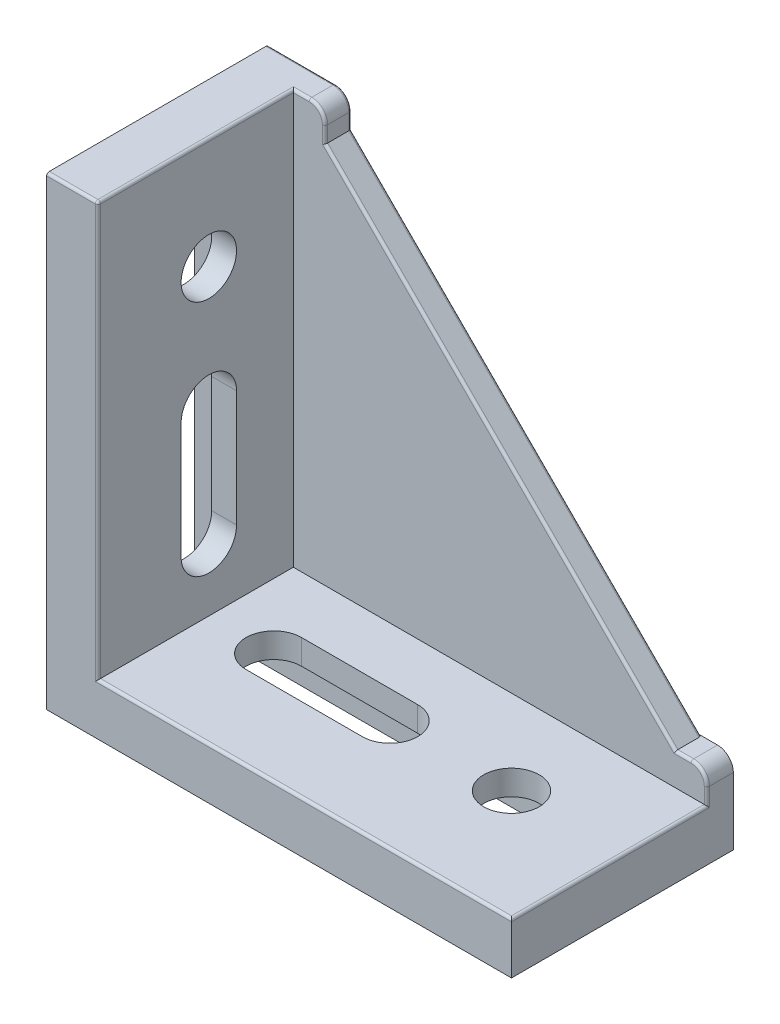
ISO-10303-21;
HEADER;
FILE_DESCRIPTION(('STEP AP214'),'2;1');
FILE_NAME('part.step','',(''),(''),'','','');
FILE_SCHEMA(('AUTOMOTIVE_DESIGN { 1 0 10303 214 1 1 1 1 }'));
ENDSEC;
DATA;
#1=APPLICATION_CONTEXT('core data for automotive mechanical design processes');
#2=APPLICATION_PROTOCOL_DEFINITION('international standard','automotive_design',2000,#1);
#3=PRODUCT_CONTEXT('',#1,'mechanical');
#4=PRODUCT('Part','Part','',(#3));
#5=PRODUCT_RELATED_PRODUCT_CATEGORY('part','',(#4));
#6=PRODUCT_DEFINITION_FORMATION('','',#4);
#7=PRODUCT_DEFINITION_CONTEXT('part definition',#1,'design');
#8=PRODUCT_DEFINITION('design','',#6,#7);
#9=PRODUCT_DEFINITION_SHAPE('','',#8);
#10=(LENGTH_UNIT() NAMED_UNIT(*) SI_UNIT(.MILLI.,.METRE.));
#11=(NAMED_UNIT(*) PLANE_ANGLE_UNIT() SI_UNIT($,.RADIAN.));
#12=(NAMED_UNIT(*) SI_UNIT($,.STERADIAN.) SOLID_ANGLE_UNIT());
#13=UNCERTAINTY_MEASURE_WITH_UNIT(LENGTH_MEASURE(1.E-05),#10,'distance_accuracy_value','');
#14=(GEOMETRIC_REPRESENTATION_CONTEXT(3) GLOBAL_UNCERTAINTY_ASSIGNED_CONTEXT((#13)) GLOBAL_UNIT_ASSIGNED_CONTEXT((#10,
#11,#12)) REPRESENTATION_CONTEXT('',''));
#15=CARTESIAN_POINT('',(0.,0.,0.));
#16=DIRECTION('',(0.,0.,1.));
#17=DIRECTION('',(1.,0.,0.));
#18=AXIS2_PLACEMENT_3D('',#15,#16,#17);
#19=CARTESIAN_POINT('',(88.,9.7,21.));
#20=DIRECTION('',(0.,-1.,0.));
#21=DIRECTION('',(0.,0.,-1.));
#22=AXIS2_PLACEMENT_3D('',#19,#20,#21);
#23=PLANE('',#22);
#24=CARTESIAN_POINT('',(67.,9.7,0.));
#25=DIRECTION('',(0.,-1.,0.));
#26=DIRECTION('',(0.,0.,-1.));
#27=AXIS2_PLACEMENT_3D('',#24,#25,#26);
#28=CIRCLE('',#27,5.25);
#29=CARTESIAN_POINT('',(67.,9.7,-5.25));
#30=VERTEX_POINT('',#29);
#31=EDGE_CURVE('E785',#30,#30,#28,.F.);
#32=ORIENTED_EDGE('',*,*,#31,.F.);
#33=EDGE_LOOP('',(#32));
#34=FACE_BOUND('',#33,.T.);
#35=DIRECTION('',(-1.,0.,0.));
#36=VECTOR('',#35,1.);
#37=CARTESIAN_POINT('',(88.,9.7,20.5));
#38=LINE('',#37,#36);
#39=CARTESIAN_POINT('',(9.7,9.7,20.5));
#40=VERTEX_POINT('',#39);
#41=CARTESIAN_POINT('',(87.5,9.7,20.5));
#42=VERTEX_POINT('',#41);
#43=EDGE_CURVE('E1713',#40,#42,#38,.F.);
#44=ORIENTED_EDGE('',*,*,#43,.T.);
#45=DIRECTION('',(0.,0.,-1.));
#46=VECTOR('',#45,1.);
#47=CARTESIAN_POINT('',(87.5,9.7,21.));
#48=LINE('',#47,#46);
#49=CARTESIAN_POINT('',(87.5,9.7,-16.));
#50=VERTEX_POINT('',#49);
#51=EDGE_CURVE('E1716',#42,#50,#48,.T.);
#52=ORIENTED_EDGE('',*,*,#51,.T.);
#53=DIRECTION('',(-1.,0.,0.));
#54=VECTOR('',#53,1.);
#55=CARTESIAN_POINT('',(88.,9.7,-16.));
#56=LINE('',#55,#54);
#57=CARTESIAN_POINT('',(9.7,9.7,-16.));
#58=VERTEX_POINT('',#57);
#59=EDGE_CURVE('E1440',#50,#58,#56,.T.);
#60=ORIENTED_EDGE('',*,*,#59,.T.);
#61=DIRECTION('',(0.,0.,-1.));
#62=VECTOR('',#61,1.);
#63=CARTESIAN_POINT('',(9.7,9.7,21.));
#64=LINE('',#63,#62);
#65=EDGE_CURVE('E1488',#40,#58,#64,.T.);
#66=ORIENTED_EDGE('',*,*,#65,.F.);
#67=EDGE_LOOP('',(#44,#52,#60,#66));
#68=FACE_BOUND('',#67,.T.);
#69=CARTESIAN_POINT('',(44.,9.7,0.));
#70=DIRECTION('',(0.,-1.,0.));
#71=DIRECTION('',(0.,0.,-1.));
#72=AXIS2_PLACEMENT_3D('',#69,#70,#71);
#73=CIRCLE('',#72,5.25);
#74=CARTESIAN_POINT('',(44.,9.7,5.25));
#75=VERTEX_POINT('',#74);
#76=CARTESIAN_POINT('',(44.,9.7,-5.25));
#77=VERTEX_POINT('',#76);
#78=EDGE_CURVE('E778',#75,#77,#73,.F.);
#79=ORIENTED_EDGE('',*,*,#78,.F.);
#80=DIRECTION('',(1.,0.,0.));
#81=VECTOR('',#80,1.);
#82=CARTESIAN_POINT('',(88.,9.7,5.25));
#83=LINE('',#82,#81);
#84=CARTESIAN_POINT('',(22.,9.7,5.25));
#85=VERTEX_POINT('',#84);
#86=EDGE_CURVE('E759',#85,#75,#83,.T.);
#87=ORIENTED_EDGE('',*,*,#86,.F.);
#88=CARTESIAN_POINT('',(22.,9.7,0.));
#89=DIRECTION('',(0.,-1.,0.));
#90=DIRECTION('',(0.,0.,-1.));
#91=AXIS2_PLACEMENT_3D('',#88,#89,#90);
#92=CIRCLE('',#91,5.25);
#93=CARTESIAN_POINT('',(22.,9.7,-5.24999999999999));
#94=VERTEX_POINT('',#93);
#95=EDGE_CURVE('E771',#94,#85,#92,.F.);
#96=ORIENTED_EDGE('',*,*,#95,.F.);
#97=DIRECTION('',(-1.,0.,0.));
#98=VECTOR('',#97,1.);
#99=CARTESIAN_POINT('',(88.,9.7,-5.25));
#100=LINE('',#99,#98);
#101=EDGE_CURVE('E775',#77,#94,#100,.T.);
#102=ORIENTED_EDGE('',*,*,#101,.F.);
#103=EDGE_LOOP('',(#79,#87,#96,#102));
#104=FACE_BOUND('',#103,.T.);
#105=ADVANCED_FACE('F40',(#34,#68,#104),#23,.F.);
#106=CARTESIAN_POINT('',(0.,5.,0.));
#107=DIRECTION('',(0.,-1.,0.));
#108=DIRECTION('',(0.,0.,1.));
#109=AXIS2_PLACEMENT_3D('',#106,#107,#108);
#110=PLANE('',#109);
#111=CARTESIAN_POINT('',(67.,5.00000000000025,0.));
#112=DIRECTION('',(0.,1.,0.));
#113=DIRECTION('',(0.,0.,1.));
#114=AXIS2_PLACEMENT_3D('',#111,#112,#113);
#115=CIRCLE('',#114,5.25);
#116=CARTESIAN_POINT('',(67.,5.00000000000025,5.25));
#117=VERTEX_POINT('',#116);
#118=EDGE_CURVE('E781',#117,#117,#115,.T.);
#119=ORIENTED_EDGE('',*,*,#118,.T.);
#120=EDGE_LOOP('',(#119));
#121=FACE_BOUND('',#120,.T.);
#122=DIRECTION('',(1.,0.,0.));
#123=VECTOR('',#122,1.);
#124=CARTESIAN_POINT('',(80.5,5.00000000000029,7.));
#125=LINE('',#124,#123);
#126=CARTESIAN_POINT('',(7.49999999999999,5.00000000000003,7.00000000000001));
#127=VERTEX_POINT('',#126);
#128=CARTESIAN_POINT('',(80.5,5.00000000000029,7.));
#129=VERTEX_POINT('',#128);
#130=EDGE_CURVE('E1024',#127,#129,#125,.T.);
#131=ORIENTED_EDGE('',*,*,#130,.F.);
#132=DIRECTION('',(0.,0.,1.));
#133=VECTOR('',#132,1.);
#134=CARTESIAN_POINT('',(7.49999999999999,5.00000000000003,-6.99999999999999));
#135=LINE('',#134,#133);
#136=CARTESIAN_POINT('',(7.49999999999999,5.00000000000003,-6.99999999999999));
#137=VERTEX_POINT('',#136);
#138=EDGE_CURVE('E1028',#137,#127,#135,.T.);
#139=ORIENTED_EDGE('',*,*,#138,.F.);
#140=DIRECTION('',(-1.,0.,0.));
#141=VECTOR('',#140,1.);
#142=CARTESIAN_POINT('',(80.5,5.00000000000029,-7.));
#143=LINE('',#142,#141);
#144=CARTESIAN_POINT('',(80.5,5.00000000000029,-7.));
#145=VERTEX_POINT('',#144);
#146=EDGE_CURVE('E1031',#145,#137,#143,.T.);
#147=ORIENTED_EDGE('',*,*,#146,.F.);
#148=DIRECTION('',(0.,0.,-1.));
#149=VECTOR('',#148,1.);
#150=CARTESIAN_POINT('',(80.5,5.00000000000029,-7.));
#151=LINE('',#150,#149);
#152=EDGE_CURVE('E1034',#129,#145,#151,.T.);
#153=ORIENTED_EDGE('',*,*,#152,.F.);
#154=EDGE_LOOP('',(#131,#139,#147,#153));
#155=FACE_BOUND('',#154,.T.);
#156=DIRECTION('',(1.,0.,0.));
#157=VECTOR('',#156,1.);
#158=CARTESIAN_POINT('',(44.,5.00000000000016,5.25));
#159=LINE('',#158,#157);
#160=CARTESIAN_POINT('',(22.,5.00000000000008,5.25));
#161=VERTEX_POINT('',#160);
#162=CARTESIAN_POINT('',(44.,5.00000000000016,5.25));
#163=VERTEX_POINT('',#162);
#164=EDGE_CURVE('E743',#161,#163,#159,.T.);
#165=ORIENTED_EDGE('',*,*,#164,.T.);
#166=CARTESIAN_POINT('',(44.,5.00000000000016,0.));
#167=DIRECTION('',(0.,1.,0.));
#168=DIRECTION('',(0.,0.,1.));
#169=AXIS2_PLACEMENT_3D('',#166,#167,#168);
#170=CIRCLE('',#169,5.25);
#171=CARTESIAN_POINT('',(44.,5.00000000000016,-5.25));
#172=VERTEX_POINT('',#171);
#173=EDGE_CURVE('E727',#163,#172,#170,.T.);
#174=ORIENTED_EDGE('',*,*,#173,.T.);
#175=DIRECTION('',(-1.,0.,0.));
#176=VECTOR('',#175,1.);
#177=CARTESIAN_POINT('',(44.,5.00000000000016,-5.25));
#178=LINE('',#177,#176);
#179=CARTESIAN_POINT('',(22.,5.00000000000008,-5.24999999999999));
#180=VERTEX_POINT('',#179);
#181=EDGE_CURVE('E751',#172,#180,#178,.T.);
#182=ORIENTED_EDGE('',*,*,#181,.T.);
#183=CARTESIAN_POINT('',(22.,5.00000000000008,0.));
#184=DIRECTION('',(0.,1.,0.));
#185=DIRECTION('',(0.,0.,1.));
#186=AXIS2_PLACEMENT_3D('',#183,#184,#185);
#187=CIRCLE('',#186,5.25);
#188=EDGE_CURVE('E747',#180,#161,#187,.T.);
#189=ORIENTED_EDGE('',*,*,#188,.T.);
#190=EDGE_LOOP('',(#165,#174,#182,#189));
#191=FACE_BOUND('',#190,.T.);
#192=ADVANCED_FACE('F1897',(#121,#155,#191),#110,.T.);
#193=CARTESIAN_POINT('',(0.,0.,21.));
#194=DIRECTION('',(0.,1.,0.));
#195=DIRECTION('',(0.,0.,1.));
#196=AXIS2_PLACEMENT_3D('',#193,#194,#195);
#197=PLANE('',#196);
#198=DIRECTION('',(0.,0.,-1.));
#199=VECTOR('',#198,1.);
#200=CARTESIAN_POINT('',(80.5,2.94930746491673E-13,-7.));
#201=LINE('',#200,#199);
#202=CARTESIAN_POINT('',(80.5,2.94930746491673E-13,7.));
#203=VERTEX_POINT('',#202);
#204=CARTESIAN_POINT('',(80.5,2.94930746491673E-13,4.));
#205=VERTEX_POINT('',#204);
#206=EDGE_CURVE('E695',#203,#205,#201,.T.);
#207=ORIENTED_EDGE('',*,*,#206,.T.);
#208=DIRECTION('',(1.,0.,0.));
#209=VECTOR('',#208,1.);
#210=CARTESIAN_POINT('',(80.5,2.94930746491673E-13,4.));
#211=LINE('',#210,#209);
#212=CARTESIAN_POINT('',(82.5,0.,4.));
#213=VERTEX_POINT('',#212);
#214=EDGE_CURVE('E706',#205,#213,#211,.T.);
#215=ORIENTED_EDGE('',*,*,#214,.T.);
#216=DIRECTION('',(0.,0.,-1.));
#217=VECTOR('',#216,1.);
#218=CARTESIAN_POINT('',(82.5,3.02258218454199E-13,4.));
#219=LINE('',#218,#217);
#220=CARTESIAN_POINT('',(82.5,0.,-3.99999999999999));
#221=VERTEX_POINT('',#220);
#222=EDGE_CURVE('E704',#213,#221,#219,.T.);
#223=ORIENTED_EDGE('',*,*,#222,.T.);
#224=DIRECTION('',(-1.,0.,0.));
#225=VECTOR('',#224,1.);
#226=CARTESIAN_POINT('',(80.5,2.94930746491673E-13,-3.99999999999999));
#227=LINE('',#226,#225);
#228=CARTESIAN_POINT('',(80.5,2.94930746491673E-13,-3.99999999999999));
#229=VERTEX_POINT('',#228);
#230=EDGE_CURVE('E677',#221,#229,#227,.T.);
#231=ORIENTED_EDGE('',*,*,#230,.T.);
#232=CARTESIAN_POINT('',(80.5,2.94930746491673E-13,-7.));
#233=VERTEX_POINT('',#232);
#234=EDGE_CURVE('E687',#229,#233,#201,.T.);
#235=ORIENTED_EDGE('',*,*,#234,.T.);
#236=DIRECTION('',(-1.,0.,0.));
#237=VECTOR('',#236,1.);
#238=CARTESIAN_POINT('',(80.5,2.94930746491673E-13,-7.));
#239=LINE('',#238,#237);
#240=CARTESIAN_POINT('',(7.50000000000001,0.,-6.99999999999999));
#241=VERTEX_POINT('',#240);
#242=EDGE_CURVE('E696',#233,#241,#239,.T.);
#243=ORIENTED_EDGE('',*,*,#242,.T.);
#244=DIRECTION('',(0.,0.,1.));
#245=VECTOR('',#244,1.);
#246=CARTESIAN_POINT('',(7.50000000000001,0.,-6.99999999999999));
#247=LINE('',#246,#245);
#248=CARTESIAN_POINT('',(7.50000000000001,0.,-3.99999999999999));
#249=VERTEX_POINT('',#248);
#250=EDGE_CURVE('E1042',#241,#249,#247,.T.);
#251=ORIENTED_EDGE('',*,*,#250,.T.);
#252=DIRECTION('',(-1.,0.,0.));
#253=VECTOR('',#252,1.);
#254=CARTESIAN_POINT('',(7.49999999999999,0.,-3.99999999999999));
#255=LINE('',#254,#253);
#256=CARTESIAN_POINT('',(5.49999999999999,0.,-3.99999999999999));
#257=VERTEX_POINT('',#256);
#258=EDGE_CURVE('E723',#249,#257,#255,.T.);
#259=ORIENTED_EDGE('',*,*,#258,.T.);
#260=DIRECTION('',(0.,0.,1.));
#261=VECTOR('',#260,1.);
#262=CARTESIAN_POINT('',(5.49999999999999,0.,4.));
#263=LINE('',#262,#261);
#264=CARTESIAN_POINT('',(5.49999999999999,0.,4.));
#265=VERTEX_POINT('',#264);
#266=EDGE_CURVE('E732',#257,#265,#263,.T.);
#267=ORIENTED_EDGE('',*,*,#266,.T.);
#268=DIRECTION('',(1.,0.,0.));
#269=VECTOR('',#268,1.);
#270=CARTESIAN_POINT('',(7.49999999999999,0.,4.));
#271=LINE('',#270,#269);
#272=CARTESIAN_POINT('',(7.49999999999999,0.,4.));
#273=VERTEX_POINT('',#272);
#274=EDGE_CURVE('E728',#265,#273,#271,.T.);
#275=ORIENTED_EDGE('',*,*,#274,.T.);
#276=CARTESIAN_POINT('',(7.50000000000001,0.,7.00000000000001));
#277=VERTEX_POINT('',#276);
#278=EDGE_CURVE('E1041',#273,#277,#247,.T.);
#279=ORIENTED_EDGE('',*,*,#278,.T.);
#280=DIRECTION('',(1.,0.,0.));
#281=VECTOR('',#280,1.);
#282=CARTESIAN_POINT('',(80.5,2.94930746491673E-13,7.));
#283=LINE('',#282,#281);
#284=EDGE_CURVE('E1014',#277,#203,#283,.T.);
#285=ORIENTED_EDGE('',*,*,#284,.T.);
#286=EDGE_LOOP('',(#207,#215,#223,#231,#235,#243,#251,#259,#267,#275,#279,#285));
#287=FACE_BOUND('',#286,.T.);
#288=DIRECTION('',(0.,0.,-1.));
#289=VECTOR('',#288,1.);
#290=CARTESIAN_POINT('',(32.9,1.20536913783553E-13,-17.));
#291=LINE('',#290,#289);
#292=CARTESIAN_POINT('',(32.9,0.,-9.30000000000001));
#293=VERTEX_POINT('',#292);
#294=CARTESIAN_POINT('',(32.9,1.20536913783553E-13,-17.));
#295=VERTEX_POINT('',#294);
#296=EDGE_CURVE('E823',#293,#295,#291,.T.);
#297=ORIENTED_EDGE('',*,*,#296,.T.);
#298=DIRECTION('',(-1.,0.,0.));
#299=VECTOR('',#298,1.);
#300=CARTESIAN_POINT('',(32.9,1.20536913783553E-13,-17.));
#301=LINE('',#300,#299);
#302=CARTESIAN_POINT('',(2.9,0.,-17.));
#303=VERTEX_POINT('',#302);
#304=EDGE_CURVE('E838',#295,#303,#301,.T.);
#305=ORIENTED_EDGE('',*,*,#304,.T.);
#306=DIRECTION('',(0.,0.,1.));
#307=VECTOR('',#306,1.);
#308=CARTESIAN_POINT('',(2.9,0.,-17.));
#309=LINE('',#308,#307);
#310=CARTESIAN_POINT('',(2.9,0.,-9.30000000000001));
#311=VERTEX_POINT('',#310);
#312=EDGE_CURVE('E853',#303,#311,#309,.T.);
#313=ORIENTED_EDGE('',*,*,#312,.T.);
#314=DIRECTION('',(1.,0.,0.));
#315=VECTOR('',#314,1.);
#316=CARTESIAN_POINT('',(32.9,1.20536913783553E-13,-9.30000000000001));
#317=LINE('',#316,#315);
#318=EDGE_CURVE('E849',#311,#293,#317,.T.);
#319=ORIENTED_EDGE('',*,*,#318,.T.);
#320=EDGE_LOOP('',(#297,#305,#313,#319));
#321=FACE_BOUND('',#320,.T.);
#322=DIRECTION('',(-1.,0.,0.));
#323=VECTOR('',#322,1.);
#324=CARTESIAN_POINT('',(32.9,1.20536913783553E-13,9.30000000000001));
#325=LINE('',#324,#323);
#326=CARTESIAN_POINT('',(32.9,0.,9.30000000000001));
#327=VERTEX_POINT('',#326);
#328=CARTESIAN_POINT('',(2.9,0.,9.30000000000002));
#329=VERTEX_POINT('',#328);
#330=EDGE_CURVE('E901',#327,#329,#325,.T.);
#331=ORIENTED_EDGE('',*,*,#330,.T.);
#332=DIRECTION('',(0.,0.,1.));
#333=VECTOR('',#332,1.);
#334=CARTESIAN_POINT('',(2.9,0.,17.));
#335=LINE('',#334,#333);
#336=CARTESIAN_POINT('',(2.9,0.,17.));
#337=VERTEX_POINT('',#336);
#338=EDGE_CURVE('E916',#329,#337,#335,.T.);
#339=ORIENTED_EDGE('',*,*,#338,.T.);
#340=DIRECTION('',(1.,0.,0.));
#341=VECTOR('',#340,1.);
#342=CARTESIAN_POINT('',(32.9,1.20536913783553E-13,17.));
#343=LINE('',#342,#341);
#344=CARTESIAN_POINT('',(32.9,1.20536913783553E-13,17.));
#345=VERTEX_POINT('',#344);
#346=EDGE_CURVE('E930',#337,#345,#343,.T.);
#347=ORIENTED_EDGE('',*,*,#346,.T.);
#348=DIRECTION('',(0.,0.,-1.));
#349=VECTOR('',#348,1.);
#350=CARTESIAN_POINT('',(32.9,1.20536913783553E-13,17.));
#351=LINE('',#350,#349);
#352=EDGE_CURVE('E926',#345,#327,#351,.T.);
#353=ORIENTED_EDGE('',*,*,#352,.T.);
#354=EDGE_LOOP('',(#331,#339,#347,#353));
#355=FACE_BOUND('',#354,.T.);
#356=DIRECTION('',(1.,0.,0.));
#357=VECTOR('',#356,1.);
#358=CARTESIAN_POINT('',(84.,0.,17.5));
#359=LINE('',#358,#357);
#360=CARTESIAN_POINT('',(71.5,2.61957122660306E-13,17.5));
#361=VERTEX_POINT('',#360);
#362=CARTESIAN_POINT('',(84.,0.,17.5));
#363=VERTEX_POINT('',#362);
#364=EDGE_CURVE('E1706',#361,#363,#359,.T.);
#365=ORIENTED_EDGE('',*,*,#364,.T.);
#366=DIRECTION('',(0.,0.,-1.));
#367=VECTOR('',#366,1.);
#368=CARTESIAN_POINT('',(84.,3.07753822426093E-13,17.));
#369=LINE('',#368,#367);
#370=CARTESIAN_POINT('',(84.,3.07753822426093E-13,9.3));
#371=VERTEX_POINT('',#370);
#372=EDGE_CURVE('E992',#363,#371,#369,.T.);
#373=ORIENTED_EDGE('',*,*,#372,.T.);
#374=DIRECTION('',(-1.,0.,0.));
#375=VECTOR('',#374,1.);
#376=CARTESIAN_POINT('',(84.,3.07753822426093E-13,9.3));
#377=LINE('',#376,#375);
#378=CARTESIAN_POINT('',(71.5,2.61957122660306E-13,9.3));
#379=VERTEX_POINT('',#378);
#380=EDGE_CURVE('E1003',#371,#379,#377,.T.);
#381=ORIENTED_EDGE('',*,*,#380,.T.);
#382=DIRECTION('',(0.,0.,1.));
#383=VECTOR('',#382,1.);
#384=CARTESIAN_POINT('',(71.5,2.61957122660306E-13,17.));
#385=LINE('',#384,#383);
#386=EDGE_CURVE('E977',#379,#361,#385,.T.);
#387=ORIENTED_EDGE('',*,*,#386,.T.);
#388=EDGE_LOOP('',(#365,#373,#381,#387));
#389=FACE_BOUND('',#388,.T.);
#390=DIRECTION('',(1.,0.,0.));
#391=VECTOR('',#390,1.);
#392=CARTESIAN_POINT('',(0.,0.,-21.));
#393=LINE('',#392,#391);
#394=CARTESIAN_POINT('',(0.,0.,-21.));
#395=VERTEX_POINT('',#394);
#396=CARTESIAN_POINT('',(88.,0.,-21.));
#397=VERTEX_POINT('',#396);
#398=EDGE_CURVE('E1456',#395,#397,#393,.T.);
#399=ORIENTED_EDGE('',*,*,#398,.T.);
#400=DIRECTION('',(0.,0.,-1.));
#401=VECTOR('',#400,1.);
#402=CARTESIAN_POINT('',(88.,0.,21.));
#403=LINE('',#402,#401);
#404=CARTESIAN_POINT('',(88.,0.,21.));
#405=VERTEX_POINT('',#404);
#406=EDGE_CURVE('E1491',#405,#397,#403,.T.);
#407=ORIENTED_EDGE('',*,*,#406,.F.);
#408=DIRECTION('',(1.,0.,0.));
#409=VECTOR('',#408,1.);
#410=CARTESIAN_POINT('',(0.,0.,21.));
#411=LINE('',#410,#409);
#412=CARTESIAN_POINT('',(0.,0.,21.));
#413=VERTEX_POINT('',#412);
#414=EDGE_CURVE('E1460',#413,#405,#411,.T.);
#415=ORIENTED_EDGE('',*,*,#414,.F.);
#416=DIRECTION('',(0.,0.,-1.));
#417=VECTOR('',#416,1.);
#418=CARTESIAN_POINT('',(0.,0.,21.));
#419=LINE('',#418,#417);
#420=EDGE_CURVE('E1471',#413,#395,#419,.T.);
#421=ORIENTED_EDGE('',*,*,#420,.T.);
#422=EDGE_LOOP('',(#399,#407,#415,#421));
#423=FACE_BOUND('',#422,.T.);
#424=DIRECTION('',(-1.,0.,0.));
#425=VECTOR('',#424,1.);
#426=CARTESIAN_POINT('',(67.2,2.46203057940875E-13,9.3));
#427=LINE('',#426,#425);
#428=CARTESIAN_POINT('',(67.2,0.,9.3));
#429=VERTEX_POINT('',#428);
#430=CARTESIAN_POINT('',(37.2,1.36290978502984E-13,9.30000000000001));
#431=VERTEX_POINT('',#430);
#432=EDGE_CURVE('E940',#429,#431,#427,.T.);
#433=ORIENTED_EDGE('',*,*,#432,.T.);
#434=DIRECTION('',(0.,0.,1.));
#435=VECTOR('',#434,1.);
#436=CARTESIAN_POINT('',(37.2,1.36290978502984E-13,17.));
#437=LINE('',#436,#435);
#438=CARTESIAN_POINT('',(37.2,1.36290978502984E-13,17.));
#439=VERTEX_POINT('',#438);
#440=EDGE_CURVE('E949',#431,#439,#437,.T.);
#441=ORIENTED_EDGE('',*,*,#440,.T.);
#442=DIRECTION('',(1.,0.,0.));
#443=VECTOR('',#442,1.);
#444=CARTESIAN_POINT('',(67.2,2.46203057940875E-13,17.));
#445=LINE('',#444,#443);
#446=CARTESIAN_POINT('',(67.2,2.46203057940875E-13,17.));
#447=VERTEX_POINT('',#446);
#448=EDGE_CURVE('E966',#439,#447,#445,.T.);
#449=ORIENTED_EDGE('',*,*,#448,.T.);
#450=DIRECTION('',(0.,0.,-1.));
#451=VECTOR('',#450,1.);
#452=CARTESIAN_POINT('',(67.2,2.46203057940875E-13,17.));
#453=LINE('',#452,#451);
#454=EDGE_CURVE('E962',#447,#429,#453,.T.);
#455=ORIENTED_EDGE('',*,*,#454,.T.);
#456=EDGE_LOOP('',(#433,#441,#449,#455));
#457=FACE_BOUND('',#456,.T.);
#458=DIRECTION('',(0.,0.,-1.));
#459=VECTOR('',#458,1.);
#460=CARTESIAN_POINT('',(84.,3.07753822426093E-13,-17.));
#461=LINE('',#460,#459);
#462=CARTESIAN_POINT('',(84.,0.,-9.3));
#463=VERTEX_POINT('',#462);
#464=CARTESIAN_POINT('',(84.,3.07753822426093E-13,-17.));
#465=VERTEX_POINT('',#464);
#466=EDGE_CURVE('E864',#463,#465,#461,.T.);
#467=ORIENTED_EDGE('',*,*,#466,.T.);
#468=DIRECTION('',(-1.,0.,0.));
#469=VECTOR('',#468,1.);
#470=CARTESIAN_POINT('',(84.,3.07753822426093E-13,-17.));
#471=LINE('',#470,#469);
#472=CARTESIAN_POINT('',(71.5,2.61957122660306E-13,-17.));
#473=VERTEX_POINT('',#472);
#474=EDGE_CURVE('E873',#465,#473,#471,.T.);
#475=ORIENTED_EDGE('',*,*,#474,.T.);
#476=DIRECTION('',(0.,0.,1.));
#477=VECTOR('',#476,1.);
#478=CARTESIAN_POINT('',(71.5,2.61957122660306E-13,-17.));
#479=LINE('',#478,#477);
#480=CARTESIAN_POINT('',(71.5,2.61957122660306E-13,-9.3));
#481=VERTEX_POINT('',#480);
#482=EDGE_CURVE('E890',#473,#481,#479,.T.);
#483=ORIENTED_EDGE('',*,*,#482,.T.);
#484=DIRECTION('',(1.,0.,0.));
#485=VECTOR('',#484,1.);
#486=CARTESIAN_POINT('',(84.,3.07753822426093E-13,-9.3));
#487=LINE('',#486,#485);
#488=EDGE_CURVE('E886',#481,#463,#487,.T.);
#489=ORIENTED_EDGE('',*,*,#488,.T.);
#490=EDGE_LOOP('',(#467,#475,#483,#489));
#491=FACE_BOUND('',#490,.T.);
#492=DIRECTION('',(0.,0.,-1.));
#493=VECTOR('',#492,1.);
#494=CARTESIAN_POINT('',(67.2,2.46203057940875E-13,-17.));
#495=LINE('',#494,#493);
#496=CARTESIAN_POINT('',(67.2,0.,-9.3));
#497=VERTEX_POINT('',#496);
#498=CARTESIAN_POINT('',(67.2,2.46203057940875E-13,-17.));
#499=VERTEX_POINT('',#498);
#500=EDGE_CURVE('E789',#497,#499,#495,.T.);
#501=ORIENTED_EDGE('',*,*,#500,.T.);
#502=DIRECTION('',(-1.,0.,0.));
#503=VECTOR('',#502,1.);
#504=CARTESIAN_POINT('',(67.2,2.46203057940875E-13,-17.));
#505=LINE('',#504,#503);
#506=CARTESIAN_POINT('',(37.2,1.36290978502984E-13,-17.));
#507=VERTEX_POINT('',#506);
#508=EDGE_CURVE('E795',#499,#507,#505,.T.);
#509=ORIENTED_EDGE('',*,*,#508,.T.);
#510=DIRECTION('',(0.,0.,1.));
#511=VECTOR('',#510,1.);
#512=CARTESIAN_POINT('',(37.2,1.36290978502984E-13,-17.));
#513=LINE('',#512,#511);
#514=CARTESIAN_POINT('',(37.2,1.36290978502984E-13,-9.30000000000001));
#515=VERTEX_POINT('',#514);
#516=EDGE_CURVE('E812',#507,#515,#513,.T.);
#517=ORIENTED_EDGE('',*,*,#516,.T.);
#518=DIRECTION('',(1.,0.,0.));
#519=VECTOR('',#518,1.);
#520=CARTESIAN_POINT('',(67.2,2.46203057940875E-13,-9.3));
#521=LINE('',#520,#519);
#522=EDGE_CURVE('E808',#515,#497,#521,.T.);
#523=ORIENTED_EDGE('',*,*,#522,.T.);
#524=EDGE_LOOP('',(#501,#509,#517,#523));
#525=FACE_BOUND('',#524,.T.);
#526=ADVANCED_FACE('F700',(#287,#321,#355,#389,#423,#457,#491,#525),#197,.F.);
#527=CARTESIAN_POINT('',(0.,0.,21.));
#528=DIRECTION('',(1.,0.,0.));
#529=DIRECTION('',(0.,0.,-1.));
#530=AXIS2_PLACEMENT_3D('',#527,#528,#529);
#531=PLANE('',#530);
#532=DIRECTION('',(0.,-1.,0.));
#533=VECTOR('',#532,1.);
#534=CARTESIAN_POINT('',(0.,67.2,-17.));
#535=LINE('',#534,#533);
#536=CARTESIAN_POINT('',(0.,67.2,-17.));
#537=VERTEX_POINT('',#536);
#538=CARTESIAN_POINT('',(0.,37.2,-17.));
#539=VERTEX_POINT('',#538);
#540=EDGE_CURVE('E1172',#537,#539,#535,.T.);
#541=ORIENTED_EDGE('',*,*,#540,.F.);
#542=DIRECTION('',(0.,0.,-1.));
#543=VECTOR('',#542,1.);
#544=CARTESIAN_POINT('',(0.,67.2,-17.));
#545=LINE('',#544,#543);
#546=CARTESIAN_POINT('',(0.,67.2,-9.3));
#547=VERTEX_POINT('',#546);
#548=EDGE_CURVE('E1151',#547,#537,#545,.T.);
#549=ORIENTED_EDGE('',*,*,#548,.F.);
#550=DIRECTION('',(0.,1.,0.));
#551=VECTOR('',#550,1.);
#552=CARTESIAN_POINT('',(0.,67.2,-9.3));
#553=LINE('',#552,#551);
#554=CARTESIAN_POINT('',(0.,37.2,-9.30000000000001));
#555=VERTEX_POINT('',#554);
#556=EDGE_CURVE('E1157',#555,#547,#553,.T.);
#557=ORIENTED_EDGE('',*,*,#556,.F.);
#558=DIRECTION('',(0.,0.,1.));
#559=VECTOR('',#558,1.);
#560=CARTESIAN_POINT('',(0.,37.2,-17.));
#561=LINE('',#560,#559);
#562=EDGE_CURVE('E1176',#539,#555,#561,.T.);
#563=ORIENTED_EDGE('',*,*,#562,.F.);
#564=EDGE_LOOP('',(#541,#549,#557,#563));
#565=FACE_BOUND('',#564,.T.);
#566=DIRECTION('',(0.,-1.,0.));
#567=VECTOR('',#566,1.);
#568=CARTESIAN_POINT('',(0.,32.9,-17.));
#569=LINE('',#568,#567);
#570=CARTESIAN_POINT('',(0.,32.9,-17.));
#571=VERTEX_POINT('',#570);
#572=CARTESIAN_POINT('',(0.,2.9,-17.));
#573=VERTEX_POINT('',#572);
#574=EDGE_CURVE('E1211',#571,#573,#569,.T.);
#575=ORIENTED_EDGE('',*,*,#574,.F.);
#576=DIRECTION('',(0.,0.,-1.));
#577=VECTOR('',#576,1.);
#578=CARTESIAN_POINT('',(0.,32.9,-17.));
#579=LINE('',#578,#577);
#580=CARTESIAN_POINT('',(0.,32.9,-9.30000000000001));
#581=VERTEX_POINT('',#580);
#582=EDGE_CURVE('E1186',#581,#571,#579,.T.);
#583=ORIENTED_EDGE('',*,*,#582,.F.);
#584=DIRECTION('',(0.,1.,0.));
#585=VECTOR('',#584,1.);
#586=CARTESIAN_POINT('',(0.,32.9,-9.30000000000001));
#587=LINE('',#586,#585);
#588=CARTESIAN_POINT('',(0.,2.9,-9.30000000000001));
#589=VERTEX_POINT('',#588);
#590=EDGE_CURVE('E1201',#589,#581,#587,.T.);
#591=ORIENTED_EDGE('',*,*,#590,.F.);
#592=DIRECTION('',(0.,0.,1.));
#593=VECTOR('',#592,1.);
#594=CARTESIAN_POINT('',(0.,2.9,-17.));
#595=LINE('',#594,#593);
#596=EDGE_CURVE('E1214',#573,#589,#595,.T.);
#597=ORIENTED_EDGE('',*,*,#596,.F.);
#598=EDGE_LOOP('',(#575,#583,#591,#597));
#599=FACE_BOUND('',#598,.T.);
#600=DIRECTION('',(0.,-1.,0.));
#601=VECTOR('',#600,1.);
#602=CARTESIAN_POINT('',(0.,84.,-17.));
#603=LINE('',#602,#601);
#604=CARTESIAN_POINT('',(0.,84.,-17.));
#605=VERTEX_POINT('',#604);
#606=CARTESIAN_POINT('',(0.,71.5,-17.));
#607=VERTEX_POINT('',#606);
#608=EDGE_CURVE('E1248',#605,#607,#603,.T.);
#609=ORIENTED_EDGE('',*,*,#608,.F.);
#610=DIRECTION('',(0.,0.,-1.));
#611=VECTOR('',#610,1.);
#612=CARTESIAN_POINT('',(0.,84.,-17.));
#613=LINE('',#612,#611);
#614=CARTESIAN_POINT('',(0.,84.,-9.3));
#615=VERTEX_POINT('',#614);
#616=EDGE_CURVE('E1224',#615,#605,#613,.T.);
#617=ORIENTED_EDGE('',*,*,#616,.F.);
#618=DIRECTION('',(0.,1.,0.));
#619=VECTOR('',#618,1.);
#620=CARTESIAN_POINT('',(0.,84.,-9.3));
#621=LINE('',#620,#619);
#622=CARTESIAN_POINT('',(0.,71.5,-9.3));
#623=VERTEX_POINT('',#622);
#624=EDGE_CURVE('E1233',#623,#615,#621,.T.);
#625=ORIENTED_EDGE('',*,*,#624,.F.);
#626=DIRECTION('',(0.,0.,1.));
#627=VECTOR('',#626,1.);
#628=CARTESIAN_POINT('',(0.,71.5,-17.));
#629=LINE('',#628,#627);
#630=EDGE_CURVE('E1252',#607,#623,#629,.T.);
#631=ORIENTED_EDGE('',*,*,#630,.F.);
#632=EDGE_LOOP('',(#609,#617,#625,#631));
#633=FACE_BOUND('',#632,.T.);
#634=DIRECTION('',(0.,0.,1.));
#635=VECTOR('',#634,1.);
#636=CARTESIAN_POINT('',(0.,2.9,17.));
#637=LINE('',#636,#635);
#638=CARTESIAN_POINT('',(0.,2.9,9.30000000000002));
#639=VERTEX_POINT('',#638);
#640=CARTESIAN_POINT('',(0.,2.9,17.));
#641=VERTEX_POINT('',#640);
#642=EDGE_CURVE('E1287',#639,#641,#637,.T.);
#643=ORIENTED_EDGE('',*,*,#642,.F.);
#644=DIRECTION('',(0.,-1.,0.));
#645=VECTOR('',#644,1.);
#646=CARTESIAN_POINT('',(0.,32.9,9.30000000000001));
#647=LINE('',#646,#645);
#648=CARTESIAN_POINT('',(0.,32.9,9.30000000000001));
#649=VERTEX_POINT('',#648);
#650=EDGE_CURVE('E1262',#649,#639,#647,.T.);
#651=ORIENTED_EDGE('',*,*,#650,.F.);
#652=DIRECTION('',(0.,0.,-1.));
#653=VECTOR('',#652,1.);
#654=CARTESIAN_POINT('',(0.,32.9,17.));
#655=LINE('',#654,#653);
#656=CARTESIAN_POINT('',(0.,32.9,17.));
#657=VERTEX_POINT('',#656);
#658=EDGE_CURVE('E1277',#657,#649,#655,.T.);
#659=ORIENTED_EDGE('',*,*,#658,.F.);
#660=DIRECTION('',(0.,1.,0.));
#661=VECTOR('',#660,1.);
#662=CARTESIAN_POINT('',(0.,32.9,17.));
#663=LINE('',#662,#661);
#664=EDGE_CURVE('E1291',#641,#657,#663,.T.);
#665=ORIENTED_EDGE('',*,*,#664,.F.);
#666=EDGE_LOOP('',(#643,#651,#659,#665));
#667=FACE_BOUND('',#666,.T.);
#668=DIRECTION('',(0.,0.,1.));
#669=VECTOR('',#668,1.);
#670=CARTESIAN_POINT('',(0.,37.2,17.));
#671=LINE('',#670,#669);
#672=CARTESIAN_POINT('',(0.,37.2,9.30000000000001));
#673=VERTEX_POINT('',#672);
#674=CARTESIAN_POINT('',(0.,37.2,17.));
#675=VERTEX_POINT('',#674);
#676=EDGE_CURVE('E1324',#673,#675,#671,.T.);
#677=ORIENTED_EDGE('',*,*,#676,.F.);
#678=DIRECTION('',(0.,-1.,0.));
#679=VECTOR('',#678,1.);
#680=CARTESIAN_POINT('',(0.,67.2,9.3));
#681=LINE('',#680,#679);
#682=CARTESIAN_POINT('',(0.,67.2,9.3));
#683=VERTEX_POINT('',#682);
#684=EDGE_CURVE('E1301',#683,#673,#681,.T.);
#685=ORIENTED_EDGE('',*,*,#684,.F.);
#686=DIRECTION('',(0.,0.,-1.));
#687=VECTOR('',#686,1.);
#688=CARTESIAN_POINT('',(0.,67.2,17.));
#689=LINE('',#688,#687);
#690=CARTESIAN_POINT('',(0.,67.2,17.));
#691=VERTEX_POINT('',#690);
#692=EDGE_CURVE('E1309',#691,#683,#689,.T.);
#693=ORIENTED_EDGE('',*,*,#692,.F.);
#694=DIRECTION('',(0.,1.,0.));
#695=VECTOR('',#694,1.);
#696=CARTESIAN_POINT('',(0.,67.2,17.));
#697=LINE('',#696,#695);
#698=EDGE_CURVE('E1328',#675,#691,#697,.T.);
#699=ORIENTED_EDGE('',*,*,#698,.F.);
#700=EDGE_LOOP('',(#677,#685,#693,#699));
#701=FACE_BOUND('',#700,.T.);
#702=DIRECTION('',(0.,0.,-1.));
#703=VECTOR('',#702,1.);
#704=CARTESIAN_POINT('',(0.,84.,17.));
#705=LINE('',#704,#703);
#706=CARTESIAN_POINT('',(0.,84.,17.));
#707=VERTEX_POINT('',#706);
#708=CARTESIAN_POINT('',(0.,84.,9.3));
#709=VERTEX_POINT('',#708);
#710=EDGE_CURVE('E1368',#707,#709,#705,.T.);
#711=ORIENTED_EDGE('',*,*,#710,.F.);
#712=DIRECTION('',(0.,1.,0.));
#713=VECTOR('',#712,1.);
#714=CARTESIAN_POINT('',(0.,84.,17.));
#715=LINE('',#714,#713);
#716=CARTESIAN_POINT('',(0.,71.5,17.));
#717=VERTEX_POINT('',#716);
#718=EDGE_CURVE('E1338',#717,#707,#715,.T.);
#719=ORIENTED_EDGE('',*,*,#718,.F.);
#720=DIRECTION('',(0.,0.,1.));
#721=VECTOR('',#720,1.);
#722=CARTESIAN_POINT('',(0.,71.5,17.));
#723=LINE('',#722,#721);
#724=CARTESIAN_POINT('',(0.,71.5,9.3));
#725=VERTEX_POINT('',#724);
#726=EDGE_CURVE('E1353',#725,#717,#723,.T.);
#727=ORIENTED_EDGE('',*,*,#726,.F.);
#728=DIRECTION('',(0.,-1.,0.));
#729=VECTOR('',#728,1.);
#730=CARTESIAN_POINT('',(0.,84.,9.3));
#731=LINE('',#730,#729);
#732=EDGE_CURVE('E1372',#709,#725,#731,.T.);
#733=ORIENTED_EDGE('',*,*,#732,.F.);
#734=EDGE_LOOP('',(#711,#719,#727,#733));
#735=FACE_BOUND('',#734,.T.);
#736=DIRECTION('',(0.,0.,-1.));
#737=VECTOR('',#736,1.);
#738=CARTESIAN_POINT('',(0.,88.,21.));
#739=LINE('',#738,#737);
#740=CARTESIAN_POINT('',(0.,88.,20.5));
#741=VERTEX_POINT('',#740);
#742=CARTESIAN_POINT('',(0.,88.,-20.5));
#743=VERTEX_POINT('',#742);
#744=EDGE_CURVE('E1484',#741,#743,#739,.T.);
#745=ORIENTED_EDGE('',*,*,#744,.T.);
#746=CARTESIAN_POINT('',(0.,87.5,-20.5));
#747=DIRECTION('',(1.,0.,0.));
#748=DIRECTION('',(0.,0.,-1.));
#749=AXIS2_PLACEMENT_3D('',#746,#747,#748);
#750=CIRCLE('',#749,0.5);
#751=CARTESIAN_POINT('',(0.,87.5,-21.));
#752=VERTEX_POINT('',#751);
#753=EDGE_CURVE('E1722',#743,#752,#750,.F.);
#754=ORIENTED_EDGE('',*,*,#753,.T.);
#755=DIRECTION('',(0.,-1.,0.));
#756=VECTOR('',#755,1.);
#757=CARTESIAN_POINT('',(0.,0.,-21.));
#758=LINE('',#757,#756);
#759=EDGE_CURVE('E1465',#752,#395,#758,.T.);
#760=ORIENTED_EDGE('',*,*,#759,.T.);
#761=ORIENTED_EDGE('',*,*,#420,.F.);
#762=DIRECTION('',(0.,-1.,0.));
#763=VECTOR('',#762,1.);
#764=CARTESIAN_POINT('',(0.,0.,21.));
#765=LINE('',#764,#763);
#766=CARTESIAN_POINT('',(0.,87.5,21.));
#767=VERTEX_POINT('',#766);
#768=EDGE_CURVE('E1468',#767,#413,#765,.T.);
#769=ORIENTED_EDGE('',*,*,#768,.F.);
#770=CARTESIAN_POINT('',(0.,87.5,20.5));
#771=DIRECTION('',(1.,0.,0.));
#772=DIRECTION('',(0.,0.,-1.));
#773=AXIS2_PLACEMENT_3D('',#770,#771,#772);
#774=CIRCLE('',#773,0.5);
#775=EDGE_CURVE('E1719',#767,#741,#774,.F.);
#776=ORIENTED_EDGE('',*,*,#775,.T.);
#777=EDGE_LOOP('',(#745,#754,#760,#761,#769,#776));
#778=FACE_BOUND('',#777,.T.);
#779=DIRECTION('',(0.,1.,0.));
#780=VECTOR('',#779,1.);
#781=CARTESIAN_POINT('',(0.,80.5,4.));
#782=LINE('',#781,#780);
#783=CARTESIAN_POINT('',(0.,80.5,4.));
#784=VERTEX_POINT('',#783);
#785=CARTESIAN_POINT('',(0.,82.5,4.));
#786=VERTEX_POINT('',#785);
#787=EDGE_CURVE('E1053',#784,#786,#782,.T.);
#788=ORIENTED_EDGE('',*,*,#787,.F.);
#789=DIRECTION('',(0.,0.,-1.));
#790=VECTOR('',#789,1.);
#791=CARTESIAN_POINT('',(0.,80.5,-7.));
#792=LINE('',#791,#790);
#793=CARTESIAN_POINT('',(0.,80.5,7.));
#794=VERTEX_POINT('',#793);
#795=EDGE_CURVE('E1413',#794,#784,#792,.T.);
#796=ORIENTED_EDGE('',*,*,#795,.F.);
#797=DIRECTION('',(0.,1.,0.));
#798=VECTOR('',#797,1.);
#799=CARTESIAN_POINT('',(0.,80.5,7.));
#800=LINE('',#799,#798);
#801=CARTESIAN_POINT('',(0.,7.50000000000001,7.00000000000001));
#802=VERTEX_POINT('',#801);
#803=EDGE_CURVE('E1382',#802,#794,#800,.T.);
#804=ORIENTED_EDGE('',*,*,#803,.F.);
#805=DIRECTION('',(0.,0.,1.));
#806=VECTOR('',#805,1.);
#807=CARTESIAN_POINT('',(0.,7.50000000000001,-6.99999999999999));
#808=LINE('',#807,#806);
#809=CARTESIAN_POINT('',(0.,7.50000000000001,4.));
#810=VERTEX_POINT('',#809);
#811=EDGE_CURVE('E1421',#810,#802,#808,.T.);
#812=ORIENTED_EDGE('',*,*,#811,.F.);
#813=DIRECTION('',(0.,1.,0.));
#814=VECTOR('',#813,1.);
#815=CARTESIAN_POINT('',(0.,7.49999999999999,4.));
#816=LINE('',#815,#814);
#817=CARTESIAN_POINT('',(0.,5.49999999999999,4.));
#818=VERTEX_POINT('',#817);
#819=EDGE_CURVE('E1086',#818,#810,#816,.T.);
#820=ORIENTED_EDGE('',*,*,#819,.F.);
#821=DIRECTION('',(0.,0.,1.));
#822=VECTOR('',#821,1.);
#823=CARTESIAN_POINT('',(0.,5.49999999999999,4.));
#824=LINE('',#823,#822);
#825=CARTESIAN_POINT('',(0.,5.49999999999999,-3.99999999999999));
#826=VERTEX_POINT('',#825);
#827=EDGE_CURVE('E1094',#826,#818,#824,.T.);
#828=ORIENTED_EDGE('',*,*,#827,.F.);
#829=DIRECTION('',(0.,-1.,0.));
#830=VECTOR('',#829,1.);
#831=CARTESIAN_POINT('',(0.,7.49999999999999,-3.99999999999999));
#832=LINE('',#831,#830);
#833=CARTESIAN_POINT('',(0.,7.49999999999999,-3.99999999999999));
#834=VERTEX_POINT('',#833);
#835=EDGE_CURVE('E1071',#834,#826,#832,.T.);
#836=ORIENTED_EDGE('',*,*,#835,.F.);
#837=CARTESIAN_POINT('',(0.,7.50000000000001,-6.99999999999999));
#838=VERTEX_POINT('',#837);
#839=EDGE_CURVE('E1397',#838,#834,#808,.T.);
#840=ORIENTED_EDGE('',*,*,#839,.F.);
#841=DIRECTION('',(0.,-1.,0.));
#842=VECTOR('',#841,1.);
#843=CARTESIAN_POINT('',(0.,80.5,-7.));
#844=LINE('',#843,#842);
#845=CARTESIAN_POINT('',(0.,80.5,-7.));
#846=VERTEX_POINT('',#845);
#847=EDGE_CURVE('E1417',#846,#838,#844,.T.);
#848=ORIENTED_EDGE('',*,*,#847,.F.);
#849=CARTESIAN_POINT('',(0.,80.5,-3.99999999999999));
#850=VERTEX_POINT('',#849);
#851=EDGE_CURVE('E1412',#850,#846,#792,.T.);
#852=ORIENTED_EDGE('',*,*,#851,.F.);
#853=DIRECTION('',(0.,-1.,0.));
#854=VECTOR('',#853,1.);
#855=CARTESIAN_POINT('',(0.,80.5,-3.99999999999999));
#856=LINE('',#855,#854);
#857=CARTESIAN_POINT('',(0.,82.5,-3.99999999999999));
#858=VERTEX_POINT('',#857);
#859=EDGE_CURVE('E1067',#858,#850,#856,.T.);
#860=ORIENTED_EDGE('',*,*,#859,.F.);
#861=DIRECTION('',(0.,0.,-1.));
#862=VECTOR('',#861,1.);
#863=CARTESIAN_POINT('',(0.,82.5,4.));
#864=LINE('',#863,#862);
#865=EDGE_CURVE('E1075',#786,#858,#864,.T.);
#866=ORIENTED_EDGE('',*,*,#865,.F.);
#867=EDGE_LOOP('',(#788,#796,#804,#812,#820,#828,#836,#840,#848,#852,#860,#866));
#868=FACE_BOUND('',#867,.T.);
#869=ADVANCED_FACE('F1812',(#565,#599,#633,#667,#701,#735,#778,#868),#531,.F.);
#870=CARTESIAN_POINT('',(88.,0.,21.));
#871=DIRECTION('',(-1.,0.,0.));
#872=DIRECTION('',(0.,0.,1.));
#873=AXIS2_PLACEMENT_3D('',#870,#871,#872);
#874=PLANE('',#873);
#875=DIRECTION('',(0.,0.,-1.));
#876=VECTOR('',#875,1.);
#877=CARTESIAN_POINT('',(88.,12.7,-16.));
#878=LINE('',#877,#876);
#879=CARTESIAN_POINT('',(88.,12.7,-21.));
#880=VERTEX_POINT('',#879);
#881=CARTESIAN_POINT('',(88.,12.7,-16.5));
#882=VERTEX_POINT('',#881);
#883=EDGE_CURVE('E1609',#880,#882,#878,.F.);
#884=ORIENTED_EDGE('',*,*,#883,.T.);
#885=DIRECTION('',(0.,-1.,0.));
#886=VECTOR('',#885,1.);
#887=CARTESIAN_POINT('',(88.,9.7,-16.5));
#888=LINE('',#887,#886);
#889=CARTESIAN_POINT('',(88.,9.2,-16.5));
#890=VERTEX_POINT('',#889);
#891=EDGE_CURVE('E1665',#882,#890,#888,.T.);
#892=ORIENTED_EDGE('',*,*,#891,.T.);
#893=DIRECTION('',(0.,0.,-1.));
#894=VECTOR('',#893,1.);
#895=CARTESIAN_POINT('',(88.,9.2,21.));
#896=LINE('',#895,#894);
#897=CARTESIAN_POINT('',(88.,9.2,21.));
#898=VERTEX_POINT('',#897);
#899=EDGE_CURVE('E1662',#890,#898,#896,.F.);
#900=ORIENTED_EDGE('',*,*,#899,.T.);
#901=DIRECTION('',(0.,1.,0.));
#902=VECTOR('',#901,1.);
#903=CARTESIAN_POINT('',(88.,0.,21.));
#904=LINE('',#903,#902);
#905=EDGE_CURVE('E1464',#405,#898,#904,.T.);
#906=ORIENTED_EDGE('',*,*,#905,.F.);
#907=ORIENTED_EDGE('',*,*,#406,.T.);
#908=DIRECTION('',(0.,1.,0.));
#909=VECTOR('',#908,1.);
#910=CARTESIAN_POINT('',(88.,0.,-21.));
#911=LINE('',#910,#909);
#912=EDGE_CURVE('E1475',#397,#880,#911,.T.);
#913=ORIENTED_EDGE('',*,*,#912,.T.);
#914=EDGE_LOOP('',(#884,#892,#900,#906,#907,#913));
#915=FACE_BOUND('',#914,.T.);
#916=ADVANCED_FACE('F1909',(#915),#874,.F.);
#917=CARTESIAN_POINT('',(9.7,9.7,21.));
#918=DIRECTION('',(-1.,0.,0.));
#919=DIRECTION('',(0.,0.,1.));
#920=AXIS2_PLACEMENT_3D('',#917,#918,#919);
#921=PLANE('',#920);
#922=DIRECTION('',(0.,1.,0.));
#923=VECTOR('',#922,1.);
#924=CARTESIAN_POINT('',(9.7,9.7,5.25));
#925=LINE('',#924,#923);
#926=CARTESIAN_POINT('',(9.7,22.,5.25));
#927=VERTEX_POINT('',#926);
#928=CARTESIAN_POINT('',(9.7,44.,5.25));
#929=VERTEX_POINT('',#928);
#930=EDGE_CURVE('E1135',#927,#929,#925,.T.);
#931=ORIENTED_EDGE('',*,*,#930,.T.);
#932=CARTESIAN_POINT('',(9.7,44.,0.));
#933=DIRECTION('',(-1.,0.,0.));
#934=DIRECTION('',(0.,0.,1.));
#935=AXIS2_PLACEMENT_3D('',#932,#933,#934);
#936=CIRCLE('',#935,5.25);
#937=CARTESIAN_POINT('',(9.7,44.,-5.25));
#938=VERTEX_POINT('',#937);
#939=EDGE_CURVE('E1139',#929,#938,#936,.T.);
#940=ORIENTED_EDGE('',*,*,#939,.T.);
#941=DIRECTION('',(0.,-1.,0.));
#942=VECTOR('',#941,1.);
#943=CARTESIAN_POINT('',(9.7,9.7,-5.24999999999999));
#944=LINE('',#943,#942);
#945=CARTESIAN_POINT('',(9.7,22.,-5.25));
#946=VERTEX_POINT('',#945);
#947=EDGE_CURVE('E1118',#938,#946,#944,.T.);
#948=ORIENTED_EDGE('',*,*,#947,.T.);
#949=CARTESIAN_POINT('',(9.7,22.,0.));
#950=DIRECTION('',(-1.,0.,0.));
#951=DIRECTION('',(0.,0.,1.));
#952=AXIS2_PLACEMENT_3D('',#949,#950,#951);
#953=CIRCLE('',#952,5.25);
#954=EDGE_CURVE('E1131',#946,#927,#953,.T.);
#955=ORIENTED_EDGE('',*,*,#954,.T.);
#956=EDGE_LOOP('',(#931,#940,#948,#955));
#957=FACE_BOUND('',#956,.T.);
#958=CARTESIAN_POINT('',(9.7,67.,0.));
#959=DIRECTION('',(-1.,0.,0.));
#960=DIRECTION('',(0.,0.,1.));
#961=AXIS2_PLACEMENT_3D('',#958,#959,#960);
#962=CIRCLE('',#961,5.25);
#963=CARTESIAN_POINT('',(9.7,67.,5.25));
#964=VERTEX_POINT('',#963);
#965=EDGE_CURVE('E1147',#964,#964,#962,.T.);
#966=ORIENTED_EDGE('',*,*,#965,.T.);
#967=EDGE_LOOP('',(#966));
#968=FACE_BOUND('',#967,.T.);
#969=DIRECTION('',(0.,1.,0.));
#970=VECTOR('',#969,1.);
#971=CARTESIAN_POINT('',(9.7,9.7,-16.));
#972=LINE('',#971,#970);
#973=CARTESIAN_POINT('',(9.7,87.5,-16.));
#974=VERTEX_POINT('',#973);
#975=EDGE_CURVE('E1444',#58,#974,#972,.T.);
#976=ORIENTED_EDGE('',*,*,#975,.T.);
#977=DIRECTION('',(0.,0.,-1.));
#978=VECTOR('',#977,1.);
#979=CARTESIAN_POINT('',(9.7,87.5,21.));
#980=LINE('',#979,#978);
#981=CARTESIAN_POINT('',(9.7,87.5,20.5));
#982=VERTEX_POINT('',#981);
#983=EDGE_CURVE('E1703',#974,#982,#980,.F.);
#984=ORIENTED_EDGE('',*,*,#983,.T.);
#985=DIRECTION('',(0.,1.,0.));
#986=VECTOR('',#985,1.);
#987=CARTESIAN_POINT('',(9.7,9.7,20.5));
#988=LINE('',#987,#986);
#989=EDGE_CURVE('E1700',#982,#40,#988,.F.);
#990=ORIENTED_EDGE('',*,*,#989,.T.);
#991=ORIENTED_EDGE('',*,*,#65,.T.);
#992=EDGE_LOOP('',(#976,#984,#990,#991));
#993=FACE_BOUND('',#992,.T.);
#994=ADVANCED_FACE('F1880',(#957,#968,#993),#921,.F.);
#995=CARTESIAN_POINT('',(9.7,88.,21.));
#996=DIRECTION('',(0.,-1.,0.));
#997=DIRECTION('',(0.,0.,-1.));
#998=AXIS2_PLACEMENT_3D('',#995,#996,#997);
#999=PLANE('',#998);
#1000=DIRECTION('',(0.,0.,-1.));
#1001=VECTOR('',#1000,1.);
#1002=CARTESIAN_POINT('',(12.7,88.,-21.));
#1003=LINE('',#1002,#1001);
#1004=CARTESIAN_POINT('',(12.7,88.,-16.5));
#1005=VERTEX_POINT('',#1004);
#1006=CARTESIAN_POINT('',(12.7,88.,-20.5));
#1007=VERTEX_POINT('',#1006);
#1008=EDGE_CURVE('E1613',#1005,#1007,#1003,.T.);
#1009=ORIENTED_EDGE('',*,*,#1008,.T.);
#1010=DIRECTION('',(-1.,0.,0.));
#1011=VECTOR('',#1010,1.);
#1012=CARTESIAN_POINT('',(9.7,88.,-20.5));
#1013=LINE('',#1012,#1011);
#1014=EDGE_CURVE('E1659',#1007,#743,#1013,.T.);
#1015=ORIENTED_EDGE('',*,*,#1014,.T.);
#1016=ORIENTED_EDGE('',*,*,#744,.F.);
#1017=DIRECTION('',(-1.,0.,0.));
#1018=VECTOR('',#1017,1.);
#1019=CARTESIAN_POINT('',(9.7,88.,20.5));
#1020=LINE('',#1019,#1018);
#1021=CARTESIAN_POINT('',(9.2,88.,20.5));
#1022=VERTEX_POINT('',#1021);
#1023=EDGE_CURVE('E1650',#741,#1022,#1020,.F.);
#1024=ORIENTED_EDGE('',*,*,#1023,.T.);
#1025=DIRECTION('',(0.,0.,-1.));
#1026=VECTOR('',#1025,1.);
#1027=CARTESIAN_POINT('',(9.2,88.,21.));
#1028=LINE('',#1027,#1026);
#1029=CARTESIAN_POINT('',(9.2,88.,-16.5));
#1030=VERTEX_POINT('',#1029);
#1031=EDGE_CURVE('E1653',#1022,#1030,#1028,.T.);
#1032=ORIENTED_EDGE('',*,*,#1031,.T.);
#1033=DIRECTION('',(1.,0.,0.));
#1034=VECTOR('',#1033,1.);
#1035=CARTESIAN_POINT('',(12.7,88.,-16.5));
#1036=LINE('',#1035,#1034);
#1037=EDGE_CURVE('E1656',#1030,#1005,#1036,.T.);
#1038=ORIENTED_EDGE('',*,*,#1037,.T.);
#1039=EDGE_LOOP('',(#1009,#1015,#1016,#1024,#1032,#1038));
#1040=FACE_BOUND('',#1039,.T.);
#1041=ADVANCED_FACE('F1808',(#1040),#999,.F.);
#1042=CARTESIAN_POINT('',(0.,0.,21.));
#1043=DIRECTION('',(0.,0.,1.));
#1044=DIRECTION('',(1.,0.,0.));
#1045=AXIS2_PLACEMENT_3D('',#1042,#1043,#1044);
#1046=PLANE('',#1045);
#1047=DIRECTION('',(0.,1.,0.));
#1048=VECTOR('',#1047,1.);
#1049=CARTESIAN_POINT('',(9.2,88.,21.));
#1050=LINE('',#1049,#1048);
#1051=CARTESIAN_POINT('',(9.2,9.2,21.));
#1052=VERTEX_POINT('',#1051);
#1053=CARTESIAN_POINT('',(9.2,87.5,21.));
#1054=VERTEX_POINT('',#1053);
#1055=EDGE_CURVE('E58',#1052,#1054,#1050,.T.);
#1056=ORIENTED_EDGE('',*,*,#1055,.T.);
#1057=DIRECTION('',(-1.,0.,0.));
#1058=VECTOR('',#1057,1.);
#1059=CARTESIAN_POINT('',(0.,87.5,21.));
#1060=LINE('',#1059,#1058);
#1061=EDGE_CURVE('E1729',#1054,#767,#1060,.T.);
#1062=ORIENTED_EDGE('',*,*,#1061,.T.);
#1063=ORIENTED_EDGE('',*,*,#768,.T.);
#1064=ORIENTED_EDGE('',*,*,#414,.T.);
#1065=ORIENTED_EDGE('',*,*,#905,.T.);
#1066=DIRECTION('',(-1.,0.,0.));
#1067=VECTOR('',#1066,1.);
#1068=CARTESIAN_POINT('',(9.7,9.2,21.));
#1069=LINE('',#1068,#1067);
#1070=EDGE_CURVE('E63',#898,#1052,#1069,.T.);
#1071=ORIENTED_EDGE('',*,*,#1070,.T.);
#1072=EDGE_LOOP('',(#1056,#1062,#1063,#1064,#1065,#1071));
#1073=FACE_BOUND('',#1072,.T.);
#1074=ADVANCED_FACE('F1859',(#1073),#1046,.T.);
#1075=CARTESIAN_POINT('',(0.,0.,-21.));
#1076=DIRECTION('',(0.,0.,1.));
#1077=DIRECTION('',(1.,0.,0.));
#1078=AXIS2_PLACEMENT_3D('',#1075,#1076,#1077);
#1079=PLANE('',#1078);
#1080=DIRECTION('',(0.707106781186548,-0.707106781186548,0.));
#1081=VECTOR('',#1080,1.);
#1082=CARTESIAN_POINT('',(81.6464466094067,15.3464466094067,-21.));
#1083=LINE('',#1082,#1081);
#1084=CARTESIAN_POINT('',(15.2,81.7928932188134,-21.));
#1085=VERTEX_POINT('',#1084);
#1086=CARTESIAN_POINT('',(81.2928932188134,15.7,-21.));
#1087=VERTEX_POINT('',#1086);
#1088=EDGE_CURVE('E1681',#1085,#1087,#1083,.T.);
#1089=ORIENTED_EDGE('',*,*,#1088,.T.);
#1090=DIRECTION('',(1.,0.,0.));
#1091=VECTOR('',#1090,1.);
#1092=CARTESIAN_POINT('',(82.,15.7,-21.));
#1093=LINE('',#1092,#1091);
#1094=CARTESIAN_POINT('',(85.,15.7,-21.));
#1095=VERTEX_POINT('',#1094);
#1096=EDGE_CURVE('E1429',#1087,#1095,#1093,.T.);
#1097=ORIENTED_EDGE('',*,*,#1096,.T.);
#1098=CARTESIAN_POINT('',(85.,12.7,-21.));
#1099=DIRECTION('',(0.,0.,1.));
#1100=DIRECTION('',(1.,0.,0.));
#1101=AXIS2_PLACEMENT_3D('',#1098,#1099,#1100);
#1102=CIRCLE('',#1101,3.);
#1103=EDGE_CURVE('E1606',#1095,#880,#1102,.F.);
#1104=ORIENTED_EDGE('',*,*,#1103,.T.);
#1105=ORIENTED_EDGE('',*,*,#912,.F.);
#1106=ORIENTED_EDGE('',*,*,#398,.F.);
#1107=ORIENTED_EDGE('',*,*,#759,.F.);
#1108=DIRECTION('',(-1.,0.,0.));
#1109=VECTOR('',#1108,1.);
#1110=CARTESIAN_POINT('',(0.,87.5,-21.));
#1111=LINE('',#1110,#1109);
#1112=CARTESIAN_POINT('',(12.7,87.5,-21.));
#1113=VERTEX_POINT('',#1112);
#1114=EDGE_CURVE('E1671',#752,#1113,#1111,.F.);
#1115=ORIENTED_EDGE('',*,*,#1114,.T.);
#1116=CARTESIAN_POINT('',(12.7,85.,-21.));
#1117=DIRECTION('',(0.,0.,1.));
#1118=DIRECTION('',(1.,0.,0.));
#1119=AXIS2_PLACEMENT_3D('',#1116,#1117,#1118);
#1120=CIRCLE('',#1119,2.5);
#1121=CARTESIAN_POINT('',(15.2,85.,-21.));
#1122=VERTEX_POINT('',#1121);
#1123=EDGE_CURVE('E1674',#1113,#1122,#1120,.F.);
#1124=ORIENTED_EDGE('',*,*,#1123,.T.);
#1125=DIRECTION('',(0.,-1.,0.));
#1126=VECTOR('',#1125,1.);
#1127=CARTESIAN_POINT('',(15.2,82.,-21.));
#1128=LINE('',#1127,#1126);
#1129=EDGE_CURVE('E1677',#1122,#1085,#1128,.T.);
#1130=ORIENTED_EDGE('',*,*,#1129,.T.);
#1131=EDGE_LOOP('',(#1089,#1097,#1104,#1105,#1106,#1107,#1115,#1124,#1130));
#1132=FACE_BOUND('',#1131,.T.);
#1133=ADVANCED_FACE('F1853',(#1132),#1079,.F.);
#1134=CARTESIAN_POINT('',(15.7,88.,-16.));
#1135=DIRECTION('',(1.,0.,0.));
#1136=DIRECTION('',(0.,0.,-1.));
#1137=AXIS2_PLACEMENT_3D('',#1134,#1135,#1136);
#1138=PLANE('',#1137);
#1139=DIRECTION('',(0.,0.,-1.));
#1140=VECTOR('',#1139,1.);
#1141=CARTESIAN_POINT('',(15.7,85.,-16.));
#1142=LINE('',#1141,#1140);
#1143=CARTESIAN_POINT('',(15.7,85.,-20.5));
#1144=VERTEX_POINT('',#1143);
#1145=CARTESIAN_POINT('',(15.7,85.,-16.5));
#1146=VERTEX_POINT('',#1145);
#1147=EDGE_CURVE('E1617',#1144,#1146,#1142,.F.);
#1148=ORIENTED_EDGE('',*,*,#1147,.T.);
#1149=DIRECTION('',(0.,-1.,0.));
#1150=VECTOR('',#1149,1.);
#1151=CARTESIAN_POINT('',(15.7,88.,-16.5));
#1152=LINE('',#1151,#1150);
#1153=CARTESIAN_POINT('',(15.7,82.,-16.5));
#1154=VERTEX_POINT('',#1153);
#1155=EDGE_CURVE('E1624',#1146,#1154,#1152,.T.);
#1156=ORIENTED_EDGE('',*,*,#1155,.T.);
#1157=DIRECTION('',(0.,0.,-1.));
#1158=VECTOR('',#1157,1.);
#1159=CARTESIAN_POINT('',(15.7,82.,-16.));
#1160=LINE('',#1159,#1158);
#1161=CARTESIAN_POINT('',(15.7,82.,-20.5));
#1162=VERTEX_POINT('',#1161);
#1163=EDGE_CURVE('E1448',#1154,#1162,#1160,.T.);
#1164=ORIENTED_EDGE('',*,*,#1163,.T.);
#1165=DIRECTION('',(0.,-1.,0.));
#1166=VECTOR('',#1165,1.);
#1167=CARTESIAN_POINT('',(15.7,85.,-20.5));
#1168=LINE('',#1167,#1166);
#1169=EDGE_CURVE('E1621',#1162,#1144,#1168,.F.);
#1170=ORIENTED_EDGE('',*,*,#1169,.T.);
#1171=EDGE_LOOP('',(#1148,#1156,#1164,#1170));
#1172=FACE_BOUND('',#1171,.T.);
#1173=ADVANCED_FACE('F1843',(#1172),#1138,.T.);
#1174=CARTESIAN_POINT('',(82.,15.7,-16.));
#1175=DIRECTION('',(0.,1.,0.));
#1176=DIRECTION('',(0.,0.,1.));
#1177=AXIS2_PLACEMENT_3D('',#1174,#1175,#1176);
#1178=PLANE('',#1177);
#1179=DIRECTION('',(0.,0.,-1.));
#1180=VECTOR('',#1179,1.);
#1181=CARTESIAN_POINT('',(82.,15.7,-16.));
#1182=LINE('',#1181,#1180);
#1183=CARTESIAN_POINT('',(82.,15.7,-16.5));
#1184=VERTEX_POINT('',#1183);
#1185=CARTESIAN_POINT('',(82.,15.7,-20.5));
#1186=VERTEX_POINT('',#1185);
#1187=EDGE_CURVE('E1452',#1184,#1186,#1182,.T.);
#1188=ORIENTED_EDGE('',*,*,#1187,.F.);
#1189=DIRECTION('',(1.,0.,0.));
#1190=VECTOR('',#1189,1.);
#1191=CARTESIAN_POINT('',(82.,15.7,-16.5));
#1192=LINE('',#1191,#1190);
#1193=CARTESIAN_POINT('',(85.,15.7,-16.5));
#1194=VERTEX_POINT('',#1193);
#1195=EDGE_CURVE('E1691',#1184,#1194,#1192,.T.);
#1196=ORIENTED_EDGE('',*,*,#1195,.T.);
#1197=DIRECTION('',(0.,0.,-1.));
#1198=VECTOR('',#1197,1.);
#1199=CARTESIAN_POINT('',(85.,15.7,-21.));
#1200=LINE('',#1199,#1198);
#1201=EDGE_CURVE('E1603',#1194,#1095,#1200,.T.);
#1202=ORIENTED_EDGE('',*,*,#1201,.T.);
#1203=ORIENTED_EDGE('',*,*,#1096,.F.);
#1204=CARTESIAN_POINT('',(81.2928932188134,15.7,-20.5));
#1205=DIRECTION('',(0.,1.,0.));
#1206=DIRECTION('',(-1.,0.,0.));
#1207=AXIS2_PLACEMENT_3D('',#1204,#1205,#1206);
#1208=ELLIPSE('',#1207,0.707106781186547,0.5);
#1209=EDGE_CURVE('E1732',#1087,#1186,#1208,.F.);
#1210=ORIENTED_EDGE('',*,*,#1209,.T.);
#1211=EDGE_LOOP('',(#1188,#1196,#1202,#1203,#1210));
#1212=FACE_BOUND('',#1211,.T.);
#1213=ADVANCED_FACE('F2200',(#1212),#1178,.T.);
#1214=CARTESIAN_POINT('',(15.7,82.,-16.));
#1215=DIRECTION('',(0.707106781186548,0.707106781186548,0.));
#1216=DIRECTION('',(-0.707106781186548,0.707106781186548,0.));
#1217=AXIS2_PLACEMENT_3D('',#1214,#1215,#1216);
#1218=PLANE('',#1217);
#1219=ORIENTED_EDGE('',*,*,#1187,.T.);
#1220=DIRECTION('',(0.707106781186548,-0.707106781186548,0.));
#1221=VECTOR('',#1220,1.);
#1222=CARTESIAN_POINT('',(15.7,82.,-20.5));
#1223=LINE('',#1222,#1221);
#1224=EDGE_CURVE('E1697',#1186,#1162,#1223,.F.);
#1225=ORIENTED_EDGE('',*,*,#1224,.T.);
#1226=ORIENTED_EDGE('',*,*,#1163,.F.);
#1227=DIRECTION('',(0.707106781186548,-0.707106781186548,0.));
#1228=VECTOR('',#1227,1.);
#1229=CARTESIAN_POINT('',(15.7,82.,-16.5));
#1230=LINE('',#1229,#1228);
#1231=EDGE_CURVE('E1694',#1154,#1184,#1230,.T.);
#1232=ORIENTED_EDGE('',*,*,#1231,.T.);
#1233=EDGE_LOOP('',(#1219,#1225,#1226,#1232));
#1234=FACE_BOUND('',#1233,.T.);
#1235=ADVANCED_FACE('F2189',(#1234),#1218,.T.);
#1236=CARTESIAN_POINT('',(0.,0.,-16.));
#1237=DIRECTION('',(0.,0.,1.));
#1238=DIRECTION('',(1.,0.,0.));
#1239=AXIS2_PLACEMENT_3D('',#1236,#1237,#1238);
#1240=PLANE('',#1239);
#1241=CARTESIAN_POINT('',(12.7,85.,-16.));
#1242=DIRECTION('',(0.,0.,1.));
#1243=DIRECTION('',(1.,0.,0.));
#1244=AXIS2_PLACEMENT_3D('',#1241,#1242,#1243);
#1245=CIRCLE('',#1244,2.5);
#1246=CARTESIAN_POINT('',(15.2,85.,-16.));
#1247=VERTEX_POINT('',#1246);
#1248=CARTESIAN_POINT('',(12.7,87.5,-16.));
#1249=VERTEX_POINT('',#1248);
#1250=EDGE_CURVE('E1644',#1247,#1249,#1245,.T.);
#1251=ORIENTED_EDGE('',*,*,#1250,.T.);
#1252=DIRECTION('',(1.,0.,0.));
#1253=VECTOR('',#1252,1.);
#1254=CARTESIAN_POINT('',(9.7,87.5,-16.));
#1255=LINE('',#1254,#1253);
#1256=EDGE_CURVE('E1647',#1249,#974,#1255,.F.);
#1257=ORIENTED_EDGE('',*,*,#1256,.T.);
#1258=ORIENTED_EDGE('',*,*,#975,.F.);
#1259=ORIENTED_EDGE('',*,*,#59,.F.);
#1260=DIRECTION('',(0.,-1.,0.));
#1261=VECTOR('',#1260,1.);
#1262=CARTESIAN_POINT('',(87.5,12.7,-16.));
#1263=LINE('',#1262,#1261);
#1264=CARTESIAN_POINT('',(87.5,12.7,-16.));
#1265=VERTEX_POINT('',#1264);
#1266=EDGE_CURVE('E1637',#50,#1265,#1263,.F.);
#1267=ORIENTED_EDGE('',*,*,#1266,.T.);
#1268=CARTESIAN_POINT('',(85.,12.7,-16.));
#1269=DIRECTION('',(0.,0.,1.));
#1270=DIRECTION('',(1.,0.,0.));
#1271=AXIS2_PLACEMENT_3D('',#1268,#1269,#1270);
#1272=CIRCLE('',#1271,2.5);
#1273=CARTESIAN_POINT('',(85.,15.2,-16.));
#1274=VERTEX_POINT('',#1273);
#1275=EDGE_CURVE('E1634',#1265,#1274,#1272,.T.);
#1276=ORIENTED_EDGE('',*,*,#1275,.T.);
#1277=DIRECTION('',(1.,0.,0.));
#1278=VECTOR('',#1277,1.);
#1279=CARTESIAN_POINT('',(0.,15.2,-16.));
#1280=LINE('',#1279,#1278);
#1281=CARTESIAN_POINT('',(81.7928932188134,15.2,-16.));
#1282=VERTEX_POINT('',#1281);
#1283=EDGE_CURVE('E1631',#1274,#1282,#1280,.F.);
#1284=ORIENTED_EDGE('',*,*,#1283,.T.);
#1285=DIRECTION('',(0.707106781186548,-0.707106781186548,0.));
#1286=VECTOR('',#1285,1.);
#1287=CARTESIAN_POINT('',(48.4964466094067,48.4964466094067,-16.));
#1288=LINE('',#1287,#1286);
#1289=CARTESIAN_POINT('',(15.2,81.7928932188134,-16.));
#1290=VERTEX_POINT('',#1289);
#1291=EDGE_CURVE('E1628',#1282,#1290,#1288,.F.);
#1292=ORIENTED_EDGE('',*,*,#1291,.T.);
#1293=DIRECTION('',(0.,-1.,0.));
#1294=VECTOR('',#1293,1.);
#1295=CARTESIAN_POINT('',(15.2,0.,-16.));
#1296=LINE('',#1295,#1294);
#1297=EDGE_CURVE('E1640',#1290,#1247,#1296,.F.);
#1298=ORIENTED_EDGE('',*,*,#1297,.T.);
#1299=EDGE_LOOP('',(#1251,#1257,#1258,#1259,#1267,#1276,#1284,#1292,#1298));
#1300=FACE_BOUND('',#1299,.T.);
#1301=ADVANCED_FACE('F1877',(#1300),#1240,.T.);
#1302=CARTESIAN_POINT('',(5.,80.5,7.));
#1303=DIRECTION('',(0.,0.,1.));
#1304=DIRECTION('',(0.,-1.,0.));
#1305=AXIS2_PLACEMENT_3D('',#1302,#1303,#1304);
#1306=PLANE('',#1305);
#1307=ORIENTED_EDGE('',*,*,#803,.T.);
#1308=DIRECTION('',(-1.,0.,0.));
#1309=VECTOR('',#1308,1.);
#1310=CARTESIAN_POINT('',(5.,80.5,7.));
#1311=LINE('',#1310,#1309);
#1312=CARTESIAN_POINT('',(5.,80.5,7.));
#1313=VERTEX_POINT('',#1312);
#1314=EDGE_CURVE('E1409',#1313,#794,#1311,.T.);
#1315=ORIENTED_EDGE('',*,*,#1314,.F.);
#1316=DIRECTION('',(0.,1.,0.));
#1317=VECTOR('',#1316,1.);
#1318=CARTESIAN_POINT('',(5.,80.5,7.));
#1319=LINE('',#1318,#1317);
#1320=CARTESIAN_POINT('',(5.,7.50000000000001,7.00000000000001));
#1321=VERTEX_POINT('',#1320);
#1322=EDGE_CURVE('E1392',#1321,#1313,#1319,.T.);
#1323=ORIENTED_EDGE('',*,*,#1322,.F.);
#1324=DIRECTION('',(-1.,0.,0.));
#1325=VECTOR('',#1324,1.);
#1326=CARTESIAN_POINT('',(5.,7.50000000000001,7.00000000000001));
#1327=LINE('',#1326,#1325);
#1328=EDGE_CURVE('E1425',#1321,#802,#1327,.T.);
#1329=ORIENTED_EDGE('',*,*,#1328,.T.);
#1330=EDGE_LOOP('',(#1307,#1315,#1323,#1329));
#1331=FACE_BOUND('',#1330,.T.);
#1332=ADVANCED_FACE('F2188',(#1331),#1306,.F.);
#1333=CARTESIAN_POINT('',(5.,7.50000000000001,-6.99999999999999));
#1334=DIRECTION('',(0.,-1.,0.));
#1335=DIRECTION('',(0.,0.,-1.));
#1336=AXIS2_PLACEMENT_3D('',#1333,#1334,#1335);
#1337=PLANE('',#1336);
#1338=ORIENTED_EDGE('',*,*,#839,.T.);
#1339=DIRECTION('',(0.93969262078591,0.,-0.342020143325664));
#1340=VECTOR('',#1339,1.);
#1341=CARTESIAN_POINT('',(-4.,7.50000000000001,-2.54411906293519));
#1342=LINE('',#1341,#1340);
#1343=CARTESIAN_POINT('',(-4.,7.5,-2.54411906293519));
#1344=VERTEX_POINT('',#1343);
#1345=EDGE_CURVE('E1532',#834,#1344,#1342,.F.);
#1346=ORIENTED_EDGE('',*,*,#1345,.T.);
#1347=DIRECTION('',(0.,0.,-1.));
#1348=VECTOR('',#1347,1.);
#1349=CARTESIAN_POINT('',(-4.,7.49999999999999,-3.99999999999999));
#1350=LINE('',#1349,#1348);
#1351=CARTESIAN_POINT('',(-4.,7.5,2.5441190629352));
#1352=VERTEX_POINT('',#1351);
#1353=EDGE_CURVE('E1081',#1352,#1344,#1350,.T.);
#1354=ORIENTED_EDGE('',*,*,#1353,.F.);
#1355=DIRECTION('',(-0.93969262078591,0.,-0.342020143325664));
#1356=VECTOR('',#1355,1.);
#1357=CARTESIAN_POINT('',(-4.,7.50000000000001,2.5441190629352));
#1358=LINE('',#1357,#1356);
#1359=EDGE_CURVE('E1529',#1352,#810,#1358,.F.);
#1360=ORIENTED_EDGE('',*,*,#1359,.T.);
#1361=ORIENTED_EDGE('',*,*,#811,.T.);
#1362=ORIENTED_EDGE('',*,*,#1328,.F.);
#1363=DIRECTION('',(0.,0.,1.));
#1364=VECTOR('',#1363,1.);
#1365=CARTESIAN_POINT('',(5.,7.50000000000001,-6.99999999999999));
#1366=LINE('',#1365,#1364);
#1367=CARTESIAN_POINT('',(5.,7.50000000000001,-6.99999999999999));
#1368=VERTEX_POINT('',#1367);
#1369=EDGE_CURVE('E1405',#1368,#1321,#1366,.T.);
#1370=ORIENTED_EDGE('',*,*,#1369,.F.);
#1371=DIRECTION('',(-1.,0.,0.));
#1372=VECTOR('',#1371,1.);
#1373=CARTESIAN_POINT('',(5.,7.50000000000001,-6.99999999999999));
#1374=LINE('',#1373,#1372);
#1375=EDGE_CURVE('E1430',#1368,#838,#1374,.T.);
#1376=ORIENTED_EDGE('',*,*,#1375,.T.);
#1377=EDGE_LOOP('',(#1338,#1346,#1354,#1360,#1361,#1362,#1370,#1376));
#1378=FACE_BOUND('',#1377,.T.);
#1379=ADVANCED_FACE('F2771',(#1378),#1337,.F.);
#1380=CARTESIAN_POINT('',(5.,80.5,-7.));
#1381=DIRECTION('',(0.,0.,-1.));
#1382=DIRECTION('',(0.,1.,0.));
#1383=AXIS2_PLACEMENT_3D('',#1380,#1381,#1382);
#1384=PLANE('',#1383);
#1385=ORIENTED_EDGE('',*,*,#847,.T.);
#1386=ORIENTED_EDGE('',*,*,#1375,.F.);
#1387=DIRECTION('',(0.,-1.,0.));
#1388=VECTOR('',#1387,1.);
#1389=CARTESIAN_POINT('',(5.,80.5,-7.));
#1390=LINE('',#1389,#1388);
#1391=CARTESIAN_POINT('',(5.,80.5,-7.));
#1392=VERTEX_POINT('',#1391);
#1393=EDGE_CURVE('E1401',#1392,#1368,#1390,.T.);
#1394=ORIENTED_EDGE('',*,*,#1393,.F.);
#1395=DIRECTION('',(-1.,0.,0.));
#1396=VECTOR('',#1395,1.);
#1397=CARTESIAN_POINT('',(5.,80.5,-7.));
#1398=LINE('',#1397,#1396);
#1399=EDGE_CURVE('E1433',#1392,#846,#1398,.T.);
#1400=ORIENTED_EDGE('',*,*,#1399,.T.);
#1401=EDGE_LOOP('',(#1385,#1386,#1394,#1400));
#1402=FACE_BOUND('',#1401,.T.);
#1403=ADVANCED_FACE('F2763',(#1402),#1384,.F.);
#1404=CARTESIAN_POINT('',(5.,80.5,-7.));
#1405=DIRECTION('',(0.,1.,0.));
#1406=DIRECTION('',(0.,0.,1.));
#1407=AXIS2_PLACEMENT_3D('',#1404,#1405,#1406);
#1408=PLANE('',#1407);
#1409=DIRECTION('',(0.,0.,1.));
#1410=VECTOR('',#1409,1.);
#1411=CARTESIAN_POINT('',(-4.,80.5,-3.99999999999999));
#1412=LINE('',#1411,#1410);
#1413=CARTESIAN_POINT('',(-4.,80.5,-2.54411906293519));
#1414=VERTEX_POINT('',#1413);
#1415=CARTESIAN_POINT('',(-4.,80.5,2.5441190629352));
#1416=VERTEX_POINT('',#1415);
#1417=EDGE_CURVE('E1066',#1414,#1416,#1412,.T.);
#1418=ORIENTED_EDGE('',*,*,#1417,.F.);
#1419=DIRECTION('',(0.93969262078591,0.,-0.342020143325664));
#1420=VECTOR('',#1419,1.);
#1421=CARTESIAN_POINT('',(-3.99999999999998,80.5,-2.5441190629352));
#1422=LINE('',#1421,#1420);
#1423=EDGE_CURVE('E1546',#1414,#850,#1422,.T.);
#1424=ORIENTED_EDGE('',*,*,#1423,.T.);
#1425=ORIENTED_EDGE('',*,*,#851,.T.);
#1426=ORIENTED_EDGE('',*,*,#1399,.F.);
#1427=DIRECTION('',(0.,0.,-1.));
#1428=VECTOR('',#1427,1.);
#1429=CARTESIAN_POINT('',(5.,80.5,-7.));
#1430=LINE('',#1429,#1428);
#1431=EDGE_CURVE('E1396',#1313,#1392,#1430,.T.);
#1432=ORIENTED_EDGE('',*,*,#1431,.F.);
#1433=ORIENTED_EDGE('',*,*,#1314,.T.);
#1434=ORIENTED_EDGE('',*,*,#795,.T.);
#1435=DIRECTION('',(-0.93969262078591,0.,-0.342020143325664));
#1436=VECTOR('',#1435,1.);
#1437=CARTESIAN_POINT('',(-4.,80.5,2.5441190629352));
#1438=LINE('',#1437,#1436);
#1439=EDGE_CURVE('E1543',#784,#1416,#1438,.T.);
#1440=ORIENTED_EDGE('',*,*,#1439,.T.);
#1441=EDGE_LOOP('',(#1418,#1424,#1425,#1426,#1432,#1433,#1434,#1440));
#1442=FACE_BOUND('',#1441,.T.);
#1443=ADVANCED_FACE('F2757',(#1442),#1408,.F.);
#1444=CARTESIAN_POINT('',(5.,0.,0.));
#1445=DIRECTION('',(-1.,0.,0.));
#1446=DIRECTION('',(0.,0.,1.));
#1447=AXIS2_PLACEMENT_3D('',#1444,#1445,#1446);
#1448=PLANE('',#1447);
#1449=CARTESIAN_POINT('',(5.,44.,0.));
#1450=DIRECTION('',(-1.,0.,0.));
#1451=DIRECTION('',(0.,0.,1.));
#1452=AXIS2_PLACEMENT_3D('',#1449,#1450,#1451);
#1453=CIRCLE('',#1452,5.25);
#1454=CARTESIAN_POINT('',(5.,44.,5.25));
#1455=VERTEX_POINT('',#1454);
#1456=CARTESIAN_POINT('',(5.,44.,-5.25));
#1457=VERTEX_POINT('',#1456);
#1458=EDGE_CURVE('E1090',#1455,#1457,#1453,.T.);
#1459=ORIENTED_EDGE('',*,*,#1458,.F.);
#1460=DIRECTION('',(0.,1.,0.));
#1461=VECTOR('',#1460,1.);
#1462=CARTESIAN_POINT('',(5.,44.,5.25));
#1463=LINE('',#1462,#1461);
#1464=CARTESIAN_POINT('',(5.,22.,5.25));
#1465=VERTEX_POINT('',#1464);
#1466=EDGE_CURVE('E1110',#1465,#1455,#1463,.T.);
#1467=ORIENTED_EDGE('',*,*,#1466,.F.);
#1468=CARTESIAN_POINT('',(5.,22.,0.));
#1469=DIRECTION('',(-1.,0.,0.));
#1470=DIRECTION('',(0.,0.,1.));
#1471=AXIS2_PLACEMENT_3D('',#1468,#1469,#1470);
#1472=CIRCLE('',#1471,5.25);
#1473=CARTESIAN_POINT('',(5.,22.,-5.24999999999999));
#1474=VERTEX_POINT('',#1473);
#1475=EDGE_CURVE('E1106',#1474,#1465,#1472,.T.);
#1476=ORIENTED_EDGE('',*,*,#1475,.F.);
#1477=DIRECTION('',(0.,-1.,0.));
#1478=VECTOR('',#1477,1.);
#1479=CARTESIAN_POINT('',(5.,44.,-5.25));
#1480=LINE('',#1479,#1478);
#1481=EDGE_CURVE('E1102',#1457,#1474,#1480,.T.);
#1482=ORIENTED_EDGE('',*,*,#1481,.F.);
#1483=EDGE_LOOP('',(#1459,#1467,#1476,#1482));
#1484=FACE_BOUND('',#1483,.T.);
#1485=CARTESIAN_POINT('',(5.,67.,0.));
#1486=DIRECTION('',(-1.,0.,0.));
#1487=DIRECTION('',(0.,0.,1.));
#1488=AXIS2_PLACEMENT_3D('',#1485,#1486,#1487);
#1489=CIRCLE('',#1488,5.25);
#1490=CARTESIAN_POINT('',(5.,67.,5.25));
#1491=VERTEX_POINT('',#1490);
#1492=EDGE_CURVE('E1143',#1491,#1491,#1489,.T.);
#1493=ORIENTED_EDGE('',*,*,#1492,.F.);
#1494=EDGE_LOOP('',(#1493));
#1495=FACE_BOUND('',#1494,.T.);
#1496=ORIENTED_EDGE('',*,*,#1322,.T.);
#1497=ORIENTED_EDGE('',*,*,#1431,.T.);
#1498=ORIENTED_EDGE('',*,*,#1393,.T.);
#1499=ORIENTED_EDGE('',*,*,#1369,.T.);
#1500=EDGE_LOOP('',(#1496,#1497,#1498,#1499));
#1501=FACE_BOUND('',#1500,.T.);
#1502=ADVANCED_FACE('F2762',(#1484,#1495,#1501),#1448,.T.);
#1503=CARTESIAN_POINT('',(5.,84.,17.));
#1504=DIRECTION('',(0.,0.,1.));
#1505=DIRECTION('',(1.,0.,0.));
#1506=AXIS2_PLACEMENT_3D('',#1503,#1504,#1505);
#1507=PLANE('',#1506);
#1508=ORIENTED_EDGE('',*,*,#718,.T.);
#1509=DIRECTION('',(-1.,0.,0.));
#1510=VECTOR('',#1509,1.);
#1511=CARTESIAN_POINT('',(5.,84.,17.));
#1512=LINE('',#1511,#1510);
#1513=CARTESIAN_POINT('',(5.,84.,17.));
#1514=VERTEX_POINT('',#1513);
#1515=EDGE_CURVE('E1365',#1514,#707,#1512,.T.);
#1516=ORIENTED_EDGE('',*,*,#1515,.F.);
#1517=DIRECTION('',(0.,1.,0.));
#1518=VECTOR('',#1517,1.);
#1519=CARTESIAN_POINT('',(5.,84.,17.));
#1520=LINE('',#1519,#1518);
#1521=CARTESIAN_POINT('',(5.,71.5,17.));
#1522=VERTEX_POINT('',#1521);
#1523=EDGE_CURVE('E1348',#1522,#1514,#1520,.T.);
#1524=ORIENTED_EDGE('',*,*,#1523,.F.);
#1525=DIRECTION('',(-1.,0.,0.));
#1526=VECTOR('',#1525,1.);
#1527=CARTESIAN_POINT('',(5.,71.5,17.));
#1528=LINE('',#1527,#1526);
#1529=EDGE_CURVE('E1379',#1522,#717,#1528,.T.);
#1530=ORIENTED_EDGE('',*,*,#1529,.T.);
#1531=EDGE_LOOP('',(#1508,#1516,#1524,#1530));
#1532=FACE_BOUND('',#1531,.T.);
#1533=ADVANCED_FACE('F2833',(#1532),#1507,.F.);
#1534=CARTESIAN_POINT('',(5.,71.5,17.));
#1535=DIRECTION('',(0.,-1.,0.));
#1536=DIRECTION('',(0.,0.,-1.));
#1537=AXIS2_PLACEMENT_3D('',#1534,#1535,#1536);
#1538=PLANE('',#1537);
#1539=ORIENTED_EDGE('',*,*,#726,.T.);
#1540=ORIENTED_EDGE('',*,*,#1529,.F.);
#1541=DIRECTION('',(0.,0.,1.));
#1542=VECTOR('',#1541,1.);
#1543=CARTESIAN_POINT('',(5.,71.5,17.));
#1544=LINE('',#1543,#1542);
#1545=CARTESIAN_POINT('',(5.,71.5,9.3));
#1546=VERTEX_POINT('',#1545);
#1547=EDGE_CURVE('E1361',#1546,#1522,#1544,.T.);
#1548=ORIENTED_EDGE('',*,*,#1547,.F.);
#1549=DIRECTION('',(-1.,0.,0.));
#1550=VECTOR('',#1549,1.);
#1551=CARTESIAN_POINT('',(5.,71.5,9.3));
#1552=LINE('',#1551,#1550);
#1553=EDGE_CURVE('E1383',#1546,#725,#1552,.T.);
#1554=ORIENTED_EDGE('',*,*,#1553,.T.);
#1555=EDGE_LOOP('',(#1539,#1540,#1548,#1554));
#1556=FACE_BOUND('',#1555,.T.);
#1557=ADVANCED_FACE('F3105',(#1556),#1538,.F.);
#1558=CARTESIAN_POINT('',(5.,84.,9.3));
#1559=DIRECTION('',(0.,0.,-1.));
#1560=DIRECTION('',(0.,1.,0.));
#1561=AXIS2_PLACEMENT_3D('',#1558,#1559,#1560);
#1562=PLANE('',#1561);
#1563=ORIENTED_EDGE('',*,*,#732,.T.);
#1564=ORIENTED_EDGE('',*,*,#1553,.F.);
#1565=DIRECTION('',(0.,-1.,0.));
#1566=VECTOR('',#1565,1.);
#1567=CARTESIAN_POINT('',(5.,84.,9.3));
#1568=LINE('',#1567,#1566);
#1569=CARTESIAN_POINT('',(5.,84.,9.3));
#1570=VERTEX_POINT('',#1569);
#1571=EDGE_CURVE('E1357',#1570,#1546,#1568,.T.);
#1572=ORIENTED_EDGE('',*,*,#1571,.F.);
#1573=DIRECTION('',(-1.,0.,0.));
#1574=VECTOR('',#1573,1.);
#1575=CARTESIAN_POINT('',(5.,84.,9.3));
#1576=LINE('',#1575,#1574);
#1577=EDGE_CURVE('E1386',#1570,#709,#1576,.T.);
#1578=ORIENTED_EDGE('',*,*,#1577,.T.);
#1579=EDGE_LOOP('',(#1563,#1564,#1572,#1578));
#1580=FACE_BOUND('',#1579,.T.);
#1581=ADVANCED_FACE('F3095',(#1580),#1562,.F.);
#1582=CARTESIAN_POINT('',(5.,84.,17.));
#1583=DIRECTION('',(0.,1.,0.));
#1584=DIRECTION('',(0.,0.,1.));
#1585=AXIS2_PLACEMENT_3D('',#1582,#1583,#1584);
#1586=PLANE('',#1585);
#1587=ORIENTED_EDGE('',*,*,#710,.T.);
#1588=ORIENTED_EDGE('',*,*,#1577,.F.);
#1589=DIRECTION('',(0.,0.,-1.));
#1590=VECTOR('',#1589,1.);
#1591=CARTESIAN_POINT('',(5.,84.,17.));
#1592=LINE('',#1591,#1590);
#1593=EDGE_CURVE('E1352',#1514,#1570,#1592,.T.);
#1594=ORIENTED_EDGE('',*,*,#1593,.F.);
#1595=ORIENTED_EDGE('',*,*,#1515,.T.);
#1596=EDGE_LOOP('',(#1587,#1588,#1594,#1595));
#1597=FACE_BOUND('',#1596,.T.);
#1598=ADVANCED_FACE('F3085',(#1597),#1586,.F.);
#1599=CARTESIAN_POINT('',(5.,0.,0.));
#1600=DIRECTION('',(1.,0.,0.));
#1601=DIRECTION('',(0.,0.,-1.));
#1602=AXIS2_PLACEMENT_3D('',#1599,#1600,#1601);
#1603=PLANE('',#1602);
#1604=ORIENTED_EDGE('',*,*,#1523,.T.);
#1605=ORIENTED_EDGE('',*,*,#1593,.T.);
#1606=ORIENTED_EDGE('',*,*,#1571,.T.);
#1607=ORIENTED_EDGE('',*,*,#1547,.T.);
#1608=EDGE_LOOP('',(#1604,#1605,#1606,#1607));
#1609=FACE_BOUND('',#1608,.T.);
#1610=ADVANCED_FACE('F3075',(#1609),#1603,.F.);
#1611=CARTESIAN_POINT('',(5.,67.2,9.3));
#1612=DIRECTION('',(0.,0.,-1.));
#1613=DIRECTION('',(0.,1.,0.));
#1614=AXIS2_PLACEMENT_3D('',#1611,#1612,#1613);
#1615=PLANE('',#1614);
#1616=ORIENTED_EDGE('',*,*,#684,.T.);
#1617=DIRECTION('',(-1.,0.,0.));
#1618=VECTOR('',#1617,1.);
#1619=CARTESIAN_POINT('',(5.,37.2,9.30000000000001));
#1620=LINE('',#1619,#1618);
#1621=CARTESIAN_POINT('',(5.,37.2,9.30000000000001));
#1622=VERTEX_POINT('',#1621);
#1623=EDGE_CURVE('E1321',#1622,#673,#1620,.T.);
#1624=ORIENTED_EDGE('',*,*,#1623,.F.);
#1625=DIRECTION('',(0.,-1.,0.));
#1626=VECTOR('',#1625,1.);
#1627=CARTESIAN_POINT('',(5.,67.2,9.3));
#1628=LINE('',#1627,#1626);
#1629=CARTESIAN_POINT('',(5.,67.2,9.3));
#1630=VERTEX_POINT('',#1629);
#1631=EDGE_CURVE('E1304',#1630,#1622,#1628,.T.);
#1632=ORIENTED_EDGE('',*,*,#1631,.F.);
#1633=DIRECTION('',(-1.,0.,0.));
#1634=VECTOR('',#1633,1.);
#1635=CARTESIAN_POINT('',(5.,67.2,9.3));
#1636=LINE('',#1635,#1634);
#1637=EDGE_CURVE('E1335',#1630,#683,#1636,.T.);
#1638=ORIENTED_EDGE('',*,*,#1637,.T.);
#1639=EDGE_LOOP('',(#1616,#1624,#1632,#1638));
#1640=FACE_BOUND('',#1639,.T.);
#1641=ADVANCED_FACE('F3065',(#1640),#1615,.F.);
#1642=CARTESIAN_POINT('',(5.,67.2,17.));
#1643=DIRECTION('',(0.,1.,0.));
#1644=DIRECTION('',(0.,0.,1.));
#1645=AXIS2_PLACEMENT_3D('',#1642,#1643,#1644);
#1646=PLANE('',#1645);
#1647=ORIENTED_EDGE('',*,*,#692,.T.);
#1648=ORIENTED_EDGE('',*,*,#1637,.F.);
#1649=DIRECTION('',(0.,0.,-1.));
#1650=VECTOR('',#1649,1.);
#1651=CARTESIAN_POINT('',(5.,67.2,17.));
#1652=LINE('',#1651,#1650);
#1653=CARTESIAN_POINT('',(5.,67.2,17.));
#1654=VERTEX_POINT('',#1653);
#1655=EDGE_CURVE('E1317',#1654,#1630,#1652,.T.);
#1656=ORIENTED_EDGE('',*,*,#1655,.F.);
#1657=DIRECTION('',(-1.,0.,0.));
#1658=VECTOR('',#1657,1.);
#1659=CARTESIAN_POINT('',(5.,67.2,17.));
#1660=LINE('',#1659,#1658);
#1661=EDGE_CURVE('E1339',#1654,#691,#1660,.T.);
#1662=ORIENTED_EDGE('',*,*,#1661,.T.);
#1663=EDGE_LOOP('',(#1647,#1648,#1656,#1662));
#1664=FACE_BOUND('',#1663,.T.);
#1665=ADVANCED_FACE('F3055',(#1664),#1646,.F.);
#1666=CARTESIAN_POINT('',(5.,67.2,17.));
#1667=DIRECTION('',(0.,0.,1.));
#1668=DIRECTION('',(0.,-1.,0.));
#1669=AXIS2_PLACEMENT_3D('',#1666,#1667,#1668);
#1670=PLANE('',#1669);
#1671=ORIENTED_EDGE('',*,*,#698,.T.);
#1672=ORIENTED_EDGE('',*,*,#1661,.F.);
#1673=DIRECTION('',(0.,1.,0.));
#1674=VECTOR('',#1673,1.);
#1675=CARTESIAN_POINT('',(5.,67.2,17.));
#1676=LINE('',#1675,#1674);
#1677=CARTESIAN_POINT('',(5.,37.2,17.));
#1678=VERTEX_POINT('',#1677);
#1679=EDGE_CURVE('E1313',#1678,#1654,#1676,.T.);
#1680=ORIENTED_EDGE('',*,*,#1679,.F.);
#1681=DIRECTION('',(-1.,0.,0.));
#1682=VECTOR('',#1681,1.);
#1683=CARTESIAN_POINT('',(5.,37.2,17.));
#1684=LINE('',#1683,#1682);
#1685=EDGE_CURVE('E1342',#1678,#675,#1684,.T.);
#1686=ORIENTED_EDGE('',*,*,#1685,.T.);
#1687=EDGE_LOOP('',(#1671,#1672,#1680,#1686));
#1688=FACE_BOUND('',#1687,.T.);
#1689=ADVANCED_FACE('F3045',(#1688),#1670,.F.);
#1690=CARTESIAN_POINT('',(5.,37.2,17.));
#1691=DIRECTION('',(0.,-1.,0.));
#1692=DIRECTION('',(0.,0.,-1.));
#1693=AXIS2_PLACEMENT_3D('',#1690,#1691,#1692);
#1694=PLANE('',#1693);
#1695=ORIENTED_EDGE('',*,*,#676,.T.);
#1696=ORIENTED_EDGE('',*,*,#1685,.F.);
#1697=DIRECTION('',(0.,0.,1.));
#1698=VECTOR('',#1697,1.);
#1699=CARTESIAN_POINT('',(5.,37.2,17.));
#1700=LINE('',#1699,#1698);
#1701=EDGE_CURVE('E1308',#1622,#1678,#1700,.T.);
#1702=ORIENTED_EDGE('',*,*,#1701,.F.);
#1703=ORIENTED_EDGE('',*,*,#1623,.T.);
#1704=EDGE_LOOP('',(#1695,#1696,#1702,#1703));
#1705=FACE_BOUND('',#1704,.T.);
#1706=ADVANCED_FACE('F3035',(#1705),#1694,.F.);
#1707=CARTESIAN_POINT('',(5.,0.,0.));
#1708=DIRECTION('',(1.,0.,0.));
#1709=DIRECTION('',(0.,0.,-1.));
#1710=AXIS2_PLACEMENT_3D('',#1707,#1708,#1709);
#1711=PLANE('',#1710);
#1712=ORIENTED_EDGE('',*,*,#1631,.T.);
#1713=ORIENTED_EDGE('',*,*,#1701,.T.);
#1714=ORIENTED_EDGE('',*,*,#1679,.T.);
#1715=ORIENTED_EDGE('',*,*,#1655,.T.);
#1716=EDGE_LOOP('',(#1712,#1713,#1714,#1715));
#1717=FACE_BOUND('',#1716,.T.);
#1718=ADVANCED_FACE('F2920',(#1717),#1711,.F.);
#1719=CARTESIAN_POINT('',(5.,32.9,9.30000000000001));
#1720=DIRECTION('',(0.,0.,-1.));
#1721=DIRECTION('',(0.,1.,0.));
#1722=AXIS2_PLACEMENT_3D('',#1719,#1720,#1721);
#1723=PLANE('',#1722);
#1724=ORIENTED_EDGE('',*,*,#650,.T.);
#1725=DIRECTION('',(-0.707106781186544,-0.707106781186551,0.));
#1726=VECTOR('',#1725,1.);
#1727=CARTESIAN_POINT('',(5.,7.90000000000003,9.30000000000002));
#1728=LINE('',#1727,#1726);
#1729=CARTESIAN_POINT('',(5.,7.90000000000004,9.30000000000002));
#1730=VERTEX_POINT('',#1729);
#1731=EDGE_CURVE('E1512',#639,#1730,#1728,.F.);
#1732=ORIENTED_EDGE('',*,*,#1731,.T.);
#1733=DIRECTION('',(0.,-1.,0.));
#1734=VECTOR('',#1733,1.);
#1735=CARTESIAN_POINT('',(5.,32.9,9.30000000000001));
#1736=LINE('',#1735,#1734);
#1737=CARTESIAN_POINT('',(5.,32.9,9.30000000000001));
#1738=VERTEX_POINT('',#1737);
#1739=EDGE_CURVE('E1272',#1738,#1730,#1736,.T.);
#1740=ORIENTED_EDGE('',*,*,#1739,.F.);
#1741=DIRECTION('',(-1.,0.,0.));
#1742=VECTOR('',#1741,1.);
#1743=CARTESIAN_POINT('',(5.,32.9,9.30000000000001));
#1744=LINE('',#1743,#1742);
#1745=EDGE_CURVE('E1298',#1738,#649,#1744,.T.);
#1746=ORIENTED_EDGE('',*,*,#1745,.T.);
#1747=EDGE_LOOP('',(#1724,#1732,#1740,#1746));
#1748=FACE_BOUND('',#1747,.T.);
#1749=ADVANCED_FACE('F2914',(#1748),#1723,.F.);
#1750=CARTESIAN_POINT('',(5.,32.9,17.));
#1751=DIRECTION('',(0.,1.,0.));
#1752=DIRECTION('',(0.,0.,1.));
#1753=AXIS2_PLACEMENT_3D('',#1750,#1751,#1752);
#1754=PLANE('',#1753);
#1755=ORIENTED_EDGE('',*,*,#658,.T.);
#1756=ORIENTED_EDGE('',*,*,#1745,.F.);
#1757=DIRECTION('',(0.,0.,-1.));
#1758=VECTOR('',#1757,1.);
#1759=CARTESIAN_POINT('',(5.,32.9,17.));
#1760=LINE('',#1759,#1758);
#1761=CARTESIAN_POINT('',(5.,32.9,17.));
#1762=VERTEX_POINT('',#1761);
#1763=EDGE_CURVE('E1280',#1762,#1738,#1760,.T.);
#1764=ORIENTED_EDGE('',*,*,#1763,.F.);
#1765=DIRECTION('',(-1.,0.,0.));
#1766=VECTOR('',#1765,1.);
#1767=CARTESIAN_POINT('',(5.,32.9,17.));
#1768=LINE('',#1767,#1766);
#1769=EDGE_CURVE('E1284',#1762,#657,#1768,.T.);
#1770=ORIENTED_EDGE('',*,*,#1769,.T.);
#1771=EDGE_LOOP('',(#1755,#1756,#1764,#1770));
#1772=FACE_BOUND('',#1771,.T.);
#1773=ADVANCED_FACE('F2907',(#1772),#1754,.F.);
#1774=CARTESIAN_POINT('',(5.,32.9,17.));
#1775=DIRECTION('',(0.,0.,1.));
#1776=DIRECTION('',(0.,-1.,0.));
#1777=AXIS2_PLACEMENT_3D('',#1774,#1775,#1776);
#1778=PLANE('',#1777);
#1779=DIRECTION('',(0.,1.,0.));
#1780=VECTOR('',#1779,1.);
#1781=CARTESIAN_POINT('',(5.,32.9,17.));
#1782=LINE('',#1781,#1780);
#1783=CARTESIAN_POINT('',(5.,7.90000000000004,17.));
#1784=VERTEX_POINT('',#1783);
#1785=EDGE_CURVE('E1276',#1784,#1762,#1782,.T.);
#1786=ORIENTED_EDGE('',*,*,#1785,.F.);
#1787=DIRECTION('',(0.707106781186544,0.707106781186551,0.));
#1788=VECTOR('',#1787,1.);
#1789=CARTESIAN_POINT('',(5.,7.90000000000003,17.));
#1790=LINE('',#1789,#1788);
#1791=EDGE_CURVE('E1509',#1784,#641,#1790,.F.);
#1792=ORIENTED_EDGE('',*,*,#1791,.T.);
#1793=ORIENTED_EDGE('',*,*,#664,.T.);
#1794=ORIENTED_EDGE('',*,*,#1769,.F.);
#1795=EDGE_LOOP('',(#1786,#1792,#1793,#1794));
#1796=FACE_BOUND('',#1795,.T.);
#1797=ADVANCED_FACE('F2895',(#1796),#1778,.F.);
#1798=CARTESIAN_POINT('',(5.,0.,0.));
#1799=DIRECTION('',(1.,0.,0.));
#1800=DIRECTION('',(0.,0.,-1.));
#1801=AXIS2_PLACEMENT_3D('',#1798,#1799,#1800);
#1802=PLANE('',#1801);
#1803=ORIENTED_EDGE('',*,*,#1739,.T.);
#1804=DIRECTION('',(0.,0.,1.));
#1805=VECTOR('',#1804,1.);
#1806=CARTESIAN_POINT('',(5.,7.90000000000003,17.));
#1807=LINE('',#1806,#1805);
#1808=EDGE_CURVE('E1505',#1730,#1784,#1807,.T.);
#1809=ORIENTED_EDGE('',*,*,#1808,.T.);
#1810=ORIENTED_EDGE('',*,*,#1785,.T.);
#1811=ORIENTED_EDGE('',*,*,#1763,.T.);
#1812=EDGE_LOOP('',(#1803,#1809,#1810,#1811));
#1813=FACE_BOUND('',#1812,.T.);
#1814=ADVANCED_FACE('F2888',(#1813),#1802,.F.);
#1815=CARTESIAN_POINT('',(5.,84.,-17.));
#1816=DIRECTION('',(0.,1.,0.));
#1817=DIRECTION('',(0.,0.,1.));
#1818=AXIS2_PLACEMENT_3D('',#1815,#1816,#1817);
#1819=PLANE('',#1818);
#1820=ORIENTED_EDGE('',*,*,#616,.T.);
#1821=DIRECTION('',(-1.,0.,0.));
#1822=VECTOR('',#1821,1.);
#1823=CARTESIAN_POINT('',(5.,84.,-17.));
#1824=LINE('',#1823,#1822);
#1825=CARTESIAN_POINT('',(5.,84.,-17.));
#1826=VERTEX_POINT('',#1825);
#1827=EDGE_CURVE('E1245',#1826,#605,#1824,.T.);
#1828=ORIENTED_EDGE('',*,*,#1827,.F.);
#1829=DIRECTION('',(0.,0.,-1.));
#1830=VECTOR('',#1829,1.);
#1831=CARTESIAN_POINT('',(5.,84.,-17.));
#1832=LINE('',#1831,#1830);
#1833=CARTESIAN_POINT('',(5.,84.,-9.3));
#1834=VERTEX_POINT('',#1833);
#1835=EDGE_CURVE('E1228',#1834,#1826,#1832,.T.);
#1836=ORIENTED_EDGE('',*,*,#1835,.F.);
#1837=DIRECTION('',(-1.,0.,0.));
#1838=VECTOR('',#1837,1.);
#1839=CARTESIAN_POINT('',(5.,84.,-9.3));
#1840=LINE('',#1839,#1838);
#1841=EDGE_CURVE('E1259',#1834,#615,#1840,.T.);
#1842=ORIENTED_EDGE('',*,*,#1841,.T.);
#1843=EDGE_LOOP('',(#1820,#1828,#1836,#1842));
#1844=FACE_BOUND('',#1843,.T.);
#1845=ADVANCED_FACE('F2894',(#1844),#1819,.F.);
#1846=CARTESIAN_POINT('',(5.,84.,-9.3));
#1847=DIRECTION('',(0.,0.,1.));
#1848=DIRECTION('',(0.,-1.,0.));
#1849=AXIS2_PLACEMENT_3D('',#1846,#1847,#1848);
#1850=PLANE('',#1849);
#1851=ORIENTED_EDGE('',*,*,#624,.T.);
#1852=ORIENTED_EDGE('',*,*,#1841,.F.);
#1853=DIRECTION('',(0.,1.,0.));
#1854=VECTOR('',#1853,1.);
#1855=CARTESIAN_POINT('',(5.,84.,-9.3));
#1856=LINE('',#1855,#1854);
#1857=CARTESIAN_POINT('',(5.,71.5,-9.3));
#1858=VERTEX_POINT('',#1857);
#1859=EDGE_CURVE('E1241',#1858,#1834,#1856,.T.);
#1860=ORIENTED_EDGE('',*,*,#1859,.F.);
#1861=DIRECTION('',(-1.,0.,0.));
#1862=VECTOR('',#1861,1.);
#1863=CARTESIAN_POINT('',(5.,71.5,-9.3));
#1864=LINE('',#1863,#1862);
#1865=EDGE_CURVE('E1263',#1858,#623,#1864,.T.);
#1866=ORIENTED_EDGE('',*,*,#1865,.T.);
#1867=EDGE_LOOP('',(#1851,#1852,#1860,#1866));
#1868=FACE_BOUND('',#1867,.T.);
#1869=ADVANCED_FACE('F3004',(#1868),#1850,.F.);
#1870=CARTESIAN_POINT('',(5.,71.5,-17.));
#1871=DIRECTION('',(0.,-1.,0.));
#1872=DIRECTION('',(0.,0.,-1.));
#1873=AXIS2_PLACEMENT_3D('',#1870,#1871,#1872);
#1874=PLANE('',#1873);
#1875=ORIENTED_EDGE('',*,*,#630,.T.);
#1876=ORIENTED_EDGE('',*,*,#1865,.F.);
#1877=DIRECTION('',(0.,0.,1.));
#1878=VECTOR('',#1877,1.);
#1879=CARTESIAN_POINT('',(5.,71.5,-17.));
#1880=LINE('',#1879,#1878);
#1881=CARTESIAN_POINT('',(5.,71.5,-17.));
#1882=VERTEX_POINT('',#1881);
#1883=EDGE_CURVE('E1237',#1882,#1858,#1880,.T.);
#1884=ORIENTED_EDGE('',*,*,#1883,.F.);
#1885=DIRECTION('',(-1.,0.,0.));
#1886=VECTOR('',#1885,1.);
#1887=CARTESIAN_POINT('',(5.,71.5,-17.));
#1888=LINE('',#1887,#1886);
#1889=EDGE_CURVE('E1266',#1882,#607,#1888,.T.);
#1890=ORIENTED_EDGE('',*,*,#1889,.T.);
#1891=EDGE_LOOP('',(#1875,#1876,#1884,#1890));
#1892=FACE_BOUND('',#1891,.T.);
#1893=ADVANCED_FACE('F2994',(#1892),#1874,.F.);
#1894=CARTESIAN_POINT('',(5.,84.,-17.));
#1895=DIRECTION('',(0.,0.,-1.));
#1896=DIRECTION('',(-1.,0.,0.));
#1897=AXIS2_PLACEMENT_3D('',#1894,#1895,#1896);
#1898=PLANE('',#1897);
#1899=ORIENTED_EDGE('',*,*,#608,.T.);
#1900=ORIENTED_EDGE('',*,*,#1889,.F.);
#1901=DIRECTION('',(0.,-1.,0.));
#1902=VECTOR('',#1901,1.);
#1903=CARTESIAN_POINT('',(5.,84.,-17.));
#1904=LINE('',#1903,#1902);
#1905=EDGE_CURVE('E1232',#1826,#1882,#1904,.T.);
#1906=ORIENTED_EDGE('',*,*,#1905,.F.);
#1907=ORIENTED_EDGE('',*,*,#1827,.T.);
#1908=EDGE_LOOP('',(#1899,#1900,#1906,#1907));
#1909=FACE_BOUND('',#1908,.T.);
#1910=ADVANCED_FACE('F2984',(#1909),#1898,.F.);
#1911=CARTESIAN_POINT('',(5.,0.,0.));
#1912=DIRECTION('',(1.,0.,0.));
#1913=DIRECTION('',(0.,0.,-1.));
#1914=AXIS2_PLACEMENT_3D('',#1911,#1912,#1913);
#1915=PLANE('',#1914);
#1916=ORIENTED_EDGE('',*,*,#1835,.T.);
#1917=ORIENTED_EDGE('',*,*,#1905,.T.);
#1918=ORIENTED_EDGE('',*,*,#1883,.T.);
#1919=ORIENTED_EDGE('',*,*,#1859,.T.);
#1920=EDGE_LOOP('',(#1916,#1917,#1918,#1919));
#1921=FACE_BOUND('',#1920,.T.);
#1922=ADVANCED_FACE('F2974',(#1921),#1915,.F.);
#1923=CARTESIAN_POINT('',(5.,32.9,-17.));
#1924=DIRECTION('',(0.,1.,0.));
#1925=DIRECTION('',(0.,0.,1.));
#1926=AXIS2_PLACEMENT_3D('',#1923,#1924,#1925);
#1927=PLANE('',#1926);
#1928=ORIENTED_EDGE('',*,*,#582,.T.);
#1929=DIRECTION('',(-1.,0.,0.));
#1930=VECTOR('',#1929,1.);
#1931=CARTESIAN_POINT('',(5.,32.9,-17.));
#1932=LINE('',#1931,#1930);
#1933=CARTESIAN_POINT('',(5.,32.9,-17.));
#1934=VERTEX_POINT('',#1933);
#1935=EDGE_CURVE('E1208',#1934,#571,#1932,.T.);
#1936=ORIENTED_EDGE('',*,*,#1935,.F.);
#1937=DIRECTION('',(0.,0.,-1.));
#1938=VECTOR('',#1937,1.);
#1939=CARTESIAN_POINT('',(5.,32.9,-17.));
#1940=LINE('',#1939,#1938);
#1941=CARTESIAN_POINT('',(5.,32.9,-9.30000000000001));
#1942=VERTEX_POINT('',#1941);
#1943=EDGE_CURVE('E1196',#1942,#1934,#1940,.T.);
#1944=ORIENTED_EDGE('',*,*,#1943,.F.);
#1945=DIRECTION('',(-1.,0.,0.));
#1946=VECTOR('',#1945,1.);
#1947=CARTESIAN_POINT('',(5.,32.9,-9.30000000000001));
#1948=LINE('',#1947,#1946);
#1949=EDGE_CURVE('E1221',#1942,#581,#1948,.T.);
#1950=ORIENTED_EDGE('',*,*,#1949,.T.);
#1951=EDGE_LOOP('',(#1928,#1936,#1944,#1950));
#1952=FACE_BOUND('',#1951,.T.);
#1953=ADVANCED_FACE('F2881',(#1952),#1927,.F.);
#1954=CARTESIAN_POINT('',(5.,32.9,-9.30000000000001));
#1955=DIRECTION('',(0.,0.,1.));
#1956=DIRECTION('',(0.,-1.,0.));
#1957=AXIS2_PLACEMENT_3D('',#1954,#1955,#1956);
#1958=PLANE('',#1957);
#1959=DIRECTION('',(0.,1.,0.));
#1960=VECTOR('',#1959,1.);
#1961=CARTESIAN_POINT('',(5.,32.9,-9.30000000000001));
#1962=LINE('',#1961,#1960);
#1963=CARTESIAN_POINT('',(5.,7.90000000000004,-9.30000000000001));
#1964=VERTEX_POINT('',#1963);
#1965=EDGE_CURVE('E1205',#1964,#1942,#1962,.T.);
#1966=ORIENTED_EDGE('',*,*,#1965,.F.);
#1967=DIRECTION('',(0.707106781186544,0.707106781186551,0.));
#1968=VECTOR('',#1967,1.);
#1969=CARTESIAN_POINT('',(5.,7.90000000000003,-9.30000000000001));
#1970=LINE('',#1969,#1968);
#1971=EDGE_CURVE('E1499',#1964,#589,#1970,.F.);
#1972=ORIENTED_EDGE('',*,*,#1971,.T.);
#1973=ORIENTED_EDGE('',*,*,#590,.T.);
#1974=ORIENTED_EDGE('',*,*,#1949,.F.);
#1975=EDGE_LOOP('',(#1966,#1972,#1973,#1974));
#1976=FACE_BOUND('',#1975,.T.);
#1977=ADVANCED_FACE('F2871',(#1976),#1958,.F.);
#1978=CARTESIAN_POINT('',(5.,32.9,-17.));
#1979=DIRECTION('',(0.,0.,-1.));
#1980=DIRECTION('',(-1.,0.,0.));
#1981=AXIS2_PLACEMENT_3D('',#1978,#1979,#1980);
#1982=PLANE('',#1981);
#1983=ORIENTED_EDGE('',*,*,#574,.T.);
#1984=DIRECTION('',(-0.707106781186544,-0.707106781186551,0.));
#1985=VECTOR('',#1984,1.);
#1986=CARTESIAN_POINT('',(5.,7.90000000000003,-17.));
#1987=LINE('',#1986,#1985);
#1988=CARTESIAN_POINT('',(5.,7.90000000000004,-17.));
#1989=VERTEX_POINT('',#1988);
#1990=EDGE_CURVE('E1502',#573,#1989,#1987,.F.);
#1991=ORIENTED_EDGE('',*,*,#1990,.T.);
#1992=DIRECTION('',(0.,-1.,0.));
#1993=VECTOR('',#1992,1.);
#1994=CARTESIAN_POINT('',(5.,32.9,-17.));
#1995=LINE('',#1994,#1993);
#1996=EDGE_CURVE('E1200',#1934,#1989,#1995,.T.);
#1997=ORIENTED_EDGE('',*,*,#1996,.F.);
#1998=ORIENTED_EDGE('',*,*,#1935,.T.);
#1999=EDGE_LOOP('',(#1983,#1991,#1997,#1998));
#2000=FACE_BOUND('',#1999,.T.);
#2001=ADVANCED_FACE('F2859',(#2000),#1982,.F.);
#2002=CARTESIAN_POINT('',(5.,0.,0.));
#2003=DIRECTION('',(1.,0.,0.));
#2004=DIRECTION('',(0.,0.,-1.));
#2005=AXIS2_PLACEMENT_3D('',#2002,#2003,#2004);
#2006=PLANE('',#2005);
#2007=ORIENTED_EDGE('',*,*,#1996,.T.);
#2008=DIRECTION('',(0.,0.,1.));
#2009=VECTOR('',#2008,1.);
#2010=CARTESIAN_POINT('',(5.,7.90000000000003,-9.30000000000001));
#2011=LINE('',#2010,#2009);
#2012=EDGE_CURVE('E1495',#1989,#1964,#2011,.T.);
#2013=ORIENTED_EDGE('',*,*,#2012,.T.);
#2014=ORIENTED_EDGE('',*,*,#1965,.T.);
#2015=ORIENTED_EDGE('',*,*,#1943,.T.);
#2016=EDGE_LOOP('',(#2007,#2013,#2014,#2015));
#2017=FACE_BOUND('',#2016,.T.);
#2018=ADVANCED_FACE('F2852',(#2017),#2006,.F.);
#2019=CARTESIAN_POINT('',(5.,67.2,-17.));
#2020=DIRECTION('',(0.,1.,0.));
#2021=DIRECTION('',(0.,0.,1.));
#2022=AXIS2_PLACEMENT_3D('',#2019,#2020,#2021);
#2023=PLANE('',#2022);
#2024=ORIENTED_EDGE('',*,*,#548,.T.);
#2025=DIRECTION('',(-1.,0.,0.));
#2026=VECTOR('',#2025,1.);
#2027=CARTESIAN_POINT('',(5.,67.2,-17.));
#2028=LINE('',#2027,#2026);
#2029=CARTESIAN_POINT('',(5.,67.2,-17.));
#2030=VERTEX_POINT('',#2029);
#2031=EDGE_CURVE('E1169',#2030,#537,#2028,.T.);
#2032=ORIENTED_EDGE('',*,*,#2031,.F.);
#2033=DIRECTION('',(0.,0.,-1.));
#2034=VECTOR('',#2033,1.);
#2035=CARTESIAN_POINT('',(5.,67.2,-17.));
#2036=LINE('',#2035,#2034);
#2037=CARTESIAN_POINT('',(5.,67.2,-9.3));
#2038=VERTEX_POINT('',#2037);
#2039=EDGE_CURVE('E1152',#2038,#2030,#2036,.T.);
#2040=ORIENTED_EDGE('',*,*,#2039,.F.);
#2041=DIRECTION('',(-1.,0.,0.));
#2042=VECTOR('',#2041,1.);
#2043=CARTESIAN_POINT('',(5.,67.2,-9.3));
#2044=LINE('',#2043,#2042);
#2045=EDGE_CURVE('E1183',#2038,#547,#2044,.T.);
#2046=ORIENTED_EDGE('',*,*,#2045,.T.);
#2047=EDGE_LOOP('',(#2024,#2032,#2040,#2046));
#2048=FACE_BOUND('',#2047,.T.);
#2049=ADVANCED_FACE('F2858',(#2048),#2023,.F.);
#2050=CARTESIAN_POINT('',(5.,67.2,-9.3));
#2051=DIRECTION('',(0.,0.,1.));
#2052=DIRECTION('',(0.,-1.,0.));
#2053=AXIS2_PLACEMENT_3D('',#2050,#2051,#2052);
#2054=PLANE('',#2053);
#2055=ORIENTED_EDGE('',*,*,#556,.T.);
#2056=ORIENTED_EDGE('',*,*,#2045,.F.);
#2057=DIRECTION('',(0.,1.,0.));
#2058=VECTOR('',#2057,1.);
#2059=CARTESIAN_POINT('',(5.,67.2,-9.3));
#2060=LINE('',#2059,#2058);
#2061=CARTESIAN_POINT('',(5.,37.2,-9.30000000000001));
#2062=VERTEX_POINT('',#2061);
#2063=EDGE_CURVE('E1165',#2062,#2038,#2060,.T.);
#2064=ORIENTED_EDGE('',*,*,#2063,.F.);
#2065=DIRECTION('',(-1.,0.,0.));
#2066=VECTOR('',#2065,1.);
#2067=CARTESIAN_POINT('',(5.,37.2,-9.30000000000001));
#2068=LINE('',#2067,#2066);
#2069=EDGE_CURVE('E1187',#2062,#555,#2068,.T.);
#2070=ORIENTED_EDGE('',*,*,#2069,.T.);
#2071=EDGE_LOOP('',(#2055,#2056,#2064,#2070));
#2072=FACE_BOUND('',#2071,.T.);
#2073=ADVANCED_FACE('F2950',(#2072),#2054,.F.);
#2074=CARTESIAN_POINT('',(5.,37.2,-17.));
#2075=DIRECTION('',(0.,-1.,0.));
#2076=DIRECTION('',(0.,0.,-1.));
#2077=AXIS2_PLACEMENT_3D('',#2074,#2075,#2076);
#2078=PLANE('',#2077);
#2079=ORIENTED_EDGE('',*,*,#562,.T.);
#2080=ORIENTED_EDGE('',*,*,#2069,.F.);
#2081=DIRECTION('',(0.,0.,1.));
#2082=VECTOR('',#2081,1.);
#2083=CARTESIAN_POINT('',(5.,37.2,-17.));
#2084=LINE('',#2083,#2082);
#2085=CARTESIAN_POINT('',(5.,37.2,-17.));
#2086=VERTEX_POINT('',#2085);
#2087=EDGE_CURVE('E1161',#2086,#2062,#2084,.T.);
#2088=ORIENTED_EDGE('',*,*,#2087,.F.);
#2089=DIRECTION('',(-1.,0.,0.));
#2090=VECTOR('',#2089,1.);
#2091=CARTESIAN_POINT('',(5.,37.2,-17.));
#2092=LINE('',#2091,#2090);
#2093=EDGE_CURVE('E1190',#2086,#539,#2092,.T.);
#2094=ORIENTED_EDGE('',*,*,#2093,.T.);
#2095=EDGE_LOOP('',(#2079,#2080,#2088,#2094));
#2096=FACE_BOUND('',#2095,.T.);
#2097=ADVANCED_FACE('F2940',(#2096),#2078,.F.);
#2098=CARTESIAN_POINT('',(5.,67.2,-17.));
#2099=DIRECTION('',(0.,0.,-1.));
#2100=DIRECTION('',(-1.,0.,0.));
#2101=AXIS2_PLACEMENT_3D('',#2098,#2099,#2100);
#2102=PLANE('',#2101);
#2103=ORIENTED_EDGE('',*,*,#540,.T.);
#2104=ORIENTED_EDGE('',*,*,#2093,.F.);
#2105=DIRECTION('',(0.,-1.,0.));
#2106=VECTOR('',#2105,1.);
#2107=CARTESIAN_POINT('',(5.,67.2,-17.));
#2108=LINE('',#2107,#2106);
#2109=EDGE_CURVE('E1156',#2030,#2086,#2108,.T.);
#2110=ORIENTED_EDGE('',*,*,#2109,.F.);
#2111=ORIENTED_EDGE('',*,*,#2031,.T.);
#2112=EDGE_LOOP('',(#2103,#2104,#2110,#2111));
#2113=FACE_BOUND('',#2112,.T.);
#2114=ADVANCED_FACE('F2930',(#2113),#2102,.F.);
#2115=CARTESIAN_POINT('',(5.,0.,0.));
#2116=DIRECTION('',(1.,0.,0.));
#2117=DIRECTION('',(0.,0.,-1.));
#2118=AXIS2_PLACEMENT_3D('',#2115,#2116,#2117);
#2119=PLANE('',#2118);
#2120=ORIENTED_EDGE('',*,*,#2039,.T.);
#2121=ORIENTED_EDGE('',*,*,#2109,.T.);
#2122=ORIENTED_EDGE('',*,*,#2087,.T.);
#2123=ORIENTED_EDGE('',*,*,#2063,.T.);
#2124=EDGE_LOOP('',(#2120,#2121,#2122,#2123));
#2125=FACE_BOUND('',#2124,.T.);
#2126=ADVANCED_FACE('F1918',(#2125),#2119,.F.);
#2127=CARTESIAN_POINT('',(5.,7.90000000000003,0.));
#2128=DIRECTION('',(-0.707106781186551,0.707106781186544,0.));
#2129=DIRECTION('',(0.,0.,-1.));
#2130=AXIS2_PLACEMENT_3D('',#2127,#2128,#2129);
#2131=PLANE('',#2130);
#2132=ORIENTED_EDGE('',*,*,#1990,.F.);
#2133=ORIENTED_EDGE('',*,*,#596,.T.);
#2134=ORIENTED_EDGE('',*,*,#1971,.F.);
#2135=ORIENTED_EDGE('',*,*,#2012,.F.);
#2136=EDGE_LOOP('',(#2132,#2133,#2134,#2135));
#2137=FACE_BOUND('',#2136,.T.);
#2138=ADVANCED_FACE('F1914',(#2137),#2131,.T.);
#2139=CARTESIAN_POINT('',(5.,7.90000000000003,0.));
#2140=DIRECTION('',(-0.707106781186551,0.707106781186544,0.));
#2141=DIRECTION('',(0.,0.,-1.));
#2142=AXIS2_PLACEMENT_3D('',#2139,#2140,#2141);
#2143=PLANE('',#2142);
#2144=ORIENTED_EDGE('',*,*,#1731,.F.);
#2145=ORIENTED_EDGE('',*,*,#642,.T.);
#2146=ORIENTED_EDGE('',*,*,#1791,.F.);
#2147=ORIENTED_EDGE('',*,*,#1808,.F.);
#2148=EDGE_LOOP('',(#2144,#2145,#2146,#2147));
#2149=FACE_BOUND('',#2148,.T.);
#2150=ADVANCED_FACE('F1917',(#2149),#2143,.T.);
#2151=CARTESIAN_POINT('',(10.,67.,0.));
#2152=DIRECTION('',(-1.,0.,0.));
#2153=DIRECTION('',(0.,0.,1.));
#2154=AXIS2_PLACEMENT_3D('',#2151,#2152,#2153);
#2155=CYLINDRICAL_SURFACE('',#2154,5.25);
#2156=ORIENTED_EDGE('',*,*,#1492,.T.);
#2157=EDGE_LOOP('',(#2156));
#2158=FACE_BOUND('',#2157,.T.);
#2159=ORIENTED_EDGE('',*,*,#965,.F.);
#2160=EDGE_LOOP('',(#2159));
#2161=FACE_BOUND('',#2160,.T.);
#2162=ADVANCED_FACE('F1922',(#2158,#2161),#2155,.F.);
#2163=CARTESIAN_POINT('',(10.,44.,0.));
#2164=DIRECTION('',(-1.,0.,0.));
#2165=DIRECTION('',(0.,0.,1.));
#2166=AXIS2_PLACEMENT_3D('',#2163,#2164,#2165);
#2167=CYLINDRICAL_SURFACE('',#2166,5.25);
#2168=DIRECTION('',(-1.,0.,0.));
#2169=VECTOR('',#2168,1.);
#2170=CARTESIAN_POINT('',(10.,44.,5.25));
#2171=LINE('',#2170,#2169);
#2172=EDGE_CURVE('E1115',#929,#1455,#2171,.T.);
#2173=ORIENTED_EDGE('',*,*,#2172,.T.);
#2174=ORIENTED_EDGE('',*,*,#1458,.T.);
#2175=DIRECTION('',(-1.,0.,0.));
#2176=VECTOR('',#2175,1.);
#2177=CARTESIAN_POINT('',(10.,44.,-5.25));
#2178=LINE('',#2177,#2176);
#2179=EDGE_CURVE('E1114',#938,#1457,#2178,.T.);
#2180=ORIENTED_EDGE('',*,*,#2179,.F.);
#2181=ORIENTED_EDGE('',*,*,#939,.F.);
#2182=EDGE_LOOP('',(#2173,#2174,#2180,#2181));
#2183=FACE_BOUND('',#2182,.T.);
#2184=ADVANCED_FACE('F2804',(#2183),#2167,.F.);
#2185=CARTESIAN_POINT('',(10.,44.,5.25));
#2186=DIRECTION('',(0.,0.,1.));
#2187=DIRECTION('',(0.,-1.,0.));
#2188=AXIS2_PLACEMENT_3D('',#2185,#2186,#2187);
#2189=PLANE('',#2188);
#2190=DIRECTION('',(-1.,0.,0.));
#2191=VECTOR('',#2190,1.);
#2192=CARTESIAN_POINT('',(10.,22.,5.25));
#2193=LINE('',#2192,#2191);
#2194=EDGE_CURVE('E1119',#927,#1465,#2193,.T.);
#2195=ORIENTED_EDGE('',*,*,#2194,.T.);
#2196=ORIENTED_EDGE('',*,*,#1466,.T.);
#2197=ORIENTED_EDGE('',*,*,#2172,.F.);
#2198=ORIENTED_EDGE('',*,*,#930,.F.);
#2199=EDGE_LOOP('',(#2195,#2196,#2197,#2198));
#2200=FACE_BOUND('',#2199,.T.);
#2201=ADVANCED_FACE('F2794',(#2200),#2189,.F.);
#2202=CARTESIAN_POINT('',(10.,22.,0.));
#2203=DIRECTION('',(-1.,0.,0.));
#2204=DIRECTION('',(0.,0.,1.));
#2205=AXIS2_PLACEMENT_3D('',#2202,#2203,#2204);
#2206=CYLINDRICAL_SURFACE('',#2205,5.25);
#2207=DIRECTION('',(-1.,0.,0.));
#2208=VECTOR('',#2207,1.);
#2209=CARTESIAN_POINT('',(10.,22.,-5.24999999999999));
#2210=LINE('',#2209,#2208);
#2211=EDGE_CURVE('E1122',#946,#1474,#2210,.T.);
#2212=ORIENTED_EDGE('',*,*,#2211,.T.);
#2213=ORIENTED_EDGE('',*,*,#1475,.T.);
#2214=ORIENTED_EDGE('',*,*,#2194,.F.);
#2215=ORIENTED_EDGE('',*,*,#954,.F.);
#2216=EDGE_LOOP('',(#2212,#2213,#2214,#2215));
#2217=FACE_BOUND('',#2216,.T.);
#2218=ADVANCED_FACE('F2784',(#2217),#2206,.F.);
#2219=CARTESIAN_POINT('',(10.,44.,-5.25));
#2220=DIRECTION('',(0.,0.,-1.));
#2221=DIRECTION('',(0.,1.,0.));
#2222=AXIS2_PLACEMENT_3D('',#2219,#2220,#2221);
#2223=PLANE('',#2222);
#2224=ORIENTED_EDGE('',*,*,#2179,.T.);
#2225=ORIENTED_EDGE('',*,*,#1481,.T.);
#2226=ORIENTED_EDGE('',*,*,#2211,.F.);
#2227=ORIENTED_EDGE('',*,*,#947,.F.);
#2228=EDGE_LOOP('',(#2224,#2225,#2226,#2227));
#2229=FACE_BOUND('',#2228,.T.);
#2230=ADVANCED_FACE('F2750',(#2229),#2223,.F.);
#2231=CARTESIAN_POINT('',(-4.,5.49999999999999,4.));
#2232=DIRECTION('',(0.,1.,0.));
#2233=DIRECTION('',(0.,0.,1.));
#2234=AXIS2_PLACEMENT_3D('',#2231,#2232,#2233);
#2235=PLANE('',#2234);
#2236=DIRECTION('',(0.,0.,1.));
#2237=VECTOR('',#2236,1.);
#2238=CARTESIAN_POINT('',(-4.,5.49999999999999,4.));
#2239=LINE('',#2238,#2237);
#2240=CARTESIAN_POINT('',(-4.,5.49999999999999,-2.54411906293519));
#2241=VERTEX_POINT('',#2240);
#2242=CARTESIAN_POINT('',(-4.,5.49999999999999,2.5441190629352));
#2243=VERTEX_POINT('',#2242);
#2244=EDGE_CURVE('E1085',#2241,#2243,#2239,.T.);
#2245=ORIENTED_EDGE('',*,*,#2244,.F.);
#2246=DIRECTION('',(-0.93969262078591,0.,0.342020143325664));
#2247=VECTOR('',#2246,1.);
#2248=CARTESIAN_POINT('',(-4.,5.49999999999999,-2.54411906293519));
#2249=LINE('',#2248,#2247);
#2250=EDGE_CURVE('E1526',#2241,#826,#2249,.F.);
#2251=ORIENTED_EDGE('',*,*,#2250,.T.);
#2252=ORIENTED_EDGE('',*,*,#827,.T.);
#2253=DIRECTION('',(0.93969262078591,0.,0.342020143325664));
#2254=VECTOR('',#2253,1.);
#2255=CARTESIAN_POINT('',(-4.,5.49999999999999,2.5441190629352));
#2256=LINE('',#2255,#2254);
#2257=EDGE_CURVE('E1523',#818,#2243,#2256,.F.);
#2258=ORIENTED_EDGE('',*,*,#2257,.T.);
#2259=EDGE_LOOP('',(#2245,#2251,#2252,#2258));
#2260=FACE_BOUND('',#2259,.T.);
#2261=ADVANCED_FACE('F2740',(#2260),#2235,.F.);
#2262=CARTESIAN_POINT('',(-4.,0.,0.));
#2263=DIRECTION('',(1.,0.,0.));
#2264=DIRECTION('',(0.,0.,-1.));
#2265=AXIS2_PLACEMENT_3D('',#2262,#2263,#2264);
#2266=PLANE('',#2265);
#2267=ORIENTED_EDGE('',*,*,#1353,.T.);
#2268=DIRECTION('',(0.,-1.,0.));
#2269=VECTOR('',#2268,1.);
#2270=CARTESIAN_POINT('',(-4.,0.,-2.54411906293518));
#2271=LINE('',#2270,#2269);
#2272=EDGE_CURVE('E1519',#1344,#2241,#2271,.T.);
#2273=ORIENTED_EDGE('',*,*,#2272,.T.);
#2274=ORIENTED_EDGE('',*,*,#2244,.T.);
#2275=DIRECTION('',(0.,1.,0.));
#2276=VECTOR('',#2275,1.);
#2277=CARTESIAN_POINT('',(-4.,0.,2.5441190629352));
#2278=LINE('',#2277,#2276);
#2279=EDGE_CURVE('E1515',#2243,#1352,#2278,.T.);
#2280=ORIENTED_EDGE('',*,*,#2279,.T.);
#2281=EDGE_LOOP('',(#2267,#2273,#2274,#2280));
#2282=FACE_BOUND('',#2281,.T.);
#2283=ADVANCED_FACE('F2730',(#2282),#2266,.F.);
#2284=CARTESIAN_POINT('',(-4.,82.5,4.));
#2285=DIRECTION('',(0.,-1.,0.));
#2286=DIRECTION('',(0.,0.,-1.));
#2287=AXIS2_PLACEMENT_3D('',#2284,#2285,#2286);
#2288=PLANE('',#2287);
#2289=ORIENTED_EDGE('',*,*,#865,.T.);
#2290=DIRECTION('',(-0.93969262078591,0.,0.342020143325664));
#2291=VECTOR('',#2290,1.);
#2292=CARTESIAN_POINT('',(-3.99999999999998,82.5,-2.5441190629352));
#2293=LINE('',#2292,#2291);
#2294=CARTESIAN_POINT('',(-4.,82.5,-2.54411906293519));
#2295=VERTEX_POINT('',#2294);
#2296=EDGE_CURVE('E1552',#858,#2295,#2293,.T.);
#2297=ORIENTED_EDGE('',*,*,#2296,.T.);
#2298=DIRECTION('',(0.,0.,-1.));
#2299=VECTOR('',#2298,1.);
#2300=CARTESIAN_POINT('',(-4.,82.5,4.));
#2301=LINE('',#2300,#2299);
#2302=CARTESIAN_POINT('',(-4.,82.5,2.5441190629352));
#2303=VERTEX_POINT('',#2302);
#2304=EDGE_CURVE('E1062',#2303,#2295,#2301,.T.);
#2305=ORIENTED_EDGE('',*,*,#2304,.F.);
#2306=DIRECTION('',(0.93969262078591,0.,0.342020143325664));
#2307=VECTOR('',#2306,1.);
#2308=CARTESIAN_POINT('',(-4.,82.5,2.5441190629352));
#2309=LINE('',#2308,#2307);
#2310=EDGE_CURVE('E1549',#2303,#786,#2309,.T.);
#2311=ORIENTED_EDGE('',*,*,#2310,.T.);
#2312=EDGE_LOOP('',(#2289,#2297,#2305,#2311));
#2313=FACE_BOUND('',#2312,.T.);
#2314=ADVANCED_FACE('F2720',(#2313),#2288,.F.);
#2315=CARTESIAN_POINT('',(-4.,0.,0.));
#2316=DIRECTION('',(-1.,0.,0.));
#2317=DIRECTION('',(0.,0.,1.));
#2318=AXIS2_PLACEMENT_3D('',#2315,#2316,#2317);
#2319=PLANE('',#2318);
#2320=ORIENTED_EDGE('',*,*,#2304,.T.);
#2321=DIRECTION('',(0.,-1.,0.));
#2322=VECTOR('',#2321,1.);
#2323=CARTESIAN_POINT('',(-4.,80.5,-2.54411906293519));
#2324=LINE('',#2323,#2322);
#2325=EDGE_CURVE('E1539',#2295,#1414,#2324,.T.);
#2326=ORIENTED_EDGE('',*,*,#2325,.T.);
#2327=ORIENTED_EDGE('',*,*,#1417,.T.);
#2328=DIRECTION('',(0.,1.,0.));
#2329=VECTOR('',#2328,1.);
#2330=CARTESIAN_POINT('',(-4.,82.5,2.5441190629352));
#2331=LINE('',#2330,#2329);
#2332=EDGE_CURVE('E1535',#1416,#2303,#2331,.T.);
#2333=ORIENTED_EDGE('',*,*,#2332,.T.);
#2334=EDGE_LOOP('',(#2320,#2326,#2327,#2333));
#2335=FACE_BOUND('',#2334,.T.);
#2336=ADVANCED_FACE('F1928',(#2335),#2319,.T.);
#2337=CARTESIAN_POINT('',(-4.,0.,-2.54411906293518));
#2338=DIRECTION('',(0.342020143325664,0.,0.93969262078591));
#2339=DIRECTION('',(0.,-1.,0.));
#2340=AXIS2_PLACEMENT_3D('',#2337,#2338,#2339);
#2341=PLANE('',#2340);
#2342=ORIENTED_EDGE('',*,*,#1345,.F.);
#2343=ORIENTED_EDGE('',*,*,#835,.T.);
#2344=ORIENTED_EDGE('',*,*,#2250,.F.);
#2345=ORIENTED_EDGE('',*,*,#2272,.F.);
#2346=EDGE_LOOP('',(#2342,#2343,#2344,#2345));
#2347=FACE_BOUND('',#2346,.T.);
#2348=ADVANCED_FACE('F1924',(#2347),#2341,.F.);
#2349=CARTESIAN_POINT('',(-4.,0.,2.5441190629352));
#2350=DIRECTION('',(0.342020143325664,0.,-0.93969262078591));
#2351=DIRECTION('',(0.,1.,0.));
#2352=AXIS2_PLACEMENT_3D('',#2349,#2350,#2351);
#2353=PLANE('',#2352);
#2354=ORIENTED_EDGE('',*,*,#2257,.F.);
#2355=ORIENTED_EDGE('',*,*,#819,.T.);
#2356=ORIENTED_EDGE('',*,*,#1359,.F.);
#2357=ORIENTED_EDGE('',*,*,#2279,.F.);
#2358=EDGE_LOOP('',(#2354,#2355,#2356,#2357));
#2359=FACE_BOUND('',#2358,.T.);
#2360=ADVANCED_FACE('F1927',(#2359),#2353,.F.);
#2361=CARTESIAN_POINT('',(-4.,0.,-2.54411906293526));
#2362=DIRECTION('',(-0.342020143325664,0.,-0.93969262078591));
#2363=DIRECTION('',(0.,1.,0.));
#2364=AXIS2_PLACEMENT_3D('',#2361,#2362,#2363);
#2365=PLANE('',#2364);
#2366=ORIENTED_EDGE('',*,*,#2296,.F.);
#2367=ORIENTED_EDGE('',*,*,#859,.T.);
#2368=ORIENTED_EDGE('',*,*,#1423,.F.);
#2369=ORIENTED_EDGE('',*,*,#2325,.F.);
#2370=EDGE_LOOP('',(#2366,#2367,#2368,#2369));
#2371=FACE_BOUND('',#2370,.T.);
#2372=ADVANCED_FACE('F1932',(#2371),#2365,.T.);
#2373=CARTESIAN_POINT('',(-4.,0.,2.5441190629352));
#2374=DIRECTION('',(-0.342020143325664,0.,0.93969262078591));
#2375=DIRECTION('',(0.,-1.,0.));
#2376=AXIS2_PLACEMENT_3D('',#2373,#2374,#2375);
#2377=PLANE('',#2376);
#2378=ORIENTED_EDGE('',*,*,#1439,.F.);
#2379=ORIENTED_EDGE('',*,*,#787,.T.);
#2380=ORIENTED_EDGE('',*,*,#2310,.F.);
#2381=ORIENTED_EDGE('',*,*,#2332,.F.);
#2382=EDGE_LOOP('',(#2378,#2379,#2380,#2381));
#2383=FACE_BOUND('',#2382,.T.);
#2384=ADVANCED_FACE('F1936',(#2383),#2377,.T.);
#2385=CARTESIAN_POINT('',(80.5,5.00000000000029,7.));
#2386=DIRECTION('',(0.,0.,-1.));
#2387=DIRECTION('',(-1.,0.,0.));
#2388=AXIS2_PLACEMENT_3D('',#2385,#2386,#2387);
#2389=PLANE('',#2388);
#2390=ORIENTED_EDGE('',*,*,#284,.F.);
#2391=DIRECTION('',(0.,-1.,0.));
#2392=VECTOR('',#2391,1.);
#2393=CARTESIAN_POINT('',(7.49999999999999,5.00000000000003,7.00000000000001));
#2394=LINE('',#2393,#2392);
#2395=EDGE_CURVE('E1037',#127,#277,#2394,.T.);
#2396=ORIENTED_EDGE('',*,*,#2395,.F.);
#2397=ORIENTED_EDGE('',*,*,#130,.T.);
#2398=DIRECTION('',(0.,-1.,0.));
#2399=VECTOR('',#2398,1.);
#2400=CARTESIAN_POINT('',(80.5,5.00000000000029,7.));
#2401=LINE('',#2400,#2399);
#2402=EDGE_CURVE('E1049',#129,#203,#2401,.T.);
#2403=ORIENTED_EDGE('',*,*,#2402,.T.);
#2404=EDGE_LOOP('',(#2390,#2396,#2397,#2403));
#2405=FACE_BOUND('',#2404,.T.);
#2406=ADVANCED_FACE('F1940',(#2405),#2389,.T.);
#2407=CARTESIAN_POINT('',(80.5,5.00000000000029,-7.));
#2408=DIRECTION('',(-1.,0.,0.));
#2409=DIRECTION('',(0.,-1.,0.));
#2410=AXIS2_PLACEMENT_3D('',#2407,#2408,#2409);
#2411=PLANE('',#2410);
#2412=ORIENTED_EDGE('',*,*,#234,.F.);
#2413=DIRECTION('',(0.,0.93969262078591,-0.342020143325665));
#2414=VECTOR('',#2413,1.);
#2415=CARTESIAN_POINT('',(80.5,5.37929252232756,-5.95790235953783));
#2416=LINE('',#2415,#2414);
#2417=CARTESIAN_POINT('',(80.5,-3.99999999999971,-2.54411906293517));
#2418=VERTEX_POINT('',#2417);
#2419=EDGE_CURVE('E672',#229,#2418,#2416,.F.);
#2420=ORIENTED_EDGE('',*,*,#2419,.T.);
#2421=DIRECTION('',(0.,0.,1.));
#2422=VECTOR('',#2421,1.);
#2423=CARTESIAN_POINT('',(80.5,-3.99999999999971,-3.99999999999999));
#2424=LINE('',#2423,#2422);
#2425=CARTESIAN_POINT('',(80.5,-3.99999999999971,2.54411906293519));
#2426=VERTEX_POINT('',#2425);
#2427=EDGE_CURVE('E711',#2418,#2426,#2424,.T.);
#2428=ORIENTED_EDGE('',*,*,#2427,.T.);
#2429=DIRECTION('',(0.,-0.93969262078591,-0.342020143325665));
#2430=VECTOR('',#2429,1.);
#2431=CARTESIAN_POINT('',(80.5,0.879779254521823,4.32021346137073));
#2432=LINE('',#2431,#2430);
#2433=EDGE_CURVE('E684',#2426,#205,#2432,.F.);
#2434=ORIENTED_EDGE('',*,*,#2433,.T.);
#2435=ORIENTED_EDGE('',*,*,#206,.F.);
#2436=ORIENTED_EDGE('',*,*,#2402,.F.);
#2437=ORIENTED_EDGE('',*,*,#152,.T.);
#2438=DIRECTION('',(0.,-1.,0.));
#2439=VECTOR('',#2438,1.);
#2440=CARTESIAN_POINT('',(80.5,5.00000000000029,-7.));
#2441=LINE('',#2440,#2439);
#2442=EDGE_CURVE('E690',#145,#233,#2441,.T.);
#2443=ORIENTED_EDGE('',*,*,#2442,.T.);
#2444=EDGE_LOOP('',(#2412,#2420,#2428,#2434,#2435,#2436,#2437,#2443));
#2445=FACE_BOUND('',#2444,.T.);
#2446=ADVANCED_FACE('F688',(#2445),#2411,.T.);
#2447=CARTESIAN_POINT('',(80.5,5.00000000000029,-7.));
#2448=DIRECTION('',(0.,0.,1.));
#2449=DIRECTION('',(1.,0.,0.));
#2450=AXIS2_PLACEMENT_3D('',#2447,#2448,#2449);
#2451=PLANE('',#2450);
#2452=ORIENTED_EDGE('',*,*,#242,.F.);
#2453=ORIENTED_EDGE('',*,*,#2442,.F.);
#2454=ORIENTED_EDGE('',*,*,#146,.T.);
#2455=DIRECTION('',(0.,-1.,0.));
#2456=VECTOR('',#2455,1.);
#2457=CARTESIAN_POINT('',(7.49999999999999,5.00000000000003,-6.99999999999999));
#2458=LINE('',#2457,#2456);
#2459=EDGE_CURVE('E1056',#137,#241,#2458,.T.);
#2460=ORIENTED_EDGE('',*,*,#2459,.T.);
#2461=EDGE_LOOP('',(#2452,#2453,#2454,#2460));
#2462=FACE_BOUND('',#2461,.T.);
#2463=ADVANCED_FACE('F2658',(#2462),#2451,.T.);
#2464=CARTESIAN_POINT('',(7.49999999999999,5.00000000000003,-6.99999999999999));
#2465=DIRECTION('',(1.,0.,0.));
#2466=DIRECTION('',(0.,1.,0.));
#2467=AXIS2_PLACEMENT_3D('',#2464,#2465,#2466);
#2468=PLANE('',#2467);
#2469=DIRECTION('',(0.,0.,-1.));
#2470=VECTOR('',#2469,1.);
#2471=CARTESIAN_POINT('',(7.50000000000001,-3.99999999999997,-3.99999999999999));
#2472=LINE('',#2471,#2470);
#2473=CARTESIAN_POINT('',(7.50000000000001,-3.99999999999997,2.54411906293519));
#2474=VERTEX_POINT('',#2473);
#2475=CARTESIAN_POINT('',(7.50000000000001,-3.99999999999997,-2.54411906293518));
#2476=VERTEX_POINT('',#2475);
#2477=EDGE_CURVE('E718',#2474,#2476,#2472,.T.);
#2478=ORIENTED_EDGE('',*,*,#2477,.T.);
#2479=DIRECTION('',(0.,0.939692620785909,-0.342020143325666));
#2480=VECTOR('',#2479,1.);
#2481=CARTESIAN_POINT('',(7.49999999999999,5.37929252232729,-5.95790235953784));
#2482=LINE('',#2481,#2480);
#2483=EDGE_CURVE('E1588',#2476,#249,#2482,.T.);
#2484=ORIENTED_EDGE('',*,*,#2483,.T.);
#2485=ORIENTED_EDGE('',*,*,#250,.F.);
#2486=ORIENTED_EDGE('',*,*,#2459,.F.);
#2487=ORIENTED_EDGE('',*,*,#138,.T.);
#2488=ORIENTED_EDGE('',*,*,#2395,.T.);
#2489=ORIENTED_EDGE('',*,*,#278,.F.);
#2490=DIRECTION('',(0.,-0.939692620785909,-0.342020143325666));
#2491=VECTOR('',#2490,1.);
#2492=CARTESIAN_POINT('',(7.5,0.879779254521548,4.32021346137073));
#2493=LINE('',#2492,#2491);
#2494=EDGE_CURVE('E1585',#273,#2474,#2493,.T.);
#2495=ORIENTED_EDGE('',*,*,#2494,.T.);
#2496=EDGE_LOOP('',(#2478,#2484,#2485,#2486,#2487,#2488,#2489,#2495));
#2497=FACE_BOUND('',#2496,.T.);
#2498=ADVANCED_FACE('F2176',(#2497),#2468,.T.);
#2499=CARTESIAN_POINT('',(84.,5.00000000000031,17.));
#2500=DIRECTION('',(0.,0.,-1.));
#2501=DIRECTION('',(-1.,0.,0.));
#2502=AXIS2_PLACEMENT_3D('',#2499,#2500,#2501);
#2503=PLANE('',#2502);
#2504=DIRECTION('',(0.,-1.,0.));
#2505=VECTOR('',#2504,1.);
#2506=CARTESIAN_POINT('',(84.,5.00000000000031,17.));
#2507=LINE('',#2506,#2505);
#2508=CARTESIAN_POINT('',(84.,5.00000000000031,17.));
#2509=VERTEX_POINT('',#2508);
#2510=CARTESIAN_POINT('',(84.,0.5,17.));
#2511=VERTEX_POINT('',#2510);
#2512=EDGE_CURVE('E1010',#2509,#2511,#2507,.T.);
#2513=ORIENTED_EDGE('',*,*,#2512,.T.);
#2514=DIRECTION('',(1.,0.,0.));
#2515=VECTOR('',#2514,1.);
#2516=CARTESIAN_POINT('',(71.5,0.5,17.));
#2517=LINE('',#2516,#2515);
#2518=CARTESIAN_POINT('',(71.5,0.5,17.));
#2519=VERTEX_POINT('',#2518);
#2520=EDGE_CURVE('E1710',#2511,#2519,#2517,.F.);
#2521=ORIENTED_EDGE('',*,*,#2520,.T.);
#2522=DIRECTION('',(0.,-1.,0.));
#2523=VECTOR('',#2522,1.);
#2524=CARTESIAN_POINT('',(71.5,5.00000000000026,17.));
#2525=LINE('',#2524,#2523);
#2526=CARTESIAN_POINT('',(71.5,5.00000000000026,17.));
#2527=VERTEX_POINT('',#2526);
#2528=EDGE_CURVE('E1001',#2527,#2519,#2525,.T.);
#2529=ORIENTED_EDGE('',*,*,#2528,.F.);
#2530=DIRECTION('',(1.,0.,0.));
#2531=VECTOR('',#2530,1.);
#2532=CARTESIAN_POINT('',(84.,5.00000000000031,17.));
#2533=LINE('',#2532,#2531);
#2534=EDGE_CURVE('E987',#2527,#2509,#2533,.T.);
#2535=ORIENTED_EDGE('',*,*,#2534,.T.);
#2536=EDGE_LOOP('',(#2513,#2521,#2529,#2535));
#2537=FACE_BOUND('',#2536,.T.);
#2538=ADVANCED_FACE('F2166',(#2537),#2503,.T.);
#2539=CARTESIAN_POINT('',(84.,5.00000000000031,17.));
#2540=DIRECTION('',(-1.,0.,0.));
#2541=DIRECTION('',(0.,-1.,0.));
#2542=AXIS2_PLACEMENT_3D('',#2539,#2540,#2541);
#2543=PLANE('',#2542);
#2544=ORIENTED_EDGE('',*,*,#372,.F.);
#2545=CARTESIAN_POINT('',(84.,0.5,17.5));
#2546=DIRECTION('',(-1.,0.,0.));
#2547=DIRECTION('',(0.,-1.,0.));
#2548=AXIS2_PLACEMENT_3D('',#2545,#2546,#2547);
#2549=CIRCLE('',#2548,0.5);
#2550=EDGE_CURVE('E50',#363,#2511,#2549,.F.);
#2551=ORIENTED_EDGE('',*,*,#2550,.T.);
#2552=ORIENTED_EDGE('',*,*,#2512,.F.);
#2553=DIRECTION('',(0.,0.,-1.));
#2554=VECTOR('',#2553,1.);
#2555=CARTESIAN_POINT('',(84.,5.00000000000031,17.));
#2556=LINE('',#2555,#2554);
#2557=CARTESIAN_POINT('',(84.,5.00000000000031,9.3));
#2558=VERTEX_POINT('',#2557);
#2559=EDGE_CURVE('E998',#2509,#2558,#2556,.T.);
#2560=ORIENTED_EDGE('',*,*,#2559,.T.);
#2561=DIRECTION('',(0.,-1.,0.));
#2562=VECTOR('',#2561,1.);
#2563=CARTESIAN_POINT('',(84.,5.00000000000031,9.3));
#2564=LINE('',#2563,#2562);
#2565=EDGE_CURVE('E1015',#2558,#371,#2564,.T.);
#2566=ORIENTED_EDGE('',*,*,#2565,.T.);
#2567=EDGE_LOOP('',(#2544,#2551,#2552,#2560,#2566));
#2568=FACE_BOUND('',#2567,.T.);
#2569=ADVANCED_FACE('F2160',(#2568),#2543,.T.);
#2570=CARTESIAN_POINT('',(84.,5.00000000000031,9.3));
#2571=DIRECTION('',(0.,0.,1.));
#2572=DIRECTION('',(1.,0.,0.));
#2573=AXIS2_PLACEMENT_3D('',#2570,#2571,#2572);
#2574=PLANE('',#2573);
#2575=ORIENTED_EDGE('',*,*,#380,.F.);
#2576=ORIENTED_EDGE('',*,*,#2565,.F.);
#2577=DIRECTION('',(-1.,0.,0.));
#2578=VECTOR('',#2577,1.);
#2579=CARTESIAN_POINT('',(84.,5.00000000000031,9.3));
#2580=LINE('',#2579,#2578);
#2581=CARTESIAN_POINT('',(71.5,5.00000000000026,9.3));
#2582=VERTEX_POINT('',#2581);
#2583=EDGE_CURVE('E995',#2558,#2582,#2580,.T.);
#2584=ORIENTED_EDGE('',*,*,#2583,.T.);
#2585=DIRECTION('',(0.,-1.,0.));
#2586=VECTOR('',#2585,1.);
#2587=CARTESIAN_POINT('',(71.5,5.00000000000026,9.3));
#2588=LINE('',#2587,#2586);
#2589=EDGE_CURVE('E1018',#2582,#379,#2588,.T.);
#2590=ORIENTED_EDGE('',*,*,#2589,.T.);
#2591=EDGE_LOOP('',(#2575,#2576,#2584,#2590));
#2592=FACE_BOUND('',#2591,.T.);
#2593=ADVANCED_FACE('F2151',(#2592),#2574,.T.);
#2594=CARTESIAN_POINT('',(71.5,5.00000000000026,17.));
#2595=DIRECTION('',(1.,0.,0.));
#2596=DIRECTION('',(0.,1.,0.));
#2597=AXIS2_PLACEMENT_3D('',#2594,#2595,#2596);
#2598=PLANE('',#2597);
#2599=ORIENTED_EDGE('',*,*,#386,.F.);
#2600=ORIENTED_EDGE('',*,*,#2589,.F.);
#2601=DIRECTION('',(0.,0.,1.));
#2602=VECTOR('',#2601,1.);
#2603=CARTESIAN_POINT('',(71.5,5.00000000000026,17.));
#2604=LINE('',#2603,#2602);
#2605=EDGE_CURVE('E991',#2582,#2527,#2604,.T.);
#2606=ORIENTED_EDGE('',*,*,#2605,.T.);
#2607=ORIENTED_EDGE('',*,*,#2528,.T.);
#2608=CARTESIAN_POINT('',(71.5,0.5,17.5));
#2609=DIRECTION('',(1.,0.,0.));
#2610=DIRECTION('',(0.,1.,0.));
#2611=AXIS2_PLACEMENT_3D('',#2608,#2609,#2610);
#2612=CIRCLE('',#2611,0.5);
#2613=EDGE_CURVE('E11',#2519,#361,#2612,.F.);
#2614=ORIENTED_EDGE('',*,*,#2613,.T.);
#2615=EDGE_LOOP('',(#2599,#2600,#2606,#2607,#2614));
#2616=FACE_BOUND('',#2615,.T.);
#2617=ADVANCED_FACE('F2144',(#2616),#2598,.T.);
#2618=CARTESIAN_POINT('',(0.,5.,0.));
#2619=DIRECTION('',(0.,1.,0.));
#2620=DIRECTION('',(0.,0.,-1.));
#2621=AXIS2_PLACEMENT_3D('',#2618,#2619,#2620);
#2622=PLANE('',#2621);
#2623=ORIENTED_EDGE('',*,*,#2534,.F.);
#2624=ORIENTED_EDGE('',*,*,#2605,.F.);
#2625=ORIENTED_EDGE('',*,*,#2583,.F.);
#2626=ORIENTED_EDGE('',*,*,#2559,.F.);
#2627=EDGE_LOOP('',(#2623,#2624,#2625,#2626));
#2628=FACE_BOUND('',#2627,.T.);
#2629=ADVANCED_FACE('F2150',(#2628),#2622,.F.);
#2630=CARTESIAN_POINT('',(67.2,5.00000000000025,9.3));
#2631=DIRECTION('',(0.,0.,1.));
#2632=DIRECTION('',(1.,0.,0.));
#2633=AXIS2_PLACEMENT_3D('',#2630,#2631,#2632);
#2634=PLANE('',#2633);
#2635=ORIENTED_EDGE('',*,*,#432,.F.);
#2636=DIRECTION('',(0.,-1.,0.));
#2637=VECTOR('',#2636,1.);
#2638=CARTESIAN_POINT('',(67.2,5.00000000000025,9.3));
#2639=LINE('',#2638,#2637);
#2640=CARTESIAN_POINT('',(67.2,5.00000000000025,9.3));
#2641=VERTEX_POINT('',#2640);
#2642=EDGE_CURVE('E958',#2641,#429,#2639,.T.);
#2643=ORIENTED_EDGE('',*,*,#2642,.F.);
#2644=DIRECTION('',(-1.,0.,0.));
#2645=VECTOR('',#2644,1.);
#2646=CARTESIAN_POINT('',(67.2,5.00000000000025,9.3));
#2647=LINE('',#2646,#2645);
#2648=CARTESIAN_POINT('',(37.2,5.00000000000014,9.30000000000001));
#2649=VERTEX_POINT('',#2648);
#2650=EDGE_CURVE('E944',#2641,#2649,#2647,.T.);
#2651=ORIENTED_EDGE('',*,*,#2650,.T.);
#2652=DIRECTION('',(0.,-1.,0.));
#2653=VECTOR('',#2652,1.);
#2654=CARTESIAN_POINT('',(37.2,5.00000000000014,9.30000000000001));
#2655=LINE('',#2654,#2653);
#2656=EDGE_CURVE('E973',#2649,#431,#2655,.T.);
#2657=ORIENTED_EDGE('',*,*,#2656,.T.);
#2658=EDGE_LOOP('',(#2635,#2643,#2651,#2657));
#2659=FACE_BOUND('',#2658,.T.);
#2660=ADVANCED_FACE('F2627',(#2659),#2634,.T.);
#2661=CARTESIAN_POINT('',(37.2,5.00000000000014,17.));
#2662=DIRECTION('',(1.,0.,0.));
#2663=DIRECTION('',(0.,1.,0.));
#2664=AXIS2_PLACEMENT_3D('',#2661,#2662,#2663);
#2665=PLANE('',#2664);
#2666=ORIENTED_EDGE('',*,*,#440,.F.);
#2667=ORIENTED_EDGE('',*,*,#2656,.F.);
#2668=DIRECTION('',(0.,0.,1.));
#2669=VECTOR('',#2668,1.);
#2670=CARTESIAN_POINT('',(37.2,5.00000000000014,17.));
#2671=LINE('',#2670,#2669);
#2672=CARTESIAN_POINT('',(37.2,5.00000000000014,17.));
#2673=VERTEX_POINT('',#2672);
#2674=EDGE_CURVE('E955',#2649,#2673,#2671,.T.);
#2675=ORIENTED_EDGE('',*,*,#2674,.T.);
#2676=DIRECTION('',(0.,-1.,0.));
#2677=VECTOR('',#2676,1.);
#2678=CARTESIAN_POINT('',(37.2,5.00000000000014,17.));
#2679=LINE('',#2678,#2677);
#2680=EDGE_CURVE('E978',#2673,#439,#2679,.T.);
#2681=ORIENTED_EDGE('',*,*,#2680,.T.);
#2682=EDGE_LOOP('',(#2666,#2667,#2675,#2681));
#2683=FACE_BOUND('',#2682,.T.);
#2684=ADVANCED_FACE('F2617',(#2683),#2665,.T.);
#2685=CARTESIAN_POINT('',(67.2,5.00000000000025,17.));
#2686=DIRECTION('',(0.,0.,-1.));
#2687=DIRECTION('',(-1.,0.,0.));
#2688=AXIS2_PLACEMENT_3D('',#2685,#2686,#2687);
#2689=PLANE('',#2688);
#2690=ORIENTED_EDGE('',*,*,#448,.F.);
#2691=ORIENTED_EDGE('',*,*,#2680,.F.);
#2692=DIRECTION('',(1.,0.,0.));
#2693=VECTOR('',#2692,1.);
#2694=CARTESIAN_POINT('',(67.2,5.00000000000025,17.));
#2695=LINE('',#2694,#2693);
#2696=CARTESIAN_POINT('',(67.2,5.00000000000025,17.));
#2697=VERTEX_POINT('',#2696);
#2698=EDGE_CURVE('E952',#2673,#2697,#2695,.T.);
#2699=ORIENTED_EDGE('',*,*,#2698,.T.);
#2700=DIRECTION('',(0.,-1.,0.));
#2701=VECTOR('',#2700,1.);
#2702=CARTESIAN_POINT('',(67.2,5.00000000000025,17.));
#2703=LINE('',#2702,#2701);
#2704=EDGE_CURVE('E981',#2697,#447,#2703,.T.);
#2705=ORIENTED_EDGE('',*,*,#2704,.T.);
#2706=EDGE_LOOP('',(#2690,#2691,#2699,#2705));
#2707=FACE_BOUND('',#2706,.T.);
#2708=ADVANCED_FACE('F2607',(#2707),#2689,.T.);
#2709=CARTESIAN_POINT('',(67.2,5.00000000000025,17.));
#2710=DIRECTION('',(-1.,0.,0.));
#2711=DIRECTION('',(0.,-1.,0.));
#2712=AXIS2_PLACEMENT_3D('',#2709,#2710,#2711);
#2713=PLANE('',#2712);
#2714=ORIENTED_EDGE('',*,*,#454,.F.);
#2715=ORIENTED_EDGE('',*,*,#2704,.F.);
#2716=DIRECTION('',(0.,0.,-1.));
#2717=VECTOR('',#2716,1.);
#2718=CARTESIAN_POINT('',(67.2,5.00000000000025,17.));
#2719=LINE('',#2718,#2717);
#2720=EDGE_CURVE('E948',#2697,#2641,#2719,.T.);
#2721=ORIENTED_EDGE('',*,*,#2720,.T.);
#2722=ORIENTED_EDGE('',*,*,#2642,.T.);
#2723=EDGE_LOOP('',(#2714,#2715,#2721,#2722));
#2724=FACE_BOUND('',#2723,.T.);
#2725=ADVANCED_FACE('F2597',(#2724),#2713,.T.);
#2726=CARTESIAN_POINT('',(0.,5.,0.));
#2727=DIRECTION('',(0.,1.,0.));
#2728=DIRECTION('',(0.,0.,-1.));
#2729=AXIS2_PLACEMENT_3D('',#2726,#2727,#2728);
#2730=PLANE('',#2729);
#2731=ORIENTED_EDGE('',*,*,#2650,.F.);
#2732=ORIENTED_EDGE('',*,*,#2720,.F.);
#2733=ORIENTED_EDGE('',*,*,#2698,.F.);
#2734=ORIENTED_EDGE('',*,*,#2674,.F.);
#2735=EDGE_LOOP('',(#2731,#2732,#2733,#2734));
#2736=FACE_BOUND('',#2735,.T.);
#2737=ADVANCED_FACE('F2587',(#2736),#2730,.F.);
#2738=CARTESIAN_POINT('',(32.9,5.00000000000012,9.30000000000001));
#2739=DIRECTION('',(0.,0.,1.));
#2740=DIRECTION('',(1.,0.,0.));
#2741=AXIS2_PLACEMENT_3D('',#2738,#2739,#2740);
#2742=PLANE('',#2741);
#2743=DIRECTION('',(-1.,0.,0.));
#2744=VECTOR('',#2743,1.);
#2745=CARTESIAN_POINT('',(32.9,5.00000000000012,9.30000000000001));
#2746=LINE('',#2745,#2744);
#2747=CARTESIAN_POINT('',(32.9,5.00000000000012,9.30000000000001));
#2748=VERTEX_POINT('',#2747);
#2749=CARTESIAN_POINT('',(7.90000000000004,5.00000000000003,9.30000000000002));
#2750=VERTEX_POINT('',#2749);
#2751=EDGE_CURVE('E911',#2748,#2750,#2746,.T.);
#2752=ORIENTED_EDGE('',*,*,#2751,.T.);
#2753=DIRECTION('',(-0.707106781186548,-0.707106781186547,0.));
#2754=VECTOR('',#2753,1.);
#2755=CARTESIAN_POINT('',(20.4000000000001,17.5,9.30000000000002));
#2756=LINE('',#2755,#2754);
#2757=EDGE_CURVE('E1570',#2750,#329,#2756,.T.);
#2758=ORIENTED_EDGE('',*,*,#2757,.T.);
#2759=ORIENTED_EDGE('',*,*,#330,.F.);
#2760=DIRECTION('',(0.,-1.,0.));
#2761=VECTOR('',#2760,1.);
#2762=CARTESIAN_POINT('',(32.9,5.00000000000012,9.30000000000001));
#2763=LINE('',#2762,#2761);
#2764=EDGE_CURVE('E922',#2748,#327,#2763,.T.);
#2765=ORIENTED_EDGE('',*,*,#2764,.F.);
#2766=EDGE_LOOP('',(#2752,#2758,#2759,#2765));
#2767=FACE_BOUND('',#2766,.T.);
#2768=ADVANCED_FACE('F2577',(#2767),#2742,.T.);
#2769=CARTESIAN_POINT('',(32.9,5.00000000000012,17.));
#2770=DIRECTION('',(0.,0.,-1.));
#2771=DIRECTION('',(-1.,0.,0.));
#2772=AXIS2_PLACEMENT_3D('',#2769,#2770,#2771);
#2773=PLANE('',#2772);
#2774=ORIENTED_EDGE('',*,*,#346,.F.);
#2775=DIRECTION('',(0.707106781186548,0.707106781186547,0.));
#2776=VECTOR('',#2775,1.);
#2777=CARTESIAN_POINT('',(20.4000000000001,17.5,17.));
#2778=LINE('',#2777,#2776);
#2779=CARTESIAN_POINT('',(7.90000000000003,5.00000000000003,17.));
#2780=VERTEX_POINT('',#2779);
#2781=EDGE_CURVE('E1564',#337,#2780,#2778,.T.);
#2782=ORIENTED_EDGE('',*,*,#2781,.T.);
#2783=DIRECTION('',(1.,0.,0.));
#2784=VECTOR('',#2783,1.);
#2785=CARTESIAN_POINT('',(32.9,5.00000000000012,17.));
#2786=LINE('',#2785,#2784);
#2787=CARTESIAN_POINT('',(32.9,5.00000000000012,17.));
#2788=VERTEX_POINT('',#2787);
#2789=EDGE_CURVE('E919',#2780,#2788,#2786,.T.);
#2790=ORIENTED_EDGE('',*,*,#2789,.T.);
#2791=DIRECTION('',(0.,-1.,0.));
#2792=VECTOR('',#2791,1.);
#2793=CARTESIAN_POINT('',(32.9,5.00000000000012,17.));
#2794=LINE('',#2793,#2792);
#2795=EDGE_CURVE('E937',#2788,#345,#2794,.T.);
#2796=ORIENTED_EDGE('',*,*,#2795,.T.);
#2797=EDGE_LOOP('',(#2774,#2782,#2790,#2796));
#2798=FACE_BOUND('',#2797,.T.);
#2799=ADVANCED_FACE('F2567',(#2798),#2773,.T.);
#2800=CARTESIAN_POINT('',(32.9,5.00000000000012,17.));
#2801=DIRECTION('',(-1.,0.,0.));
#2802=DIRECTION('',(0.,-1.,0.));
#2803=AXIS2_PLACEMENT_3D('',#2800,#2801,#2802);
#2804=PLANE('',#2803);
#2805=ORIENTED_EDGE('',*,*,#352,.F.);
#2806=ORIENTED_EDGE('',*,*,#2795,.F.);
#2807=DIRECTION('',(0.,0.,-1.));
#2808=VECTOR('',#2807,1.);
#2809=CARTESIAN_POINT('',(32.9,5.00000000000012,17.));
#2810=LINE('',#2809,#2808);
#2811=EDGE_CURVE('E915',#2788,#2748,#2810,.T.);
#2812=ORIENTED_EDGE('',*,*,#2811,.T.);
#2813=ORIENTED_EDGE('',*,*,#2764,.T.);
#2814=EDGE_LOOP('',(#2805,#2806,#2812,#2813));
#2815=FACE_BOUND('',#2814,.T.);
#2816=ADVANCED_FACE('F2557',(#2815),#2804,.T.);
#2817=CARTESIAN_POINT('',(0.,5.,0.));
#2818=DIRECTION('',(0.,1.,0.));
#2819=DIRECTION('',(0.,0.,-1.));
#2820=AXIS2_PLACEMENT_3D('',#2817,#2818,#2819);
#2821=PLANE('',#2820);
#2822=ORIENTED_EDGE('',*,*,#2789,.F.);
#2823=DIRECTION('',(0.,0.,-1.));
#2824=VECTOR('',#2823,1.);
#2825=CARTESIAN_POINT('',(7.90000000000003,5.00000000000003,0.));
#2826=LINE('',#2825,#2824);
#2827=EDGE_CURVE('E1567',#2780,#2750,#2826,.T.);
#2828=ORIENTED_EDGE('',*,*,#2827,.T.);
#2829=ORIENTED_EDGE('',*,*,#2751,.F.);
#2830=ORIENTED_EDGE('',*,*,#2811,.F.);
#2831=EDGE_LOOP('',(#2822,#2828,#2829,#2830));
#2832=FACE_BOUND('',#2831,.T.);
#2833=ADVANCED_FACE('F2547',(#2832),#2821,.F.);
#2834=CARTESIAN_POINT('',(84.,5.00000000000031,-17.));
#2835=DIRECTION('',(-1.,0.,0.));
#2836=DIRECTION('',(0.,-1.,0.));
#2837=AXIS2_PLACEMENT_3D('',#2834,#2835,#2836);
#2838=PLANE('',#2837);
#2839=ORIENTED_EDGE('',*,*,#466,.F.);
#2840=DIRECTION('',(0.,-1.,0.));
#2841=VECTOR('',#2840,1.);
#2842=CARTESIAN_POINT('',(84.,5.00000000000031,-9.3));
#2843=LINE('',#2842,#2841);
#2844=CARTESIAN_POINT('',(84.,5.00000000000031,-9.3));
#2845=VERTEX_POINT('',#2844);
#2846=EDGE_CURVE('E882',#2845,#463,#2843,.T.);
#2847=ORIENTED_EDGE('',*,*,#2846,.F.);
#2848=DIRECTION('',(0.,0.,-1.));
#2849=VECTOR('',#2848,1.);
#2850=CARTESIAN_POINT('',(84.,5.00000000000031,-17.));
#2851=LINE('',#2850,#2849);
#2852=CARTESIAN_POINT('',(84.,5.00000000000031,-17.));
#2853=VERTEX_POINT('',#2852);
#2854=EDGE_CURVE('E868',#2845,#2853,#2851,.T.);
#2855=ORIENTED_EDGE('',*,*,#2854,.T.);
#2856=DIRECTION('',(0.,-1.,0.));
#2857=VECTOR('',#2856,1.);
#2858=CARTESIAN_POINT('',(84.,5.00000000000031,-17.));
#2859=LINE('',#2858,#2857);
#2860=EDGE_CURVE('E897',#2853,#465,#2859,.T.);
#2861=ORIENTED_EDGE('',*,*,#2860,.T.);
#2862=EDGE_LOOP('',(#2839,#2847,#2855,#2861));
#2863=FACE_BOUND('',#2862,.T.);
#2864=ADVANCED_FACE('F2537',(#2863),#2838,.T.);
#2865=CARTESIAN_POINT('',(84.,5.00000000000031,-17.));
#2866=DIRECTION('',(0.,0.,1.));
#2867=DIRECTION('',(1.,0.,0.));
#2868=AXIS2_PLACEMENT_3D('',#2865,#2866,#2867);
#2869=PLANE('',#2868);
#2870=ORIENTED_EDGE('',*,*,#474,.F.);
#2871=ORIENTED_EDGE('',*,*,#2860,.F.);
#2872=DIRECTION('',(-1.,0.,0.));
#2873=VECTOR('',#2872,1.);
#2874=CARTESIAN_POINT('',(84.,5.00000000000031,-17.));
#2875=LINE('',#2874,#2873);
#2876=CARTESIAN_POINT('',(71.5,5.00000000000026,-17.));
#2877=VERTEX_POINT('',#2876);
#2878=EDGE_CURVE('E879',#2853,#2877,#2875,.T.);
#2879=ORIENTED_EDGE('',*,*,#2878,.T.);
#2880=DIRECTION('',(0.,-1.,0.));
#2881=VECTOR('',#2880,1.);
#2882=CARTESIAN_POINT('',(71.5,5.00000000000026,-17.));
#2883=LINE('',#2882,#2881);
#2884=EDGE_CURVE('E902',#2877,#473,#2883,.T.);
#2885=ORIENTED_EDGE('',*,*,#2884,.T.);
#2886=EDGE_LOOP('',(#2870,#2871,#2879,#2885));
#2887=FACE_BOUND('',#2886,.T.);
#2888=ADVANCED_FACE('F2527',(#2887),#2869,.T.);
#2889=CARTESIAN_POINT('',(71.5,5.00000000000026,-17.));
#2890=DIRECTION('',(1.,0.,0.));
#2891=DIRECTION('',(0.,1.,0.));
#2892=AXIS2_PLACEMENT_3D('',#2889,#2890,#2891);
#2893=PLANE('',#2892);
#2894=ORIENTED_EDGE('',*,*,#482,.F.);
#2895=ORIENTED_EDGE('',*,*,#2884,.F.);
#2896=DIRECTION('',(0.,0.,1.));
#2897=VECTOR('',#2896,1.);
#2898=CARTESIAN_POINT('',(71.5,5.00000000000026,-17.));
#2899=LINE('',#2898,#2897);
#2900=CARTESIAN_POINT('',(71.5,5.00000000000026,-9.3));
#2901=VERTEX_POINT('',#2900);
#2902=EDGE_CURVE('E876',#2877,#2901,#2899,.T.);
#2903=ORIENTED_EDGE('',*,*,#2902,.T.);
#2904=DIRECTION('',(0.,-1.,0.));
#2905=VECTOR('',#2904,1.);
#2906=CARTESIAN_POINT('',(71.5,5.00000000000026,-9.3));
#2907=LINE('',#2906,#2905);
#2908=EDGE_CURVE('E905',#2901,#481,#2907,.T.);
#2909=ORIENTED_EDGE('',*,*,#2908,.T.);
#2910=EDGE_LOOP('',(#2894,#2895,#2903,#2909));
#2911=FACE_BOUND('',#2910,.T.);
#2912=ADVANCED_FACE('F2517',(#2911),#2893,.T.);
#2913=CARTESIAN_POINT('',(84.,5.00000000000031,-9.3));
#2914=DIRECTION('',(0.,0.,-1.));
#2915=DIRECTION('',(-1.,0.,0.));
#2916=AXIS2_PLACEMENT_3D('',#2913,#2914,#2915);
#2917=PLANE('',#2916);
#2918=ORIENTED_EDGE('',*,*,#488,.F.);
#2919=ORIENTED_EDGE('',*,*,#2908,.F.);
#2920=DIRECTION('',(1.,0.,0.));
#2921=VECTOR('',#2920,1.);
#2922=CARTESIAN_POINT('',(84.,5.00000000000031,-9.3));
#2923=LINE('',#2922,#2921);
#2924=EDGE_CURVE('E872',#2901,#2845,#2923,.T.);
#2925=ORIENTED_EDGE('',*,*,#2924,.T.);
#2926=ORIENTED_EDGE('',*,*,#2846,.T.);
#2927=EDGE_LOOP('',(#2918,#2919,#2925,#2926));
#2928=FACE_BOUND('',#2927,.T.);
#2929=ADVANCED_FACE('F2507',(#2928),#2917,.T.);
#2930=CARTESIAN_POINT('',(0.,5.,0.));
#2931=DIRECTION('',(0.,1.,0.));
#2932=DIRECTION('',(0.,0.,-1.));
#2933=AXIS2_PLACEMENT_3D('',#2930,#2931,#2932);
#2934=PLANE('',#2933);
#2935=ORIENTED_EDGE('',*,*,#2854,.F.);
#2936=ORIENTED_EDGE('',*,*,#2924,.F.);
#2937=ORIENTED_EDGE('',*,*,#2902,.F.);
#2938=ORIENTED_EDGE('',*,*,#2878,.F.);
#2939=EDGE_LOOP('',(#2935,#2936,#2937,#2938));
#2940=FACE_BOUND('',#2939,.T.);
#2941=ADVANCED_FACE('F2497',(#2940),#2934,.F.);
#2942=CARTESIAN_POINT('',(32.9,5.00000000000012,-17.));
#2943=DIRECTION('',(-1.,0.,0.));
#2944=DIRECTION('',(0.,-1.,0.));
#2945=AXIS2_PLACEMENT_3D('',#2942,#2943,#2944);
#2946=PLANE('',#2945);
#2947=ORIENTED_EDGE('',*,*,#296,.F.);
#2948=DIRECTION('',(0.,-1.,0.));
#2949=VECTOR('',#2948,1.);
#2950=CARTESIAN_POINT('',(32.9,5.00000000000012,-9.30000000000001));
#2951=LINE('',#2950,#2949);
#2952=CARTESIAN_POINT('',(32.9,5.00000000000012,-9.30000000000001));
#2953=VERTEX_POINT('',#2952);
#2954=EDGE_CURVE('E845',#2953,#293,#2951,.T.);
#2955=ORIENTED_EDGE('',*,*,#2954,.F.);
#2956=DIRECTION('',(0.,0.,-1.));
#2957=VECTOR('',#2956,1.);
#2958=CARTESIAN_POINT('',(32.9,5.00000000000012,-17.));
#2959=LINE('',#2958,#2957);
#2960=CARTESIAN_POINT('',(32.9,5.00000000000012,-17.));
#2961=VERTEX_POINT('',#2960);
#2962=EDGE_CURVE('E833',#2953,#2961,#2959,.T.);
#2963=ORIENTED_EDGE('',*,*,#2962,.T.);
#2964=DIRECTION('',(0.,-1.,0.));
#2965=VECTOR('',#2964,1.);
#2966=CARTESIAN_POINT('',(32.9,5.00000000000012,-17.));
#2967=LINE('',#2966,#2965);
#2968=EDGE_CURVE('E860',#2961,#295,#2967,.T.);
#2969=ORIENTED_EDGE('',*,*,#2968,.T.);
#2970=EDGE_LOOP('',(#2947,#2955,#2963,#2969));
#2971=FACE_BOUND('',#2970,.T.);
#2972=ADVANCED_FACE('F2487',(#2971),#2946,.T.);
#2973=CARTESIAN_POINT('',(32.9,5.00000000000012,-17.));
#2974=DIRECTION('',(0.,0.,1.));
#2975=DIRECTION('',(1.,0.,0.));
#2976=AXIS2_PLACEMENT_3D('',#2973,#2974,#2975);
#2977=PLANE('',#2976);
#2978=DIRECTION('',(-1.,0.,0.));
#2979=VECTOR('',#2978,1.);
#2980=CARTESIAN_POINT('',(32.9,5.00000000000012,-17.));
#2981=LINE('',#2980,#2979);
#2982=CARTESIAN_POINT('',(7.90000000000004,5.00000000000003,-17.));
#2983=VERTEX_POINT('',#2982);
#2984=EDGE_CURVE('E841',#2961,#2983,#2981,.T.);
#2985=ORIENTED_EDGE('',*,*,#2984,.T.);
#2986=DIRECTION('',(-0.707106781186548,-0.707106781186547,0.));
#2987=VECTOR('',#2986,1.);
#2988=CARTESIAN_POINT('',(20.4000000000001,17.5,-17.));
#2989=LINE('',#2988,#2987);
#2990=EDGE_CURVE('E1561',#2983,#303,#2989,.T.);
#2991=ORIENTED_EDGE('',*,*,#2990,.T.);
#2992=ORIENTED_EDGE('',*,*,#304,.F.);
#2993=ORIENTED_EDGE('',*,*,#2968,.F.);
#2994=EDGE_LOOP('',(#2985,#2991,#2992,#2993));
#2995=FACE_BOUND('',#2994,.T.);
#2996=ADVANCED_FACE('F2477',(#2995),#2977,.T.);
#2997=CARTESIAN_POINT('',(32.9,5.00000000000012,-9.30000000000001));
#2998=DIRECTION('',(0.,0.,-1.));
#2999=DIRECTION('',(-1.,0.,0.));
#3000=AXIS2_PLACEMENT_3D('',#2997,#2998,#2999);
#3001=PLANE('',#3000);
#3002=ORIENTED_EDGE('',*,*,#318,.F.);
#3003=DIRECTION('',(0.707106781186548,0.707106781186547,0.));
#3004=VECTOR('',#3003,1.);
#3005=CARTESIAN_POINT('',(20.4000000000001,17.5,-9.30000000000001));
#3006=LINE('',#3005,#3004);
#3007=CARTESIAN_POINT('',(7.90000000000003,5.00000000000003,-9.30000000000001));
#3008=VERTEX_POINT('',#3007);
#3009=EDGE_CURVE('E1555',#311,#3008,#3006,.T.);
#3010=ORIENTED_EDGE('',*,*,#3009,.T.);
#3011=DIRECTION('',(1.,0.,0.));
#3012=VECTOR('',#3011,1.);
#3013=CARTESIAN_POINT('',(32.9,5.00000000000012,-9.30000000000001));
#3014=LINE('',#3013,#3012);
#3015=EDGE_CURVE('E837',#3008,#2953,#3014,.T.);
#3016=ORIENTED_EDGE('',*,*,#3015,.T.);
#3017=ORIENTED_EDGE('',*,*,#2954,.T.);
#3018=EDGE_LOOP('',(#3002,#3010,#3016,#3017));
#3019=FACE_BOUND('',#3018,.T.);
#3020=ADVANCED_FACE('F2467',(#3019),#3001,.T.);
#3021=CARTESIAN_POINT('',(0.,5.,0.));
#3022=DIRECTION('',(0.,1.,0.));
#3023=DIRECTION('',(0.,0.,-1.));
#3024=AXIS2_PLACEMENT_3D('',#3021,#3022,#3023);
#3025=PLANE('',#3024);
#3026=ORIENTED_EDGE('',*,*,#3015,.F.);
#3027=DIRECTION('',(0.,0.,-1.));
#3028=VECTOR('',#3027,1.);
#3029=CARTESIAN_POINT('',(7.90000000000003,5.00000000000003,0.));
#3030=LINE('',#3029,#3028);
#3031=EDGE_CURVE('E1558',#3008,#2983,#3030,.T.);
#3032=ORIENTED_EDGE('',*,*,#3031,.T.);
#3033=ORIENTED_EDGE('',*,*,#2984,.F.);
#3034=ORIENTED_EDGE('',*,*,#2962,.F.);
#3035=EDGE_LOOP('',(#3026,#3032,#3033,#3034));
#3036=FACE_BOUND('',#3035,.T.);
#3037=ADVANCED_FACE('F2457',(#3036),#3025,.F.);
#3038=CARTESIAN_POINT('',(67.2,5.00000000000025,-17.));
#3039=DIRECTION('',(-1.,0.,0.));
#3040=DIRECTION('',(0.,-1.,0.));
#3041=AXIS2_PLACEMENT_3D('',#3038,#3039,#3040);
#3042=PLANE('',#3041);
#3043=ORIENTED_EDGE('',*,*,#500,.F.);
#3044=DIRECTION('',(0.,-1.,0.));
#3045=VECTOR('',#3044,1.);
#3046=CARTESIAN_POINT('',(67.2,5.00000000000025,-9.3));
#3047=LINE('',#3046,#3045);
#3048=CARTESIAN_POINT('',(67.2,5.00000000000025,-9.3));
#3049=VERTEX_POINT('',#3048);
#3050=EDGE_CURVE('E804',#3049,#497,#3047,.T.);
#3051=ORIENTED_EDGE('',*,*,#3050,.F.);
#3052=DIRECTION('',(0.,0.,-1.));
#3053=VECTOR('',#3052,1.);
#3054=CARTESIAN_POINT('',(67.2,5.00000000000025,-17.));
#3055=LINE('',#3054,#3053);
#3056=CARTESIAN_POINT('',(67.2,5.00000000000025,-17.));
#3057=VERTEX_POINT('',#3056);
#3058=EDGE_CURVE('E790',#3049,#3057,#3055,.T.);
#3059=ORIENTED_EDGE('',*,*,#3058,.T.);
#3060=DIRECTION('',(0.,-1.,0.));
#3061=VECTOR('',#3060,1.);
#3062=CARTESIAN_POINT('',(67.2,5.00000000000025,-17.));
#3063=LINE('',#3062,#3061);
#3064=EDGE_CURVE('E819',#3057,#499,#3063,.T.);
#3065=ORIENTED_EDGE('',*,*,#3064,.T.);
#3066=EDGE_LOOP('',(#3043,#3051,#3059,#3065));
#3067=FACE_BOUND('',#3066,.T.);
#3068=ADVANCED_FACE('F2447',(#3067),#3042,.T.);
#3069=CARTESIAN_POINT('',(67.2,5.00000000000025,-17.));
#3070=DIRECTION('',(0.,0.,1.));
#3071=DIRECTION('',(1.,0.,0.));
#3072=AXIS2_PLACEMENT_3D('',#3069,#3070,#3071);
#3073=PLANE('',#3072);
#3074=ORIENTED_EDGE('',*,*,#508,.F.);
#3075=ORIENTED_EDGE('',*,*,#3064,.F.);
#3076=DIRECTION('',(-1.,0.,0.));
#3077=VECTOR('',#3076,1.);
#3078=CARTESIAN_POINT('',(67.2,5.00000000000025,-17.));
#3079=LINE('',#3078,#3077);
#3080=CARTESIAN_POINT('',(37.2,5.00000000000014,-17.));
#3081=VERTEX_POINT('',#3080);
#3082=EDGE_CURVE('E801',#3057,#3081,#3079,.T.);
#3083=ORIENTED_EDGE('',*,*,#3082,.T.);
#3084=DIRECTION('',(0.,-1.,0.));
#3085=VECTOR('',#3084,1.);
#3086=CARTESIAN_POINT('',(37.2,5.00000000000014,-17.));
#3087=LINE('',#3086,#3085);
#3088=EDGE_CURVE('E824',#3081,#507,#3087,.T.);
#3089=ORIENTED_EDGE('',*,*,#3088,.T.);
#3090=EDGE_LOOP('',(#3074,#3075,#3083,#3089));
#3091=FACE_BOUND('',#3090,.T.);
#3092=ADVANCED_FACE('F2437',(#3091),#3073,.T.);
#3093=CARTESIAN_POINT('',(37.2,5.00000000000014,-17.));
#3094=DIRECTION('',(1.,0.,0.));
#3095=DIRECTION('',(0.,1.,0.));
#3096=AXIS2_PLACEMENT_3D('',#3093,#3094,#3095);
#3097=PLANE('',#3096);
#3098=ORIENTED_EDGE('',*,*,#516,.F.);
#3099=ORIENTED_EDGE('',*,*,#3088,.F.);
#3100=DIRECTION('',(0.,0.,1.));
#3101=VECTOR('',#3100,1.);
#3102=CARTESIAN_POINT('',(37.2,5.00000000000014,-17.));
#3103=LINE('',#3102,#3101);
#3104=CARTESIAN_POINT('',(37.2,5.00000000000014,-9.30000000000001));
#3105=VERTEX_POINT('',#3104);
#3106=EDGE_CURVE('E798',#3081,#3105,#3103,.T.);
#3107=ORIENTED_EDGE('',*,*,#3106,.T.);
#3108=DIRECTION('',(0.,-1.,0.));
#3109=VECTOR('',#3108,1.);
#3110=CARTESIAN_POINT('',(37.2,5.00000000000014,-9.30000000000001));
#3111=LINE('',#3110,#3109);
#3112=EDGE_CURVE('E827',#3105,#515,#3111,.T.);
#3113=ORIENTED_EDGE('',*,*,#3112,.T.);
#3114=EDGE_LOOP('',(#3098,#3099,#3107,#3113));
#3115=FACE_BOUND('',#3114,.T.);
#3116=ADVANCED_FACE('F2427',(#3115),#3097,.T.);
#3117=CARTESIAN_POINT('',(67.2,5.00000000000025,-9.3));
#3118=DIRECTION('',(0.,0.,-1.));
#3119=DIRECTION('',(-1.,0.,0.));
#3120=AXIS2_PLACEMENT_3D('',#3117,#3118,#3119);
#3121=PLANE('',#3120);
#3122=ORIENTED_EDGE('',*,*,#522,.F.);
#3123=ORIENTED_EDGE('',*,*,#3112,.F.);
#3124=DIRECTION('',(1.,0.,0.));
#3125=VECTOR('',#3124,1.);
#3126=CARTESIAN_POINT('',(67.2,5.00000000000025,-9.3));
#3127=LINE('',#3126,#3125);
#3128=EDGE_CURVE('E794',#3105,#3049,#3127,.T.);
#3129=ORIENTED_EDGE('',*,*,#3128,.T.);
#3130=ORIENTED_EDGE('',*,*,#3050,.T.);
#3131=EDGE_LOOP('',(#3122,#3123,#3129,#3130));
#3132=FACE_BOUND('',#3131,.T.);
#3133=ADVANCED_FACE('F2417',(#3132),#3121,.T.);
#3134=CARTESIAN_POINT('',(0.,5.,0.));
#3135=DIRECTION('',(0.,1.,0.));
#3136=DIRECTION('',(0.,0.,-1.));
#3137=AXIS2_PLACEMENT_3D('',#3134,#3135,#3136);
#3138=PLANE('',#3137);
#3139=ORIENTED_EDGE('',*,*,#3058,.F.);
#3140=ORIENTED_EDGE('',*,*,#3128,.F.);
#3141=ORIENTED_EDGE('',*,*,#3106,.F.);
#3142=ORIENTED_EDGE('',*,*,#3082,.F.);
#3143=EDGE_LOOP('',(#3139,#3140,#3141,#3142));
#3144=FACE_BOUND('',#3143,.T.);
#3145=ADVANCED_FACE('F1946',(#3144),#3138,.F.);
#3146=CARTESIAN_POINT('',(2.9,0.,-17.));
#3147=DIRECTION('',(-0.707106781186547,0.707106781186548,0.));
#3148=DIRECTION('',(0.,0.,1.));
#3149=AXIS2_PLACEMENT_3D('',#3146,#3147,#3148);
#3150=PLANE('',#3149);
#3151=ORIENTED_EDGE('',*,*,#2990,.F.);
#3152=ORIENTED_EDGE('',*,*,#3031,.F.);
#3153=ORIENTED_EDGE('',*,*,#3009,.F.);
#3154=ORIENTED_EDGE('',*,*,#312,.F.);
#3155=EDGE_LOOP('',(#3151,#3152,#3153,#3154));
#3156=FACE_BOUND('',#3155,.T.);
#3157=ADVANCED_FACE('F1942',(#3156),#3150,.F.);
#3158=CARTESIAN_POINT('',(2.9,0.,17.));
#3159=DIRECTION('',(-0.707106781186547,0.707106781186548,0.));
#3160=DIRECTION('',(0.,0.,1.));
#3161=AXIS2_PLACEMENT_3D('',#3158,#3159,#3160);
#3162=PLANE('',#3161);
#3163=ORIENTED_EDGE('',*,*,#2757,.F.);
#3164=ORIENTED_EDGE('',*,*,#2827,.F.);
#3165=ORIENTED_EDGE('',*,*,#2781,.F.);
#3166=ORIENTED_EDGE('',*,*,#338,.F.);
#3167=EDGE_LOOP('',(#3163,#3164,#3165,#3166));
#3168=FACE_BOUND('',#3167,.T.);
#3169=ADVANCED_FACE('F1945',(#3168),#3162,.F.);
#3170=CARTESIAN_POINT('',(67.,10.0000000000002,0.));
#3171=DIRECTION('',(0.,-1.,0.));
#3172=DIRECTION('',(1.,0.,0.));
#3173=AXIS2_PLACEMENT_3D('',#3170,#3171,#3172);
#3174=CYLINDRICAL_SURFACE('',#3173,5.25);
#3175=ORIENTED_EDGE('',*,*,#118,.F.);
#3176=EDGE_LOOP('',(#3175));
#3177=FACE_BOUND('',#3176,.T.);
#3178=ORIENTED_EDGE('',*,*,#31,.T.);
#3179=EDGE_LOOP('',(#3178));
#3180=FACE_BOUND('',#3179,.T.);
#3181=ADVANCED_FACE('F1950',(#3177,#3180),#3174,.F.);
#3182=CARTESIAN_POINT('',(44.,10.0000000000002,0.));
#3183=DIRECTION('',(0.,-1.,0.));
#3184=DIRECTION('',(1.,0.,0.));
#3185=AXIS2_PLACEMENT_3D('',#3182,#3183,#3184);
#3186=CYLINDRICAL_SURFACE('',#3185,5.25);
#3187=ORIENTED_EDGE('',*,*,#78,.T.);
#3188=DIRECTION('',(0.,-1.,0.));
#3189=VECTOR('',#3188,1.);
#3190=CARTESIAN_POINT('',(44.,10.0000000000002,-5.25));
#3191=LINE('',#3190,#3189);
#3192=EDGE_CURVE('E756',#77,#172,#3191,.T.);
#3193=ORIENTED_EDGE('',*,*,#3192,.T.);
#3194=ORIENTED_EDGE('',*,*,#173,.F.);
#3195=DIRECTION('',(0.,-1.,0.));
#3196=VECTOR('',#3195,1.);
#3197=CARTESIAN_POINT('',(44.,10.0000000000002,5.25));
#3198=LINE('',#3197,#3196);
#3199=EDGE_CURVE('E755',#75,#163,#3198,.T.);
#3200=ORIENTED_EDGE('',*,*,#3199,.F.);
#3201=EDGE_LOOP('',(#3187,#3193,#3194,#3200));
#3202=FACE_BOUND('',#3201,.T.);
#3203=ADVANCED_FACE('F2378',(#3202),#3186,.F.);
#3204=CARTESIAN_POINT('',(44.,10.0000000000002,-5.25));
#3205=DIRECTION('',(0.,0.,1.));
#3206=DIRECTION('',(1.,0.,0.));
#3207=AXIS2_PLACEMENT_3D('',#3204,#3205,#3206);
#3208=PLANE('',#3207);
#3209=ORIENTED_EDGE('',*,*,#101,.T.);
#3210=DIRECTION('',(0.,-1.,0.));
#3211=VECTOR('',#3210,1.);
#3212=CARTESIAN_POINT('',(22.,10.0000000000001,-5.24999999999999));
#3213=LINE('',#3212,#3211);
#3214=EDGE_CURVE('E760',#94,#180,#3213,.T.);
#3215=ORIENTED_EDGE('',*,*,#3214,.T.);
#3216=ORIENTED_EDGE('',*,*,#181,.F.);
#3217=ORIENTED_EDGE('',*,*,#3192,.F.);
#3218=EDGE_LOOP('',(#3209,#3215,#3216,#3217));
#3219=FACE_BOUND('',#3218,.T.);
#3220=ADVANCED_FACE('F2368',(#3219),#3208,.T.);
#3221=CARTESIAN_POINT('',(22.,10.0000000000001,0.));
#3222=DIRECTION('',(0.,-1.,0.));
#3223=DIRECTION('',(1.,0.,0.));
#3224=AXIS2_PLACEMENT_3D('',#3221,#3222,#3223);
#3225=CYLINDRICAL_SURFACE('',#3224,5.25);
#3226=ORIENTED_EDGE('',*,*,#95,.T.);
#3227=DIRECTION('',(0.,-1.,0.));
#3228=VECTOR('',#3227,1.);
#3229=CARTESIAN_POINT('',(22.,10.0000000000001,5.25));
#3230=LINE('',#3229,#3228);
#3231=EDGE_CURVE('E763',#85,#161,#3230,.T.);
#3232=ORIENTED_EDGE('',*,*,#3231,.T.);
#3233=ORIENTED_EDGE('',*,*,#188,.F.);
#3234=ORIENTED_EDGE('',*,*,#3214,.F.);
#3235=EDGE_LOOP('',(#3226,#3232,#3233,#3234));
#3236=FACE_BOUND('',#3235,.T.);
#3237=ADVANCED_FACE('F2357',(#3236),#3225,.F.);
#3238=CARTESIAN_POINT('',(44.,10.0000000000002,5.25));
#3239=DIRECTION('',(0.,0.,-1.));
#3240=DIRECTION('',(-1.,0.,0.));
#3241=AXIS2_PLACEMENT_3D('',#3238,#3239,#3240);
#3242=PLANE('',#3241);
#3243=ORIENTED_EDGE('',*,*,#86,.T.);
#3244=ORIENTED_EDGE('',*,*,#3199,.T.);
#3245=ORIENTED_EDGE('',*,*,#164,.F.);
#3246=ORIENTED_EDGE('',*,*,#3231,.F.);
#3247=EDGE_LOOP('',(#3243,#3244,#3245,#3246));
#3248=FACE_BOUND('',#3247,.T.);
#3249=ADVANCED_FACE('F2346',(#3248),#3242,.T.);
#3250=CARTESIAN_POINT('',(5.50000000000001,-3.99999999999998,4.));
#3251=DIRECTION('',(-1.,0.,0.));
#3252=DIRECTION('',(0.,-1.,0.));
#3253=AXIS2_PLACEMENT_3D('',#3250,#3251,#3252);
#3254=PLANE('',#3253);
#3255=ORIENTED_EDGE('',*,*,#266,.F.);
#3256=DIRECTION('',(0.,-0.939692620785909,0.342020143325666));
#3257=VECTOR('',#3256,1.);
#3258=CARTESIAN_POINT('',(5.50000000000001,-6.10323932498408,-1.77860255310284));
#3259=LINE('',#3258,#3257);
#3260=CARTESIAN_POINT('',(5.50000000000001,-3.99999999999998,-2.54411906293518));
#3261=VERTEX_POINT('',#3260);
#3262=EDGE_CURVE('E1576',#257,#3261,#3259,.T.);
#3263=ORIENTED_EDGE('',*,*,#3262,.T.);
#3264=DIRECTION('',(0.,0.,1.));
#3265=VECTOR('',#3264,1.);
#3266=CARTESIAN_POINT('',(5.50000000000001,-3.99999999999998,4.));
#3267=LINE('',#3266,#3265);
#3268=CARTESIAN_POINT('',(5.50000000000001,-3.99999999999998,2.54411906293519));
#3269=VERTEX_POINT('',#3268);
#3270=EDGE_CURVE('E722',#3261,#3269,#3267,.T.);
#3271=ORIENTED_EDGE('',*,*,#3270,.T.);
#3272=DIRECTION('',(0.,0.939692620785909,0.342020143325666));
#3273=VECTOR('',#3272,1.);
#3274=CARTESIAN_POINT('',(5.5,-3.53208888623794,2.71442478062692));
#3275=LINE('',#3274,#3273);
#3276=EDGE_CURVE('E1573',#3269,#265,#3275,.T.);
#3277=ORIENTED_EDGE('',*,*,#3276,.T.);
#3278=EDGE_LOOP('',(#3255,#3263,#3271,#3277));
#3279=FACE_BOUND('',#3278,.T.);
#3280=ADVANCED_FACE('F2336',(#3279),#3254,.T.);
#3281=CARTESIAN_POINT('',(0.,-4.,0.));
#3282=DIRECTION('',(0.,1.,0.));
#3283=DIRECTION('',(0.,0.,-1.));
#3284=AXIS2_PLACEMENT_3D('',#3281,#3282,#3283);
#3285=PLANE('',#3284);
#3286=ORIENTED_EDGE('',*,*,#3270,.F.);
#3287=DIRECTION('',(1.,0.,0.));
#3288=VECTOR('',#3287,1.);
#3289=CARTESIAN_POINT('',(7.50000000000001,-3.99999999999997,-2.54411906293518));
#3290=LINE('',#3289,#3288);
#3291=EDGE_CURVE('E1582',#3261,#2476,#3290,.T.);
#3292=ORIENTED_EDGE('',*,*,#3291,.T.);
#3293=ORIENTED_EDGE('',*,*,#2477,.F.);
#3294=DIRECTION('',(-1.,0.,0.));
#3295=VECTOR('',#3294,1.);
#3296=CARTESIAN_POINT('',(5.50000000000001,-3.99999999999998,2.54411906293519));
#3297=LINE('',#3296,#3295);
#3298=EDGE_CURVE('E1579',#2474,#3269,#3297,.T.);
#3299=ORIENTED_EDGE('',*,*,#3298,.T.);
#3300=EDGE_LOOP('',(#3286,#3292,#3293,#3299));
#3301=FACE_BOUND('',#3300,.T.);
#3302=ADVANCED_FACE('F2326',(#3301),#3285,.F.);
#3303=CARTESIAN_POINT('',(82.5,-3.9999999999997,4.));
#3304=DIRECTION('',(1.,0.,0.));
#3305=DIRECTION('',(0.,1.,0.));
#3306=AXIS2_PLACEMENT_3D('',#3303,#3304,#3305);
#3307=PLANE('',#3306);
#3308=DIRECTION('',(0.,0.,-1.));
#3309=VECTOR('',#3308,1.);
#3310=CARTESIAN_POINT('',(82.5,-3.9999999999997,4.));
#3311=LINE('',#3310,#3309);
#3312=CARTESIAN_POINT('',(82.5,-3.9999999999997,2.54411906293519));
#3313=VERTEX_POINT('',#3312);
#3314=CARTESIAN_POINT('',(82.5,-3.9999999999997,-2.54411906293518));
#3315=VERTEX_POINT('',#3314);
#3316=EDGE_CURVE('E733',#3313,#3315,#3311,.T.);
#3317=ORIENTED_EDGE('',*,*,#3316,.T.);
#3318=DIRECTION('',(0.,-0.93969262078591,0.342020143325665));
#3319=VECTOR('',#3318,1.);
#3320=CARTESIAN_POINT('',(82.5,-6.10323932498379,-1.77860255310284));
#3321=LINE('',#3320,#3319);
#3322=EDGE_CURVE('E1600',#3315,#221,#3321,.F.);
#3323=ORIENTED_EDGE('',*,*,#3322,.T.);
#3324=ORIENTED_EDGE('',*,*,#222,.F.);
#3325=DIRECTION('',(0.,0.93969262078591,0.342020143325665));
#3326=VECTOR('',#3325,1.);
#3327=CARTESIAN_POINT('',(82.5,-3.53208888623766,2.71442478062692));
#3328=LINE('',#3327,#3326);
#3329=EDGE_CURVE('E1597',#213,#3313,#3328,.F.);
#3330=ORIENTED_EDGE('',*,*,#3329,.T.);
#3331=EDGE_LOOP('',(#3317,#3323,#3324,#3330));
#3332=FACE_BOUND('',#3331,.T.);
#3333=ADVANCED_FACE('F2316',(#3332),#3307,.T.);
#3334=CARTESIAN_POINT('',(0.,-4.,0.));
#3335=DIRECTION('',(0.,-1.,0.));
#3336=DIRECTION('',(0.,0.,1.));
#3337=AXIS2_PLACEMENT_3D('',#3334,#3335,#3336);
#3338=PLANE('',#3337);
#3339=ORIENTED_EDGE('',*,*,#2427,.F.);
#3340=DIRECTION('',(1.,0.,0.));
#3341=VECTOR('',#3340,1.);
#3342=CARTESIAN_POINT('',(0.,-4.,-2.54411906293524));
#3343=LINE('',#3342,#3341);
#3344=EDGE_CURVE('E678',#2418,#3315,#3343,.T.);
#3345=ORIENTED_EDGE('',*,*,#3344,.T.);
#3346=ORIENTED_EDGE('',*,*,#3316,.F.);
#3347=DIRECTION('',(-1.,0.,0.));
#3348=VECTOR('',#3347,1.);
#3349=CARTESIAN_POINT('',(0.,-4.,2.54411906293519));
#3350=LINE('',#3349,#3348);
#3351=EDGE_CURVE('E683',#3313,#2426,#3350,.T.);
#3352=ORIENTED_EDGE('',*,*,#3351,.T.);
#3353=EDGE_LOOP('',(#3339,#3345,#3346,#3352));
#3354=FACE_BOUND('',#3353,.T.);
#3355=ADVANCED_FACE('F1956',(#3354),#3338,.T.);
#3356=CARTESIAN_POINT('',(7.49999999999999,0.,-3.99999999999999));
#3357=DIRECTION('',(0.,-0.342020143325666,-0.939692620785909));
#3358=DIRECTION('',(1.,0.,0.));
#3359=AXIS2_PLACEMENT_3D('',#3356,#3357,#3358);
#3360=PLANE('',#3359);
#3361=ORIENTED_EDGE('',*,*,#2483,.F.);
#3362=ORIENTED_EDGE('',*,*,#3291,.F.);
#3363=ORIENTED_EDGE('',*,*,#3262,.F.);
#3364=ORIENTED_EDGE('',*,*,#258,.F.);
#3365=EDGE_LOOP('',(#3361,#3362,#3363,#3364));
#3366=FACE_BOUND('',#3365,.T.);
#3367=ADVANCED_FACE('F1952',(#3366),#3360,.T.);
#3368=CARTESIAN_POINT('',(7.49999999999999,0.,4.));
#3369=DIRECTION('',(0.,-0.342020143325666,0.939692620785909));
#3370=DIRECTION('',(-1.,0.,0.));
#3371=AXIS2_PLACEMENT_3D('',#3368,#3369,#3370);
#3372=PLANE('',#3371);
#3373=ORIENTED_EDGE('',*,*,#3276,.F.);
#3374=ORIENTED_EDGE('',*,*,#3298,.F.);
#3375=ORIENTED_EDGE('',*,*,#2494,.F.);
#3376=ORIENTED_EDGE('',*,*,#274,.F.);
#3377=EDGE_LOOP('',(#3373,#3374,#3375,#3376));
#3378=FACE_BOUND('',#3377,.T.);
#3379=ADVANCED_FACE('F1955',(#3378),#3372,.T.);
#3380=CARTESIAN_POINT('',(80.5,3.45209971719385E-13,-3.99999999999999));
#3381=DIRECTION('',(0.,0.342020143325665,0.93969262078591));
#3382=DIRECTION('',(-1.,0.,0.));
#3383=AXIS2_PLACEMENT_3D('',#3380,#3381,#3382);
#3384=PLANE('',#3383);
#3385=ORIENTED_EDGE('',*,*,#3322,.F.);
#3386=ORIENTED_EDGE('',*,*,#3344,.F.);
#3387=ORIENTED_EDGE('',*,*,#2419,.F.);
#3388=ORIENTED_EDGE('',*,*,#230,.F.);
#3389=EDGE_LOOP('',(#3385,#3386,#3387,#3388));
#3390=FACE_BOUND('',#3389,.T.);
#3391=ADVANCED_FACE('F675',(#3390),#3384,.F.);
#3392=CARTESIAN_POINT('',(80.5,3.45209971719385E-13,4.));
#3393=DIRECTION('',(0.,0.342020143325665,-0.93969262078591));
#3394=DIRECTION('',(1.,0.,0.));
#3395=AXIS2_PLACEMENT_3D('',#3392,#3393,#3394);
#3396=PLANE('',#3395);
#3397=ORIENTED_EDGE('',*,*,#2433,.F.);
#3398=ORIENTED_EDGE('',*,*,#3351,.F.);
#3399=ORIENTED_EDGE('',*,*,#3329,.F.);
#3400=ORIENTED_EDGE('',*,*,#214,.F.);
#3401=EDGE_LOOP('',(#3397,#3398,#3399,#3400));
#3402=FACE_BOUND('',#3401,.T.);
#3403=ADVANCED_FACE('F1963',(#3402),#3396,.F.);
#3404=CARTESIAN_POINT('',(85.,12.7,-16.));
#3405=DIRECTION('',(0.,0.,1.));
#3406=DIRECTION('',(1.,0.,0.));
#3407=AXIS2_PLACEMENT_3D('',#3404,#3405,#3406);
#3408=CYLINDRICAL_SURFACE('',#3407,3.);
#3409=ORIENTED_EDGE('',*,*,#1201,.F.);
#3410=CARTESIAN_POINT('',(85.,12.7,-16.5));
#3411=DIRECTION('',(0.,0.,1.));
#3412=DIRECTION('',(1.,0.,0.));
#3413=AXIS2_PLACEMENT_3D('',#3410,#3411,#3412);
#3414=CIRCLE('',#3413,3.);
#3415=EDGE_CURVE('E1668',#1194,#882,#3414,.F.);
#3416=ORIENTED_EDGE('',*,*,#3415,.T.);
#3417=ORIENTED_EDGE('',*,*,#883,.F.);
#3418=ORIENTED_EDGE('',*,*,#1103,.F.);
#3419=EDGE_LOOP('',(#3409,#3416,#3417,#3418));
#3420=FACE_BOUND('',#3419,.T.);
#3421=ADVANCED_FACE('F1966',(#3420),#3408,.T.);
#3422=CARTESIAN_POINT('',(12.7,85.,21.));
#3423=DIRECTION('',(0.,0.,1.));
#3424=DIRECTION('',(1.,0.,0.));
#3425=AXIS2_PLACEMENT_3D('',#3422,#3423,#3424);
#3426=CYLINDRICAL_SURFACE('',#3425,3.);
#3427=ORIENTED_EDGE('',*,*,#1147,.F.);
#3428=CARTESIAN_POINT('',(12.7,85.,-20.5));
#3429=DIRECTION('',(0.,0.,1.));
#3430=DIRECTION('',(1.,0.,0.));
#3431=AXIS2_PLACEMENT_3D('',#3428,#3429,#3430);
#3432=CIRCLE('',#3431,3.);
#3433=EDGE_CURVE('E1688',#1144,#1007,#3432,.T.);
#3434=ORIENTED_EDGE('',*,*,#3433,.T.);
#3435=ORIENTED_EDGE('',*,*,#1008,.F.);
#3436=CARTESIAN_POINT('',(12.7,85.,-16.5));
#3437=DIRECTION('',(0.,0.,1.));
#3438=DIRECTION('',(1.,0.,0.));
#3439=AXIS2_PLACEMENT_3D('',#3436,#3437,#3438);
#3440=CIRCLE('',#3439,3.);
#3441=EDGE_CURVE('E1685',#1005,#1146,#3440,.F.);
#3442=ORIENTED_EDGE('',*,*,#3441,.T.);
#3443=EDGE_LOOP('',(#3427,#3434,#3435,#3442));
#3444=FACE_BOUND('',#3443,.T.);
#3445=ADVANCED_FACE('F1841',(#3444),#3426,.T.);
#3446=CARTESIAN_POINT('',(0.,9.2,20.5));
#3447=DIRECTION('',(1.,0.,0.));
#3448=DIRECTION('',(0.,0.,-1.));
#3449=AXIS2_PLACEMENT_3D('',#3446,#3447,#3448);
#3450=CYLINDRICAL_SURFACE('',#3449,0.5);
#3451=CARTESIAN_POINT('',(87.5,9.2,20.5));
#3452=DIRECTION('',(0.707106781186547,0.,-0.707106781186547));
#3453=DIRECTION('',(0.707106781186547,0.,0.707106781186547));
#3454=AXIS2_PLACEMENT_3D('',#3451,#3452,#3453);
#3455=ELLIPSE('',#3454,0.707106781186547,0.5);
#3456=EDGE_CURVE('E1778',#42,#898,#3455,.T.);
#3457=ORIENTED_EDGE('',*,*,#3456,.F.);
#3458=ORIENTED_EDGE('',*,*,#43,.F.);
#3459=CARTESIAN_POINT('',(9.2,9.2,20.5));
#3460=DIRECTION('',(0.707106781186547,-0.707106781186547,0.));
#3461=DIRECTION('',(0.707106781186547,0.707106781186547,0.));
#3462=AXIS2_PLACEMENT_3D('',#3459,#3460,#3461);
#3463=ELLIPSE('',#3462,0.707106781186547,0.5);
#3464=EDGE_CURVE('E714',#1052,#40,#3463,.F.);
#3465=ORIENTED_EDGE('',*,*,#3464,.F.);
#3466=ORIENTED_EDGE('',*,*,#1070,.F.);
#3467=EDGE_LOOP('',(#3457,#3458,#3465,#3466));
#3468=FACE_BOUND('',#3467,.T.);
#3469=ADVANCED_FACE('F1863',(#3468),#3450,.T.);
#3470=CARTESIAN_POINT('',(9.2,0.,20.5));
#3471=DIRECTION('',(0.,-1.,0.));
#3472=DIRECTION('',(0.,0.,-1.));
#3473=AXIS2_PLACEMENT_3D('',#3470,#3471,#3472);
#3474=CYLINDRICAL_SURFACE('',#3473,0.5);
#3475=ORIENTED_EDGE('',*,*,#3464,.T.);
#3476=ORIENTED_EDGE('',*,*,#989,.F.);
#3477=CARTESIAN_POINT('',(9.2,87.5,20.5));
#3478=DIRECTION('',(0.,1.,0.));
#3479=DIRECTION('',(0.,0.,1.));
#3480=AXIS2_PLACEMENT_3D('',#3477,#3478,#3479);
#3481=CIRCLE('',#3480,0.5);
#3482=EDGE_CURVE('E1774',#1054,#982,#3481,.T.);
#3483=ORIENTED_EDGE('',*,*,#3482,.F.);
#3484=ORIENTED_EDGE('',*,*,#1055,.F.);
#3485=EDGE_LOOP('',(#3475,#3476,#3483,#3484));
#3486=FACE_BOUND('',#3485,.T.);
#3487=ADVANCED_FACE('F1883',(#3486),#3474,.T.);
#3488=CARTESIAN_POINT('',(0.,87.5,20.5));
#3489=DIRECTION('',(1.,0.,0.));
#3490=DIRECTION('',(0.,0.,-1.));
#3491=AXIS2_PLACEMENT_3D('',#3488,#3489,#3490);
#3492=CYLINDRICAL_SURFACE('',#3491,0.5);
#3493=ORIENTED_EDGE('',*,*,#775,.F.);
#3494=ORIENTED_EDGE('',*,*,#1061,.F.);
#3495=CARTESIAN_POINT('',(9.2,87.5,20.5));
#3496=DIRECTION('',(1.,0.,0.));
#3497=DIRECTION('',(0.,0.,-1.));
#3498=AXIS2_PLACEMENT_3D('',#3495,#3496,#3497);
#3499=CIRCLE('',#3498,0.5);
#3500=EDGE_CURVE('E1770',#1022,#1054,#3499,.T.);
#3501=ORIENTED_EDGE('',*,*,#3500,.F.);
#3502=ORIENTED_EDGE('',*,*,#1023,.F.);
#3503=EDGE_LOOP('',(#3493,#3494,#3501,#3502));
#3504=FACE_BOUND('',#3503,.T.);
#3505=ADVANCED_FACE('F1819',(#3504),#3492,.T.);
#3506=CARTESIAN_POINT('',(87.5,9.2,21.));
#3507=DIRECTION('',(0.,0.,-1.));
#3508=DIRECTION('',(-1.,0.,0.));
#3509=AXIS2_PLACEMENT_3D('',#3506,#3507,#3508);
#3510=CYLINDRICAL_SURFACE('',#3509,0.5);
#3511=ORIENTED_EDGE('',*,*,#3456,.T.);
#3512=ORIENTED_EDGE('',*,*,#899,.F.);
#3513=CARTESIAN_POINT('',(87.5,9.2,-16.5));
#3514=DIRECTION('',(0.,0.707106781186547,-0.707106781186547));
#3515=DIRECTION('',(0.,0.707106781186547,0.707106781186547));
#3516=AXIS2_PLACEMENT_3D('',#3513,#3514,#3515);
#3517=ELLIPSE('',#3516,0.707106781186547,0.5);
#3518=EDGE_CURVE('E1766',#50,#890,#3517,.T.);
#3519=ORIENTED_EDGE('',*,*,#3518,.F.);
#3520=ORIENTED_EDGE('',*,*,#51,.F.);
#3521=EDGE_LOOP('',(#3511,#3512,#3519,#3520));
#3522=FACE_BOUND('',#3521,.T.);
#3523=ADVANCED_FACE('F1868',(#3522),#3510,.T.);
#3524=CARTESIAN_POINT('',(9.2,87.5,20.5));
#3525=DIRECTION('',(0.,0.,1.));
#3526=DIRECTION('',(1.,0.,0.));
#3527=AXIS2_PLACEMENT_3D('',#3524,#3525,#3526);
#3528=SPHERICAL_SURFACE('',#3527,0.5);
#3529=ORIENTED_EDGE('',*,*,#3500,.T.);
#3530=ORIENTED_EDGE('',*,*,#3482,.T.);
#3531=CARTESIAN_POINT('',(9.2,87.5,20.5));
#3532=DIRECTION('',(0.,0.,1.));
#3533=DIRECTION('',(1.,0.,0.));
#3534=AXIS2_PLACEMENT_3D('',#3531,#3532,#3533);
#3535=CIRCLE('',#3534,0.5);
#3536=EDGE_CURVE('E1762',#1022,#982,#3535,.F.);
#3537=ORIENTED_EDGE('',*,*,#3536,.F.);
#3538=EDGE_LOOP('',(#3529,#3530,#3537));
#3539=FACE_BOUND('',#3538,.T.);
#3540=ADVANCED_FACE('F1885',(#3539),#3528,.T.);
#3541=CARTESIAN_POINT('',(87.5,0.,-16.5));
#3542=DIRECTION('',(0.,1.,0.));
#3543=DIRECTION('',(0.,0.,1.));
#3544=AXIS2_PLACEMENT_3D('',#3541,#3542,#3543);
#3545=CYLINDRICAL_SURFACE('',#3544,0.5);
#3546=ORIENTED_EDGE('',*,*,#3518,.T.);
#3547=ORIENTED_EDGE('',*,*,#891,.F.);
#3548=CARTESIAN_POINT('',(87.5,12.7,-16.5));
#3549=DIRECTION('',(0.,1.,0.));
#3550=DIRECTION('',(0.,0.,1.));
#3551=AXIS2_PLACEMENT_3D('',#3548,#3549,#3550);
#3552=CIRCLE('',#3551,0.5);
#3553=EDGE_CURVE('E1758',#1265,#882,#3552,.T.);
#3554=ORIENTED_EDGE('',*,*,#3553,.F.);
#3555=ORIENTED_EDGE('',*,*,#1266,.F.);
#3556=EDGE_LOOP('',(#3546,#3547,#3554,#3555));
#3557=FACE_BOUND('',#3556,.T.);
#3558=ADVANCED_FACE('F1887',(#3557),#3545,.T.);
#3559=CARTESIAN_POINT('',(9.2,87.5,21.));
#3560=DIRECTION('',(0.,0.,-1.));
#3561=DIRECTION('',(-1.,0.,0.));
#3562=AXIS2_PLACEMENT_3D('',#3559,#3560,#3561);
#3563=CYLINDRICAL_SURFACE('',#3562,0.5);
#3564=ORIENTED_EDGE('',*,*,#3536,.T.);
#3565=ORIENTED_EDGE('',*,*,#983,.F.);
#3566=CARTESIAN_POINT('',(9.2,87.5,-16.5));
#3567=DIRECTION('',(-0.707106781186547,0.,0.707106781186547));
#3568=DIRECTION('',(-0.707106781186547,0.,-0.707106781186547));
#3569=AXIS2_PLACEMENT_3D('',#3566,#3567,#3568);
#3570=ELLIPSE('',#3569,0.707106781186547,0.5);
#3571=EDGE_CURVE('E1754',#1030,#974,#3570,.F.);
#3572=ORIENTED_EDGE('',*,*,#3571,.F.);
#3573=ORIENTED_EDGE('',*,*,#1031,.F.);
#3574=EDGE_LOOP('',(#3564,#3565,#3572,#3573));
#3575=FACE_BOUND('',#3574,.T.);
#3576=ADVANCED_FACE('F1828',(#3575),#3563,.T.);
#3577=CARTESIAN_POINT('',(85.,12.7,-16.5));
#3578=DIRECTION('',(0.,0.,1.));
#3579=DIRECTION('',(1.,0.,0.));
#3580=AXIS2_PLACEMENT_3D('',#3577,#3578,#3579);
#3581=TOROIDAL_SURFACE('',#3580,2.5,0.5);
#3582=ORIENTED_EDGE('',*,*,#3553,.T.);
#3583=ORIENTED_EDGE('',*,*,#3415,.F.);
#3584=CARTESIAN_POINT('',(85.,15.2,-16.5));
#3585=DIRECTION('',(-1.,0.,0.));
#3586=DIRECTION('',(0.,0.,1.));
#3587=AXIS2_PLACEMENT_3D('',#3584,#3585,#3586);
#3588=CIRCLE('',#3587,0.5);
#3589=EDGE_CURVE('E1751',#1274,#1194,#3588,.T.);
#3590=ORIENTED_EDGE('',*,*,#3589,.F.);
#3591=ORIENTED_EDGE('',*,*,#1275,.F.);
#3592=EDGE_LOOP('',(#3582,#3583,#3590,#3591));
#3593=FACE_BOUND('',#3592,.T.);
#3594=ADVANCED_FACE('F1989',(#3593),#3581,.T.);
#3595=CARTESIAN_POINT('',(9.7,87.5,-16.5));
#3596=DIRECTION('',(-1.,0.,0.));
#3597=DIRECTION('',(0.,0.,1.));
#3598=AXIS2_PLACEMENT_3D('',#3595,#3596,#3597);
#3599=CYLINDRICAL_SURFACE('',#3598,0.5);
#3600=ORIENTED_EDGE('',*,*,#3571,.T.);
#3601=ORIENTED_EDGE('',*,*,#1256,.F.);
#3602=CARTESIAN_POINT('',(12.7,87.5,-16.5));
#3603=DIRECTION('',(1.,0.,0.));
#3604=DIRECTION('',(0.,0.,-1.));
#3605=AXIS2_PLACEMENT_3D('',#3602,#3603,#3604);
#3606=CIRCLE('',#3605,0.5);
#3607=EDGE_CURVE('E1747',#1005,#1249,#3606,.T.);
#3608=ORIENTED_EDGE('',*,*,#3607,.F.);
#3609=ORIENTED_EDGE('',*,*,#1037,.F.);
#3610=EDGE_LOOP('',(#3600,#3601,#3608,#3609));
#3611=FACE_BOUND('',#3610,.T.);
#3612=ADVANCED_FACE('F1832',(#3611),#3599,.T.);
#3613=CARTESIAN_POINT('',(82.,15.2,-16.5));
#3614=DIRECTION('',(1.,0.,0.));
#3615=DIRECTION('',(0.,0.,-1.));
#3616=AXIS2_PLACEMENT_3D('',#3613,#3614,#3615);
#3617=CYLINDRICAL_SURFACE('',#3616,0.5);
#3618=ORIENTED_EDGE('',*,*,#3589,.T.);
#3619=ORIENTED_EDGE('',*,*,#1195,.F.);
#3620=CARTESIAN_POINT('',(81.7928932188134,15.2,-16.5));
#3621=DIRECTION('',(0.923879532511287,-0.38268343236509,0.));
#3622=DIRECTION('',(0.38268343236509,0.923879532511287,0.));
#3623=AXIS2_PLACEMENT_3D('',#3620,#3621,#3622);
#3624=ELLIPSE('',#3623,0.541196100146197,0.5);
#3625=EDGE_CURVE('E1743',#1282,#1184,#3624,.F.);
#3626=ORIENTED_EDGE('',*,*,#3625,.F.);
#3627=ORIENTED_EDGE('',*,*,#1283,.F.);
#3628=EDGE_LOOP('',(#3618,#3619,#3626,#3627));
#3629=FACE_BOUND('',#3628,.T.);
#3630=ADVANCED_FACE('F1983',(#3629),#3617,.T.);
#3631=CARTESIAN_POINT('',(12.7,85.,-16.5));
#3632=DIRECTION('',(0.,0.,1.));
#3633=DIRECTION('',(1.,0.,0.));
#3634=AXIS2_PLACEMENT_3D('',#3631,#3632,#3633);
#3635=TOROIDAL_SURFACE('',#3634,2.5,0.5);
#3636=ORIENTED_EDGE('',*,*,#3607,.T.);
#3637=ORIENTED_EDGE('',*,*,#1250,.F.);
#3638=CARTESIAN_POINT('',(15.2,85.,-16.5));
#3639=DIRECTION('',(0.,-1.,0.));
#3640=DIRECTION('',(0.,0.,-1.));
#3641=AXIS2_PLACEMENT_3D('',#3638,#3639,#3640);
#3642=CIRCLE('',#3641,0.5);
#3643=EDGE_CURVE('E1740',#1146,#1247,#3642,.T.);
#3644=ORIENTED_EDGE('',*,*,#3643,.F.);
#3645=ORIENTED_EDGE('',*,*,#3441,.F.);
#3646=EDGE_LOOP('',(#3636,#3637,#3644,#3645));
#3647=FACE_BOUND('',#3646,.T.);
#3648=ADVANCED_FACE('F1837',(#3647),#3635,.T.);
#3649=CARTESIAN_POINT('',(15.3464466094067,81.6464466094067,-16.5));
#3650=DIRECTION('',(0.707106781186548,-0.707106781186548,0.));
#3651=DIRECTION('',(0.707106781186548,0.707106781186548,0.));
#3652=AXIS2_PLACEMENT_3D('',#3649,#3650,#3651);
#3653=CYLINDRICAL_SURFACE('',#3652,0.5);
#3654=ORIENTED_EDGE('',*,*,#3625,.T.);
#3655=ORIENTED_EDGE('',*,*,#1231,.F.);
#3656=CARTESIAN_POINT('',(15.2,81.7928932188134,-16.5));
#3657=DIRECTION('',(0.38268343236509,-0.923879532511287,0.));
#3658=DIRECTION('',(-0.923879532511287,-0.38268343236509,0.));
#3659=AXIS2_PLACEMENT_3D('',#3656,#3657,#3658);
#3660=ELLIPSE('',#3659,0.541196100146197,0.5);
#3661=EDGE_CURVE('E1737',#1290,#1154,#3660,.F.);
#3662=ORIENTED_EDGE('',*,*,#3661,.F.);
#3663=ORIENTED_EDGE('',*,*,#1291,.F.);
#3664=EDGE_LOOP('',(#3654,#3655,#3662,#3663));
#3665=FACE_BOUND('',#3664,.T.);
#3666=ADVANCED_FACE('F1976',(#3665),#3653,.T.);
#3667=CARTESIAN_POINT('',(15.2,88.,-16.5));
#3668=DIRECTION('',(0.,-1.,0.));
#3669=DIRECTION('',(0.,0.,-1.));
#3670=AXIS2_PLACEMENT_3D('',#3667,#3668,#3669);
#3671=CYLINDRICAL_SURFACE('',#3670,0.5);
#3672=ORIENTED_EDGE('',*,*,#3643,.T.);
#3673=ORIENTED_EDGE('',*,*,#1297,.F.);
#3674=ORIENTED_EDGE('',*,*,#3661,.T.);
#3675=ORIENTED_EDGE('',*,*,#1155,.F.);
#3676=EDGE_LOOP('',(#3672,#3673,#3674,#3675));
#3677=FACE_BOUND('',#3676,.T.);
#3678=ADVANCED_FACE('F1973',(#3677),#3671,.T.);
#3679=CARTESIAN_POINT('',(9.7,87.5,-20.5));
#3680=DIRECTION('',(-1.,0.,0.));
#3681=DIRECTION('',(0.,0.,1.));
#3682=AXIS2_PLACEMENT_3D('',#3679,#3680,#3681);
#3683=CYLINDRICAL_SURFACE('',#3682,0.5);
#3684=ORIENTED_EDGE('',*,*,#753,.F.);
#3685=ORIENTED_EDGE('',*,*,#1014,.F.);
#3686=CARTESIAN_POINT('',(12.7,87.5,-20.5));
#3687=DIRECTION('',(1.,0.,0.));
#3688=DIRECTION('',(0.,0.,-1.));
#3689=AXIS2_PLACEMENT_3D('',#3686,#3687,#3688);
#3690=CIRCLE('',#3689,0.5);
#3691=EDGE_CURVE('E44',#1113,#1007,#3690,.T.);
#3692=ORIENTED_EDGE('',*,*,#3691,.F.);
#3693=ORIENTED_EDGE('',*,*,#1114,.F.);
#3694=EDGE_LOOP('',(#3684,#3685,#3692,#3693));
#3695=FACE_BOUND('',#3694,.T.);
#3696=ADVANCED_FACE('F1805',(#3695),#3683,.T.);
#3697=CARTESIAN_POINT('',(12.7,85.,-20.5));
#3698=DIRECTION('',(0.,0.,1.));
#3699=DIRECTION('',(1.,0.,0.));
#3700=AXIS2_PLACEMENT_3D('',#3697,#3698,#3699);
#3701=TOROIDAL_SURFACE('',#3700,2.5,0.5);
#3702=ORIENTED_EDGE('',*,*,#3691,.T.);
#3703=ORIENTED_EDGE('',*,*,#3433,.F.);
#3704=CARTESIAN_POINT('',(15.2,85.,-20.5));
#3705=DIRECTION('',(0.,-1.,0.));
#3706=DIRECTION('',(0.,0.,-1.));
#3707=AXIS2_PLACEMENT_3D('',#3704,#3705,#3706);
#3708=CIRCLE('',#3707,0.5);
#3709=EDGE_CURVE('E1787',#1122,#1144,#3708,.T.);
#3710=ORIENTED_EDGE('',*,*,#3709,.F.);
#3711=ORIENTED_EDGE('',*,*,#1123,.F.);
#3712=EDGE_LOOP('',(#3702,#3703,#3710,#3711));
#3713=FACE_BOUND('',#3712,.T.);
#3714=ADVANCED_FACE('F1800',(#3713),#3701,.T.);
#3715=CARTESIAN_POINT('',(48.4964466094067,48.4964466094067,-20.5));
#3716=DIRECTION('',(-0.707106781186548,0.707106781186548,0.));
#3717=DIRECTION('',(-0.707106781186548,-0.707106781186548,0.));
#3718=AXIS2_PLACEMENT_3D('',#3715,#3716,#3717);
#3719=CYLINDRICAL_SURFACE('',#3718,0.5);
#3720=ORIENTED_EDGE('',*,*,#1209,.F.);
#3721=ORIENTED_EDGE('',*,*,#1088,.F.);
#3722=CARTESIAN_POINT('',(15.2,81.7928932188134,-20.5));
#3723=DIRECTION('',(-0.38268343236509,0.923879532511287,0.));
#3724=DIRECTION('',(0.923879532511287,0.38268343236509,0.));
#3725=AXIS2_PLACEMENT_3D('',#3722,#3723,#3724);
#3726=ELLIPSE('',#3725,0.541196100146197,0.5);
#3727=EDGE_CURVE('E1785',#1162,#1085,#3726,.T.);
#3728=ORIENTED_EDGE('',*,*,#3727,.F.);
#3729=ORIENTED_EDGE('',*,*,#1224,.F.);
#3730=EDGE_LOOP('',(#3720,#3721,#3728,#3729));
#3731=FACE_BOUND('',#3730,.T.);
#3732=ADVANCED_FACE('F1851',(#3731),#3719,.T.);
#3733=CARTESIAN_POINT('',(15.2,0.,-20.5));
#3734=DIRECTION('',(0.,1.,0.));
#3735=DIRECTION('',(0.,0.,1.));
#3736=AXIS2_PLACEMENT_3D('',#3733,#3734,#3735);
#3737=CYLINDRICAL_SURFACE('',#3736,0.5);
#3738=ORIENTED_EDGE('',*,*,#3709,.T.);
#3739=ORIENTED_EDGE('',*,*,#1169,.F.);
#3740=ORIENTED_EDGE('',*,*,#3727,.T.);
#3741=ORIENTED_EDGE('',*,*,#1129,.F.);
#3742=EDGE_LOOP('',(#3738,#3739,#3740,#3741));
#3743=FACE_BOUND('',#3742,.T.);
#3744=ADVANCED_FACE('F1846',(#3743),#3737,.T.);
#3745=CARTESIAN_POINT('',(0.,0.5,17.5));
#3746=DIRECTION('',(-1.,0.,0.));
#3747=DIRECTION('',(0.,0.,1.));
#3748=AXIS2_PLACEMENT_3D('',#3745,#3746,#3747);
#3749=CYLINDRICAL_SURFACE('',#3748,0.5);
#3750=ORIENTED_EDGE('',*,*,#2613,.F.);
#3751=ORIENTED_EDGE('',*,*,#2520,.F.);
#3752=ORIENTED_EDGE('',*,*,#2550,.F.);
#3753=ORIENTED_EDGE('',*,*,#364,.F.);
#3754=EDGE_LOOP('',(#3750,#3751,#3752,#3753));
#3755=FACE_BOUND('',#3754,.T.);
#3756=ADVANCED_FACE('F42',(#3755),#3749,.T.);
#3757=CLOSED_SHELL('',(#105,#192,#526,#869,#916,#994,#1041,#1074,#1133,#1173,#1213,#1235,#1301,
#1332,#1379,#1403,#1443,#1502,#1533,#1557,#1581,#1598,#1610,#1641,#1665,#1689,#1706,#1718,#1749,
#1773,#1797,#1814,#1845,#1869,#1893,#1910,#1922,#1953,#1977,#2001,#2018,#2049,#2073,#2097,#2114,
#2126,#2138,#2150,#2162,#2184,#2201,#2218,#2230,#2261,#2283,#2314,#2336,#2348,#2360,#2372,#2384,
#2406,#2446,#2463,#2498,#2538,#2569,#2593,#2617,#2629,#2660,#2684,#2708,#2725,#2737,#2768,#2799,
#2816,#2833,#2864,#2888,#2912,#2929,#2941,#2972,#2996,#3020,#3037,#3068,#3092,#3116,#3133,#3145,
#3157,#3169,#3181,#3203,#3220,#3237,#3249,#3280,#3302,#3333,#3355,#3367,#3379,#3391,#3403,#3421,
#3445,#3469,#3487,#3505,#3523,#3540,#3558,#3576,#3594,#3612,#3630,#3648,#3666,#3678,#3696,#3714,
#3732,#3744,#3756));
#3758=MANIFOLD_SOLID_BREP('B2',#3757);
#3759=ADVANCED_BREP_SHAPE_REPRESENTATION('',(#18,#3758),#14);
#3760=SHAPE_DEFINITION_REPRESENTATION(#9,#3759);
ENDSEC;
END-ISO-10303-21;
